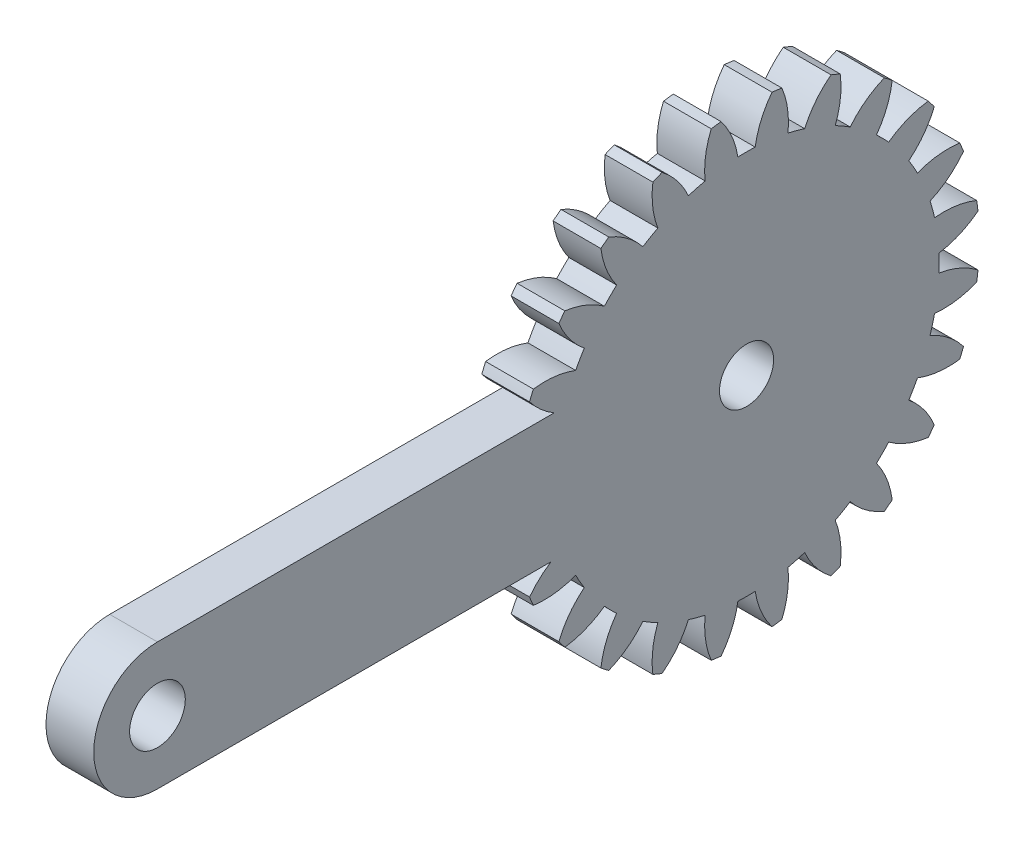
ISO-10303-21;
HEADER;
FILE_DESCRIPTION(('STEP AP214'),'2;1');
FILE_NAME('part.step','',(''),(''),'','','');
FILE_SCHEMA(('AUTOMOTIVE_DESIGN { 1 0 10303 214 1 1 1 1 }'));
ENDSEC;
DATA;
#1=APPLICATION_CONTEXT('core data for automotive mechanical design processes');
#2=APPLICATION_PROTOCOL_DEFINITION('international standard','automotive_design',2000,#1);
#3=PRODUCT_CONTEXT('',#1,'mechanical');
#4=PRODUCT('Part','Part','',(#3));
#5=PRODUCT_RELATED_PRODUCT_CATEGORY('part','',(#4));
#6=PRODUCT_DEFINITION_FORMATION('','',#4);
#7=PRODUCT_DEFINITION_CONTEXT('part definition',#1,'design');
#8=PRODUCT_DEFINITION('design','',#6,#7);
#9=PRODUCT_DEFINITION_SHAPE('','',#8);
#10=(LENGTH_UNIT() NAMED_UNIT(*) SI_UNIT(.MILLI.,.METRE.));
#11=(NAMED_UNIT(*) PLANE_ANGLE_UNIT() SI_UNIT($,.RADIAN.));
#12=(NAMED_UNIT(*) SI_UNIT($,.STERADIAN.) SOLID_ANGLE_UNIT());
#13=UNCERTAINTY_MEASURE_WITH_UNIT(LENGTH_MEASURE(1.E-05),#10,'distance_accuracy_value','');
#14=(GEOMETRIC_REPRESENTATION_CONTEXT(3) GLOBAL_UNCERTAINTY_ASSIGNED_CONTEXT((#13)) GLOBAL_UNIT_ASSIGNED_CONTEXT((#10,
#11,#12)) REPRESENTATION_CONTEXT('',''));
#15=CARTESIAN_POINT('',(0.,0.,0.));
#16=DIRECTION('',(0.,0.,1.));
#17=DIRECTION('',(1.,0.,0.));
#18=AXIS2_PLACEMENT_3D('',#15,#16,#17);
#19=CARTESIAN_POINT('',(-2.20152265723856,0.0638042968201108,0.));
#20=DIRECTION('',(-1.,0.,0.));
#21=DIRECTION('',(0.,0.,1.));
#22=AXIS2_PLACEMENT_3D('',#19,#20,#21);
#23=PLANE('',#22);
#24=CARTESIAN_POINT('',(-2.20152265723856,0.,0.));
#25=DIRECTION('',(1.,0.,0.));
#26=DIRECTION('',(0.,0.,-1.));
#27=AXIS2_PLACEMENT_3D('',#24,#25,#26);
#28=CIRCLE('',#27,1.7);
#29=CARTESIAN_POINT('',(-2.20152265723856,0.,-1.7));
#30=VERTEX_POINT('',#29);
#31=EDGE_CURVE('E1486',#30,#30,#28,.T.);
#32=ORIENTED_EDGE('',*,*,#31,.F.);
#33=EDGE_LOOP('',(#32));
#34=FACE_BOUND('',#33,.T.);
#35=DIRECTION('',(0.,0.,-1.));
#36=VECTOR('',#35,1.);
#37=CARTESIAN_POINT('',(-2.20152265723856,-4.,0.));
#38=LINE('',#37,#36);
#39=CARTESIAN_POINT('',(-2.20152265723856,-4.,37.));
#40=VERTEX_POINT('',#39);
#41=CARTESIAN_POINT('',(-2.20152265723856,-4.,12.288195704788));
#42=VERTEX_POINT('',#41);
#43=EDGE_CURVE('E605',#40,#42,#38,.T.);
#44=ORIENTED_EDGE('',*,*,#43,.T.);
#45=CARTESIAN_POINT('',(-2.20152265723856,-8.52290396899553,9.33805338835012));
#46=DIRECTION('',(-1.,0.,0.));
#47=DIRECTION('',(0.,0.965925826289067,0.258819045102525));
#48=AXIS2_PLACEMENT_3D('',#45,#46,#47);
#49=CIRCLE('',#48,5.39999999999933);
#50=CARTESIAN_POINT('',(-2.20152265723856,-5.24333558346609,13.6280919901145));
#51=VERTEX_POINT('',#50);
#52=EDGE_CURVE('E60',#51,#42,#49,.T.);
#53=ORIENTED_EDGE('',*,*,#52,.F.);
#54=CARTESIAN_POINT('',(-2.20152265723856,0.0638042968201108,0.));
#55=DIRECTION('',(-1.,0.,0.));
#56=DIRECTION('',(0.,0.,1.));
#57=AXIS2_PLACEMENT_3D('',#54,#55,#56);
#58=CIRCLE('',#57,14.6249999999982);
#59=CARTESIAN_POINT('',(-2.20152265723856,-5.81999736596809,13.3892308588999));
#60=VERTEX_POINT('',#59);
#61=EDGE_CURVE('E1369',#60,#51,#58,.T.);
#62=ORIENTED_EDGE('',*,*,#61,.F.);
#63=CARTESIAN_POINT('',(-2.20152265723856,-0.467476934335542,12.6747205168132));
#64=DIRECTION('',(-1.,0.,0.));
#65=DIRECTION('',(0.,0.866025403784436,0.500000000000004));
#66=AXIS2_PLACEMENT_3D('',#63,#64,#65);
#67=CIRCLE('',#66,5.39999999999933);
#68=CARTESIAN_POINT('',(-2.20152265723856,-5.50646694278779,10.7334375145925));
#69=VERTEX_POINT('',#68);
#70=EDGE_CURVE('E717',#69,#60,#67,.T.);
#71=ORIENTED_EDGE('',*,*,#70,.F.);
#72=CARTESIAN_POINT('',(-2.20152265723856,0.0638042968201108,0.));
#73=DIRECTION('',(-1.,0.,0.));
#74=DIRECTION('',(0.,0.866025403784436,0.500000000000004));
#75=AXIS2_PLACEMENT_3D('',#72,#73,#74);
#76=CIRCLE('',#75,12.0927499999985);
#77=CARTESIAN_POINT('',(-2.20152265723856,-6.446489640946,10.1907151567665));
#78=VERTEX_POINT('',#77);
#79=EDGE_CURVE('E725',#78,#69,#76,.T.);
#80=ORIENTED_EDGE('',*,*,#79,.F.);
#81=CARTESIAN_POINT('',(-2.20152265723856,-10.6471850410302,6.79746330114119));
#82=DIRECTION('',(-1.,0.,0.));
#83=DIRECTION('',(0.,0.866025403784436,0.500000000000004));
#84=AXIS2_PLACEMENT_3D('',#81,#82,#83);
#85=CIRCLE('',#84,5.39999999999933);
#86=CARTESIAN_POINT('',(-2.20152265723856,-8.58970893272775,11.7901371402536));
#87=VERTEX_POINT('',#86);
#88=EDGE_CURVE('E720',#87,#78,#85,.T.);
#89=ORIENTED_EDGE('',*,*,#88,.F.);
#90=CARTESIAN_POINT('',(-2.20152265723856,-9.08489963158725,11.4101639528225));
#91=VERTEX_POINT('',#90);
#92=EDGE_CURVE('E1218',#91,#87,#58,.T.);
#93=ORIENTED_EDGE('',*,*,#92,.F.);
#94=CARTESIAN_POINT('',(-2.20152265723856,-3.72983302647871,12.1053341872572));
#95=DIRECTION('',(-1.,0.,0.));
#96=DIRECTION('',(0.,0.707106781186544,0.707106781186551));
#97=AXIS2_PLACEMENT_3D('',#94,#95,#96);
#98=CIRCLE('',#97,5.39999999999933);
#99=CARTESIAN_POINT('',(-2.20152265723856,-8.09468260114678,8.92601221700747));
#100=VERTEX_POINT('',#99);
#101=EDGE_CURVE('E689',#100,#91,#98,.T.);
#102=ORIENTED_EDGE('',*,*,#101,.F.);
#103=CARTESIAN_POINT('',(-2.20152265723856,0.0638042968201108,0.));
#104=DIRECTION('',(-1.,0.,0.));
#105=DIRECTION('',(0.,0.707106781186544,0.707106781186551));
#106=AXIS2_PLACEMENT_3D('',#103,#104,#105);
#107=CIRCLE('',#106,12.0927499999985);
#108=CARTESIAN_POINT('',(-2.20152265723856,-8.86220792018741,8.15848689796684));
#109=VERTEX_POINT('',#108);
#110=EDGE_CURVE('E702',#109,#100,#107,.T.);
#111=ORIENTED_EDGE('',*,*,#110,.F.);
#112=CARTESIAN_POINT('',(-2.20152265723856,-12.0415298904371,3.79363732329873));
#113=DIRECTION('',(-1.,0.,0.));
#114=DIRECTION('',(0.,0.707106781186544,0.707106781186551));
#115=AXIS2_PLACEMENT_3D('',#112,#113,#114);
#116=CIRCLE('',#115,5.39999999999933);
#117=CARTESIAN_POINT('',(-2.20152265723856,-11.3463596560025,9.14870392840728));
#118=VERTEX_POINT('',#117);
#119=EDGE_CURVE('E692',#118,#109,#116,.T.);
#120=ORIENTED_EDGE('',*,*,#119,.F.);
#121=CARTESIAN_POINT('',(-2.20152265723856,-11.7263328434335,8.65351322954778));
#122=VERTEX_POINT('',#121);
#123=EDGE_CURVE('E1362',#122,#118,#58,.T.);
#124=ORIENTED_EDGE('',*,*,#123,.F.);
#125=CARTESIAN_POINT('',(-2.20152265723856,-6.73365900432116,10.7109893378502));
#126=DIRECTION('',(-1.,0.,0.));
#127=DIRECTION('',(0.,0.499999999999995,0.866025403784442));
#128=AXIS2_PLACEMENT_3D('',#125,#126,#127);
#129=CIRCLE('',#128,5.39999999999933);
#130=CARTESIAN_POINT('',(-2.20152265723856,-10.1269108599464,6.51029393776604));
#131=VERTEX_POINT('',#130);
#132=EDGE_CURVE('E1024',#131,#122,#129,.T.);
#133=ORIENTED_EDGE('',*,*,#132,.F.);
#134=CARTESIAN_POINT('',(-2.20152265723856,0.0638042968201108,0.));
#135=DIRECTION('',(-1.,0.,0.));
#136=DIRECTION('',(0.,0.499999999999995,0.866025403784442));
#137=AXIS2_PLACEMENT_3D('',#134,#135,#136);
#138=CIRCLE('',#137,12.0927499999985);
#139=CARTESIAN_POINT('',(-2.20152265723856,-10.6696332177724,5.57027123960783));
#140=VERTEX_POINT('',#139);
#141=EDGE_CURVE('E1032',#140,#131,#138,.T.);
#142=ORIENTED_EDGE('',*,*,#141,.F.);
#143=CARTESIAN_POINT('',(-2.20152265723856,-12.6109162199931,0.531281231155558));
#144=DIRECTION('',(-1.,0.,0.));
#145=DIRECTION('',(0.,0.499999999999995,0.866025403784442));
#146=AXIS2_PLACEMENT_3D('',#143,#144,#145);
#147=CIRCLE('',#146,5.39999999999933);
#148=CARTESIAN_POINT('',(-2.20152265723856,-13.3254265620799,5.88380166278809));
#149=VERTEX_POINT('',#148);
#150=EDGE_CURVE('E1027',#149,#140,#147,.T.);
#151=ORIENTED_EDGE('',*,*,#150,.F.);
#152=CARTESIAN_POINT('',(-2.20152265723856,-13.5642876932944,5.3071398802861));
#153=VERTEX_POINT('',#152);
#154=EDGE_CURVE('E1366',#153,#149,#58,.T.);
#155=ORIENTED_EDGE('',*,*,#154,.F.);
#156=CARTESIAN_POINT('',(-2.20152265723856,-9.27424909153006,8.58670826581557));
#157=DIRECTION('',(-1.,0.,0.));
#158=DIRECTION('',(0.,0.258819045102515,0.96592582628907));
#159=AXIS2_PLACEMENT_3D('',#156,#157,#158);
#160=CIRCLE('',#159,5.39999999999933);
#161=CARTESIAN_POINT('',(-2.20152265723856,-11.4646587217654,3.65090988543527));
#162=VERTEX_POINT('',#161);
#163=EDGE_CURVE('E1045',#162,#153,#160,.T.);
#164=ORIENTED_EDGE('',*,*,#163,.F.);
#165=CARTESIAN_POINT('',(-2.20152265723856,0.0638042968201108,0.));
#166=DIRECTION('',(-1.,0.,0.));
#167=DIRECTION('',(0.,0.258819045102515,0.96592582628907));
#168=AXIS2_PLACEMENT_3D('',#165,#166,#167);
#169=CIRCLE('',#168,12.0927499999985);
#170=CARTESIAN_POINT('',(-2.20152265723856,-11.7455924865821,2.60245080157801));
#171=VERTEX_POINT('',#170);
#172=EDGE_CURVE('E1053',#171,#162,#169,.T.);
#173=ORIENTED_EDGE('',*,*,#172,.F.);
#174=CARTESIAN_POINT('',(-2.20152265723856,-12.3165412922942,-2.76728079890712));
#175=DIRECTION('',(-1.,0.,0.));
#176=DIRECTION('',(0.,0.258819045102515,0.96592582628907));
#177=AXIS2_PLACEMENT_3D('',#174,#175,#176);
#178=CIRCLE('',#177,5.39999999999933);
#179=CARTESIAN_POINT('',(-2.20152265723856,-14.3920395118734,2.21792803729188));
#180=VERTEX_POINT('',#179);
#181=EDGE_CURVE('E1048',#180,#171,#178,.T.);
#182=ORIENTED_EDGE('',*,*,#181,.F.);
#183=CARTESIAN_POINT('',(-2.20152265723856,-14.4735105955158,1.59909371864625));
#184=VERTEX_POINT('',#183);
#185=EDGE_CURVE('E1368',#184,#180,#58,.T.);
#186=ORIENTED_EDGE('',*,*,#185,.F.);
#187=CARTESIAN_POINT('',(-2.20152265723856,-11.1784662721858,5.87725721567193));
#188=DIRECTION('',(-1.,0.,0.));
#189=DIRECTION('',(0.,0.,1.));
#190=AXIS2_PLACEMENT_3D('',#187,#188,#189);
#191=CIRCLE('',#190,5.39999999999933);
#192=CARTESIAN_POINT('',(-2.20152265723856,-12.0167608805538,0.542722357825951));
#193=VERTEX_POINT('',#192);
#194=EDGE_CURVE('E1065',#193,#184,#191,.T.);
#195=ORIENTED_EDGE('',*,*,#194,.F.);
#196=CARTESIAN_POINT('',(-2.20152265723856,0.0638042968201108,0.));
#197=DIRECTION('',(-1.,0.,0.));
#198=DIRECTION('',(0.,0.,1.));
#199=AXIS2_PLACEMENT_3D('',#196,#197,#198);
#200=CIRCLE('',#199,12.0927499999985);
#201=CARTESIAN_POINT('',(-2.20152265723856,-12.0167608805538,-0.542722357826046));
#202=VERTEX_POINT('',#201);
#203=EDGE_CURVE('E1073',#202,#193,#200,.T.);
#204=ORIENTED_EDGE('',*,*,#203,.F.);
#205=CARTESIAN_POINT('',(-2.20152265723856,-11.1784662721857,-5.87725721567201));
#206=DIRECTION('',(-1.,0.,0.));
#207=DIRECTION('',(0.,0.,1.));
#208=AXIS2_PLACEMENT_3D('',#205,#206,#207);
#209=CIRCLE('',#208,5.39999999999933);
#210=CARTESIAN_POINT('',(-2.20152265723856,-14.4735105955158,-1.59909371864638));
#211=VERTEX_POINT('',#210);
#212=EDGE_CURVE('E1068',#211,#202,#209,.T.);
#213=ORIENTED_EDGE('',*,*,#212,.F.);
#214=CARTESIAN_POINT('',(-2.20152265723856,-14.3920395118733,-2.21792803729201));
#215=VERTEX_POINT('',#214);
#216=EDGE_CURVE('E1794',#215,#211,#58,.T.);
#217=ORIENTED_EDGE('',*,*,#216,.F.);
#218=CARTESIAN_POINT('',(-2.20152265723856,-12.3165412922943,2.76728079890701));
#219=DIRECTION('',(-1.,0.,0.));
#220=DIRECTION('',(0.,-0.258819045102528,0.965925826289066));
#221=AXIS2_PLACEMENT_3D('',#218,#219,#220);
#222=CIRCLE('',#221,5.39999999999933);
#223=CARTESIAN_POINT('',(-2.20152265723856,-11.745592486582,-2.6024508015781));
#224=VERTEX_POINT('',#223);
#225=EDGE_CURVE('E812',#224,#215,#222,.T.);
#226=ORIENTED_EDGE('',*,*,#225,.F.);
#227=CARTESIAN_POINT('',(-2.20152265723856,0.0638042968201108,0.));
#228=DIRECTION('',(-1.,0.,0.));
#229=DIRECTION('',(0.,-0.258819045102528,0.965925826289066));
#230=AXIS2_PLACEMENT_3D('',#227,#228,#229);
#231=CIRCLE('',#230,12.0927499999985);
#232=CARTESIAN_POINT('',(-2.20152265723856,-11.4646587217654,-3.65090988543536));
#233=VERTEX_POINT('',#232);
#234=EDGE_CURVE('E825',#233,#224,#231,.T.);
#235=ORIENTED_EDGE('',*,*,#234,.F.);
#236=CARTESIAN_POINT('',(-2.20152265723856,-9.27424909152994,-8.58670826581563));
#237=DIRECTION('',(-1.,0.,0.));
#238=DIRECTION('',(0.,-0.258819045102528,0.965925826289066));
#239=AXIS2_PLACEMENT_3D('',#236,#237,#238);
#240=CIRCLE('',#239,5.39999999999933);
#241=CARTESIAN_POINT('',(-2.20152265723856,-13.5642876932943,-5.30713988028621));
#242=VERTEX_POINT('',#241);
#243=EDGE_CURVE('E815',#242,#233,#240,.T.);
#244=ORIENTED_EDGE('',*,*,#243,.F.);
#245=CARTESIAN_POINT('',(-2.20152265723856,-13.3254265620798,-5.88380166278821));
#246=VERTEX_POINT('',#245);
#247=EDGE_CURVE('E1788',#246,#242,#58,.T.);
#248=ORIENTED_EDGE('',*,*,#247,.F.);
#249=CARTESIAN_POINT('',(-2.20152265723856,-12.6109162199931,-0.531281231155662));
#250=DIRECTION('',(-1.,0.,0.));
#251=DIRECTION('',(0.,-0.500000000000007,0.866025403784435));
#252=AXIS2_PLACEMENT_3D('',#249,#250,#251);
#253=CIRCLE('',#252,5.39999999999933);
#254=CARTESIAN_POINT('',(-2.20152265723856,-10.6696332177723,-5.57027123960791));
#255=VERTEX_POINT('',#254);
#256=EDGE_CURVE('E840',#255,#246,#253,.T.);
#257=ORIENTED_EDGE('',*,*,#256,.F.);
#258=CARTESIAN_POINT('',(-2.20152265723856,0.0638042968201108,0.));
#259=DIRECTION('',(-1.,0.,0.));
#260=DIRECTION('',(0.,-0.500000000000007,0.866025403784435));
#261=AXIS2_PLACEMENT_3D('',#258,#259,#260);
#262=CIRCLE('',#261,12.0927499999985);
#263=CARTESIAN_POINT('',(-2.20152265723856,-10.1269108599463,-6.51029393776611));
#264=VERTEX_POINT('',#263);
#265=EDGE_CURVE('E849',#264,#255,#262,.T.);
#266=ORIENTED_EDGE('',*,*,#265,.F.);
#267=CARTESIAN_POINT('',(-2.20152265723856,-6.73365900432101,-10.7109893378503));
#268=DIRECTION('',(-1.,0.,0.));
#269=DIRECTION('',(0.,-0.500000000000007,0.866025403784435));
#270=AXIS2_PLACEMENT_3D('',#267,#268,#269);
#271=CIRCLE('',#270,5.39999999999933);
#272=CARTESIAN_POINT('',(-2.20152265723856,-11.7263328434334,-8.65351322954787));
#273=VERTEX_POINT('',#272);
#274=EDGE_CURVE('E843',#273,#264,#271,.T.);
#275=ORIENTED_EDGE('',*,*,#274,.F.);
#276=CARTESIAN_POINT('',(-2.20152265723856,-11.3463596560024,-9.14870392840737));
#277=VERTEX_POINT('',#276);
#278=EDGE_CURVE('E1782',#277,#273,#58,.T.);
#279=ORIENTED_EDGE('',*,*,#278,.F.);
#280=CARTESIAN_POINT('',(-2.20152265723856,-12.041529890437,-3.79363732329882));
#281=DIRECTION('',(-1.,0.,0.));
#282=DIRECTION('',(0.,-0.707106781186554,0.707106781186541));
#283=AXIS2_PLACEMENT_3D('',#280,#281,#282);
#284=CIRCLE('',#283,5.39999999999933);
#285=CARTESIAN_POINT('',(-2.20152265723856,-8.8622079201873,-8.15848689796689));
#286=VERTEX_POINT('',#285);
#287=EDGE_CURVE('E788',#286,#277,#284,.T.);
#288=ORIENTED_EDGE('',*,*,#287,.F.);
#289=CARTESIAN_POINT('',(-2.20152265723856,0.0638042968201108,0.));
#290=DIRECTION('',(-1.,0.,0.));
#291=DIRECTION('',(0.,-0.707106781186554,0.707106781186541));
#292=AXIS2_PLACEMENT_3D('',#289,#290,#291);
#293=CIRCLE('',#292,12.0927499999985);
#294=CARTESIAN_POINT('',(-2.20152265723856,-8.09468260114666,-8.92601221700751));
#295=VERTEX_POINT('',#294);
#296=EDGE_CURVE('E799',#295,#286,#293,.T.);
#297=ORIENTED_EDGE('',*,*,#296,.F.);
#298=CARTESIAN_POINT('',(-2.20152265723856,-3.72983302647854,-12.1053341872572));
#299=DIRECTION('',(-1.,0.,0.));
#300=DIRECTION('',(0.,-0.707106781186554,0.707106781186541));
#301=AXIS2_PLACEMENT_3D('',#298,#299,#300);
#302=CIRCLE('',#301,5.39999999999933);
#303=CARTESIAN_POINT('',(-2.20152265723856,-9.0848996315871,-11.4101639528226));
#304=VERTEX_POINT('',#303);
#305=EDGE_CURVE('E791',#304,#295,#302,.T.);
#306=ORIENTED_EDGE('',*,*,#305,.F.);
#307=CARTESIAN_POINT('',(-2.20152265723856,-8.58970893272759,-11.7901371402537));
#308=VERTEX_POINT('',#307);
#309=EDGE_CURVE('E1776',#308,#304,#58,.T.);
#310=ORIENTED_EDGE('',*,*,#309,.F.);
#311=CARTESIAN_POINT('',(-2.20152265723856,-10.6471850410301,-6.79746330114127));
#312=DIRECTION('',(-1.,0.,0.));
#313=DIRECTION('',(0.,-0.866025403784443,0.499999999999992));
#314=AXIS2_PLACEMENT_3D('',#311,#312,#313);
#315=CIRCLE('',#314,5.39999999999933);
#316=CARTESIAN_POINT('',(-2.20152265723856,-6.44648964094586,-10.1907151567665));
#317=VERTEX_POINT('',#316);
#318=EDGE_CURVE('E736',#317,#308,#315,.T.);
#319=ORIENTED_EDGE('',*,*,#318,.F.);
#320=CARTESIAN_POINT('',(-2.20152265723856,0.0638042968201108,0.));
#321=DIRECTION('',(-1.,0.,0.));
#322=DIRECTION('',(0.,-0.866025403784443,0.499999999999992));
#323=AXIS2_PLACEMENT_3D('',#320,#321,#322);
#324=CIRCLE('',#323,12.0927499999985);
#325=CARTESIAN_POINT('',(-2.20152265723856,-5.50646694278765,-10.7334375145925));
#326=VERTEX_POINT('',#325);
#327=EDGE_CURVE('E749',#326,#317,#324,.T.);
#328=ORIENTED_EDGE('',*,*,#327,.F.);
#329=CARTESIAN_POINT('',(-2.20152265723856,-0.467476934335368,-12.6747205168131));
#330=DIRECTION('',(-1.,0.,0.));
#331=DIRECTION('',(0.,-0.866025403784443,0.499999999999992));
#332=AXIS2_PLACEMENT_3D('',#329,#330,#331);
#333=CIRCLE('',#332,5.39999999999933);
#334=CARTESIAN_POINT('',(-2.20152265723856,-5.8199973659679,-13.3892308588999));
#335=VERTEX_POINT('',#334);
#336=EDGE_CURVE('E739',#335,#326,#333,.T.);
#337=ORIENTED_EDGE('',*,*,#336,.F.);
#338=CARTESIAN_POINT('',(-2.20152265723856,-5.2433355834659,-13.6280919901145));
#339=VERTEX_POINT('',#338);
#340=EDGE_CURVE('E1770',#339,#335,#58,.T.);
#341=ORIENTED_EDGE('',*,*,#340,.F.);
#342=CARTESIAN_POINT('',(-2.20152265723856,-8.5229039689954,-9.33805338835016));
#343=DIRECTION('',(-1.,0.,0.));
#344=DIRECTION('',(0.,-0.965925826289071,0.258819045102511));
#345=AXIS2_PLACEMENT_3D('',#342,#343,#344);
#346=CIRCLE('',#345,5.39999999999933);
#347=CARTESIAN_POINT('',(-2.20152265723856,-3.58710558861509,-11.5284630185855));
#348=VERTEX_POINT('',#347);
#349=EDGE_CURVE('E764',#348,#339,#346,.T.);
#350=ORIENTED_EDGE('',*,*,#349,.F.);
#351=CARTESIAN_POINT('',(-2.20152265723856,0.0638042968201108,0.));
#352=DIRECTION('',(-1.,0.,0.));
#353=DIRECTION('',(0.,-0.965925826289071,0.258819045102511));
#354=AXIS2_PLACEMENT_3D('',#351,#352,#353);
#355=CIRCLE('',#354,12.0927499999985);
#356=CARTESIAN_POINT('',(-2.20152265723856,-2.53864650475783,-11.8093967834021));
#357=VERTEX_POINT('',#356);
#358=EDGE_CURVE('E775',#357,#348,#355,.T.);
#359=ORIENTED_EDGE('',*,*,#358,.F.);
#360=CARTESIAN_POINT('',(-2.20152265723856,2.8310850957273,-12.3803455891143));
#361=DIRECTION('',(-1.,0.,0.));
#362=DIRECTION('',(0.,-0.965925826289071,0.258819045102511));
#363=AXIS2_PLACEMENT_3D('',#360,#361,#362);
#364=CIRCLE('',#363,5.39999999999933);
#365=CARTESIAN_POINT('',(-2.20152265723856,-2.15412374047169,-14.4558438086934));
#366=VERTEX_POINT('',#365);
#367=EDGE_CURVE('E767',#366,#357,#364,.T.);
#368=ORIENTED_EDGE('',*,*,#367,.F.);
#369=CARTESIAN_POINT('',(-2.20152265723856,-1.53528942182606,-14.5373148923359));
#370=VERTEX_POINT('',#369);
#371=EDGE_CURVE('E1766',#370,#366,#58,.T.);
#372=ORIENTED_EDGE('',*,*,#371,.F.);
#373=CARTESIAN_POINT('',(-2.20152265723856,-5.81345291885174,-11.2422705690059));
#374=DIRECTION('',(-1.,0.,0.));
#375=DIRECTION('',(0.,-1.,0.));
#376=AXIS2_PLACEMENT_3D('',#373,#374,#375);
#377=CIRCLE('',#376,5.39999999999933);
#378=CARTESIAN_POINT('',(-2.20152265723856,-0.478918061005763,-12.0805651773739));
#379=VERTEX_POINT('',#378);
#380=EDGE_CURVE('E2647',#379,#370,#377,.T.);
#381=ORIENTED_EDGE('',*,*,#380,.F.);
#382=CARTESIAN_POINT('',(-2.20152265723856,0.0638042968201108,0.));
#383=DIRECTION('',(-1.,0.,0.));
#384=DIRECTION('',(0.,-1.,0.));
#385=AXIS2_PLACEMENT_3D('',#382,#383,#384);
#386=CIRCLE('',#385,12.0927499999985);
#387=CARTESIAN_POINT('',(-2.20152265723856,0.606526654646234,-12.0805651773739));
#388=VERTEX_POINT('',#387);
#389=EDGE_CURVE('E2648',#388,#379,#386,.T.);
#390=ORIENTED_EDGE('',*,*,#389,.F.);
#391=CARTESIAN_POINT('',(-2.20152265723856,5.9410615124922,-11.2422705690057));
#392=DIRECTION('',(-1.,0.,0.));
#393=DIRECTION('',(0.,-1.,0.));
#394=AXIS2_PLACEMENT_3D('',#391,#392,#393);
#395=CIRCLE('',#394,5.39999999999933);
#396=CARTESIAN_POINT('',(-2.20152265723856,1.66289801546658,-14.5373148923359));
#397=VERTEX_POINT('',#396);
#398=EDGE_CURVE('E1764',#397,#388,#395,.T.);
#399=ORIENTED_EDGE('',*,*,#398,.F.);
#400=CARTESIAN_POINT('',(-2.20152265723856,2.28173233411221,-14.4558438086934));
#401=VERTEX_POINT('',#400);
#402=EDGE_CURVE('E1756',#401,#397,#58,.T.);
#403=ORIENTED_EDGE('',*,*,#402,.F.);
#404=CARTESIAN_POINT('',(-2.20152265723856,-2.70347650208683,-12.3803455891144));
#405=DIRECTION('',(-1.,0.,0.));
#406=DIRECTION('',(0.,-0.965925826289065,-0.258819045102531));
#407=AXIS2_PLACEMENT_3D('',#404,#405,#406);
#408=CIRCLE('',#407,5.39999999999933);
#409=CARTESIAN_POINT('',(-2.20152265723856,2.66625509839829,-11.8093967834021));
#410=VERTEX_POINT('',#409);
#411=EDGE_CURVE('E1762',#410,#401,#408,.T.);
#412=ORIENTED_EDGE('',*,*,#411,.F.);
#413=CARTESIAN_POINT('',(-2.20152265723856,0.0638042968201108,0.));
#414=DIRECTION('',(-1.,0.,0.));
#415=DIRECTION('',(0.,-0.965925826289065,-0.258819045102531));
#416=AXIS2_PLACEMENT_3D('',#413,#414,#415);
#417=CIRCLE('',#416,12.0927499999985);
#418=CARTESIAN_POINT('',(-2.20152265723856,3.71471418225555,-11.5284630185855));
#419=VERTEX_POINT('',#418);
#420=EDGE_CURVE('E2679',#419,#410,#417,.T.);
#421=ORIENTED_EDGE('',*,*,#420,.F.);
#422=CARTESIAN_POINT('',(-2.20152265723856,8.65051256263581,-9.33805338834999));
#423=DIRECTION('',(-1.,0.,0.));
#424=DIRECTION('',(0.,-0.965925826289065,-0.258819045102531));
#425=AXIS2_PLACEMENT_3D('',#422,#423,#424);
#426=CIRCLE('',#425,5.39999999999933);
#427=CARTESIAN_POINT('',(-2.20152265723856,5.37094417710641,-13.6280919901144));
#428=VERTEX_POINT('',#427);
#429=EDGE_CURVE('E2674',#428,#419,#426,.T.);
#430=ORIENTED_EDGE('',*,*,#429,.F.);
#431=CARTESIAN_POINT('',(-2.20152265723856,5.9476059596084,-13.3892308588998));
#432=VERTEX_POINT('',#431);
#433=EDGE_CURVE('E1765',#432,#428,#58,.T.);
#434=ORIENTED_EDGE('',*,*,#433,.F.);
#435=CARTESIAN_POINT('',(-2.20152265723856,0.595085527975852,-12.6747205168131));
#436=DIRECTION('',(-1.,0.,0.));
#437=DIRECTION('',(0.,-0.866025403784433,-0.50000000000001));
#438=AXIS2_PLACEMENT_3D('',#435,#436,#437);
#439=CIRCLE('',#438,5.39999999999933);
#440=CARTESIAN_POINT('',(-2.20152265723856,5.63407553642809,-10.7334375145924));
#441=VERTEX_POINT('',#440);
#442=EDGE_CURVE('E2691',#441,#432,#439,.T.);
#443=ORIENTED_EDGE('',*,*,#442,.F.);
#444=CARTESIAN_POINT('',(-2.20152265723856,0.0638042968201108,0.));
#445=DIRECTION('',(-1.,0.,0.));
#446=DIRECTION('',(0.,-0.866025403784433,-0.50000000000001));
#447=AXIS2_PLACEMENT_3D('',#444,#445,#446);
#448=CIRCLE('',#447,12.0927499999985);
#449=CARTESIAN_POINT('',(-2.20152265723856,6.57409823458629,-10.1907151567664));
#450=VERTEX_POINT('',#449);
#451=EDGE_CURVE('E2697',#450,#441,#448,.T.);
#452=ORIENTED_EDGE('',*,*,#451,.F.);
#453=CARTESIAN_POINT('',(-2.20152265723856,10.7747936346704,-6.79746330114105));
#454=DIRECTION('',(-1.,0.,0.));
#455=DIRECTION('',(0.,-0.866025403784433,-0.50000000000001));
#456=AXIS2_PLACEMENT_3D('',#453,#454,#455);
#457=CIRCLE('',#456,5.39999999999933);
#458=CARTESIAN_POINT('',(-2.20152265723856,8.71731752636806,-11.7901371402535));
#459=VERTEX_POINT('',#458);
#460=EDGE_CURVE('E2693',#459,#450,#457,.T.);
#461=ORIENTED_EDGE('',*,*,#460,.F.);
#462=CARTESIAN_POINT('',(-2.20152265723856,9.21250822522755,-11.4101639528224));
#463=VERTEX_POINT('',#462);
#464=EDGE_CURVE('E1768',#463,#459,#58,.T.);
#465=ORIENTED_EDGE('',*,*,#464,.F.);
#466=CARTESIAN_POINT('',(-2.20152265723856,3.85744162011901,-12.1053341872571));
#467=DIRECTION('',(-1.,0.,0.));
#468=DIRECTION('',(0.,-0.707106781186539,-0.707106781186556));
#469=AXIS2_PLACEMENT_3D('',#466,#467,#468);
#470=CIRCLE('',#469,5.39999999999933);
#471=CARTESIAN_POINT('',(-2.20152265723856,8.22229119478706,-8.92601221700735));
#472=VERTEX_POINT('',#471);
#473=EDGE_CURVE('E910',#472,#463,#470,.T.);
#474=ORIENTED_EDGE('',*,*,#473,.F.);
#475=CARTESIAN_POINT('',(-2.20152265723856,0.0638042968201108,0.));
#476=DIRECTION('',(-1.,0.,0.));
#477=DIRECTION('',(0.,-0.707106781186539,-0.707106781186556));
#478=AXIS2_PLACEMENT_3D('',#475,#476,#477);
#479=CIRCLE('',#478,12.0927499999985);
#480=CARTESIAN_POINT('',(-2.20152265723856,8.98981651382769,-8.1584868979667));
#481=VERTEX_POINT('',#480);
#482=EDGE_CURVE('E2738',#481,#472,#479,.T.);
#483=ORIENTED_EDGE('',*,*,#482,.F.);
#484=CARTESIAN_POINT('',(-2.20152265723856,12.1691384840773,-3.79363732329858));
#485=DIRECTION('',(-1.,0.,0.));
#486=DIRECTION('',(0.,-0.707106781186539,-0.707106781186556));
#487=AXIS2_PLACEMENT_3D('',#484,#485,#486);
#488=CIRCLE('',#487,5.39999999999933);
#489=CARTESIAN_POINT('',(-2.20152265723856,11.4739682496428,-9.14870392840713));
#490=VERTEX_POINT('',#489);
#491=EDGE_CURVE('E913',#490,#481,#488,.T.);
#492=ORIENTED_EDGE('',*,*,#491,.F.);
#493=CARTESIAN_POINT('',(-2.20152265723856,11.8539414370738,-8.65351322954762));
#494=VERTEX_POINT('',#493);
#495=EDGE_CURVE('E2718',#494,#490,#58,.T.);
#496=ORIENTED_EDGE('',*,*,#495,.F.);
#497=CARTESIAN_POINT('',(-2.20152265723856,6.86126759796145,-10.7109893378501));
#498=DIRECTION('',(-1.,0.,0.));
#499=DIRECTION('',(0.,-0.499999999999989,-0.866025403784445));
#500=AXIS2_PLACEMENT_3D('',#497,#498,#499);
#501=CIRCLE('',#500,5.39999999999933);
#502=CARTESIAN_POINT('',(-2.20152265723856,10.2545194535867,-6.5102939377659));
#503=VERTEX_POINT('',#502);
#504=EDGE_CURVE('E860',#503,#494,#501,.T.);
#505=ORIENTED_EDGE('',*,*,#504,.F.);
#506=CARTESIAN_POINT('',(-2.20152265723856,0.0638042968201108,0.));
#507=DIRECTION('',(-1.,0.,0.));
#508=DIRECTION('',(0.,-0.499999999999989,-0.866025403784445));
#509=AXIS2_PLACEMENT_3D('',#506,#507,#508);
#510=CIRCLE('',#509,12.0927499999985);
#511=CARTESIAN_POINT('',(-2.20152265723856,10.7972418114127,-5.57027123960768));
#512=VERTEX_POINT('',#511);
#513=EDGE_CURVE('E873',#512,#503,#510,.T.);
#514=ORIENTED_EDGE('',*,*,#513,.F.);
#515=CARTESIAN_POINT('',(-2.20152265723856,12.7385248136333,-0.531281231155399));
#516=DIRECTION('',(-1.,0.,0.));
#517=DIRECTION('',(0.,-0.499999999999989,-0.866025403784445));
#518=AXIS2_PLACEMENT_3D('',#515,#516,#517);
#519=CIRCLE('',#518,5.39999999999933);
#520=CARTESIAN_POINT('',(-2.20152265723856,13.4530351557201,-5.88380166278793));
#521=VERTEX_POINT('',#520);
#522=EDGE_CURVE('E863',#521,#512,#519,.T.);
#523=ORIENTED_EDGE('',*,*,#522,.F.);
#524=CARTESIAN_POINT('',(-2.20152265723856,13.6918962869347,-5.30713988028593));
#525=VERTEX_POINT('',#524);
#526=EDGE_CURVE('E928',#525,#521,#58,.T.);
#527=ORIENTED_EDGE('',*,*,#526,.F.);
#528=CARTESIAN_POINT('',(-2.20152265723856,9.40185768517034,-8.58670826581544));
#529=DIRECTION('',(-1.,0.,0.));
#530=DIRECTION('',(0.,-0.258819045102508,-0.965925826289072));
#531=AXIS2_PLACEMENT_3D('',#528,#529,#530);
#532=CIRCLE('',#531,5.39999999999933);
#533=CARTESIAN_POINT('',(-2.20152265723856,11.5922673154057,-3.65090988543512));
#534=VERTEX_POINT('',#533);
#535=EDGE_CURVE('E888',#534,#525,#532,.T.);
#536=ORIENTED_EDGE('',*,*,#535,.F.);
#537=CARTESIAN_POINT('',(-2.20152265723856,0.0638042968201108,0.));
#538=DIRECTION('',(-1.,0.,0.));
#539=DIRECTION('',(0.,-0.258819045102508,-0.965925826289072));
#540=AXIS2_PLACEMENT_3D('',#537,#538,#539);
#541=CIRCLE('',#540,12.0927499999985);
#542=CARTESIAN_POINT('',(-2.20152265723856,11.8732010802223,-2.60245080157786));
#543=VERTEX_POINT('',#542);
#544=EDGE_CURVE('E899',#543,#534,#541,.T.);
#545=ORIENTED_EDGE('',*,*,#544,.F.);
#546=CARTESIAN_POINT('',(-2.20152265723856,12.4441498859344,2.76728079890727));
#547=DIRECTION('',(-1.,0.,0.));
#548=DIRECTION('',(0.,-0.258819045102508,-0.965925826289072));
#549=AXIS2_PLACEMENT_3D('',#546,#547,#548);
#550=CIRCLE('',#549,5.39999999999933);
#551=CARTESIAN_POINT('',(-2.20152265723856,14.5196481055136,-2.21792803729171));
#552=VERTEX_POINT('',#551);
#553=EDGE_CURVE('E891',#552,#543,#550,.T.);
#554=ORIENTED_EDGE('',*,*,#553,.F.);
#555=CARTESIAN_POINT('',(-2.20152265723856,14.6011191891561,-1.59909371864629));
#556=VERTEX_POINT('',#555);
#557=EDGE_CURVE('E922',#556,#552,#58,.T.);
#558=ORIENTED_EDGE('',*,*,#557,.F.);
#559=CARTESIAN_POINT('',(-2.20152265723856,11.3060748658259,-5.87725721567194));
#560=DIRECTION('',(-1.,0.,0.));
#561=DIRECTION('',(0.,0.,-1.));
#562=AXIS2_PLACEMENT_3D('',#559,#560,#561);
#563=CIRCLE('',#562,5.39999999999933);
#564=CARTESIAN_POINT('',(-2.20152265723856,12.144369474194,-0.542722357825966));
#565=VERTEX_POINT('',#564);
#566=EDGE_CURVE('E1277',#565,#556,#563,.T.);
#567=ORIENTED_EDGE('',*,*,#566,.F.);
#568=CARTESIAN_POINT('',(-2.20152265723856,0.0638042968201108,0.));
#569=DIRECTION('',(-1.,0.,0.));
#570=DIRECTION('',(0.,0.,-1.));
#571=AXIS2_PLACEMENT_3D('',#568,#569,#570);
#572=CIRCLE('',#571,12.0927499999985);
#573=CARTESIAN_POINT('',(-2.20152265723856,12.144369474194,0.542722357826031));
#574=VERTEX_POINT('',#573);
#575=EDGE_CURVE('E1285',#574,#565,#572,.T.);
#576=ORIENTED_EDGE('',*,*,#575,.F.);
#577=CARTESIAN_POINT('',(-2.20152265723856,11.3060748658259,5.877257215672));
#578=DIRECTION('',(-1.,0.,0.));
#579=DIRECTION('',(0.,0.,-1.));
#580=AXIS2_PLACEMENT_3D('',#577,#578,#579);
#581=CIRCLE('',#580,5.39999999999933);
#582=CARTESIAN_POINT('',(-2.20152265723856,14.6011191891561,1.59909371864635));
#583=VERTEX_POINT('',#582);
#584=EDGE_CURVE('E1280',#583,#574,#581,.T.);
#585=ORIENTED_EDGE('',*,*,#584,.F.);
#586=CARTESIAN_POINT('',(-2.20152265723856,14.5196481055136,2.21792803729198));
#587=VERTEX_POINT('',#586);
#588=EDGE_CURVE('E930',#587,#583,#58,.T.);
#589=ORIENTED_EDGE('',*,*,#588,.F.);
#590=CARTESIAN_POINT('',(-2.20152265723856,12.4441498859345,-2.76728079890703));
#591=DIRECTION('',(-1.,0.,0.));
#592=DIRECTION('',(0.,0.258819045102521,-0.965925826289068));
#593=AXIS2_PLACEMENT_3D('',#590,#591,#592);
#594=CIRCLE('',#593,5.39999999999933);
#595=CARTESIAN_POINT('',(-2.20152265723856,11.8732010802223,2.60245080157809));
#596=VERTEX_POINT('',#595);
#597=EDGE_CURVE('E1251',#596,#587,#594,.T.);
#598=ORIENTED_EDGE('',*,*,#597,.F.);
#599=CARTESIAN_POINT('',(-2.20152265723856,0.0638042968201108,0.));
#600=DIRECTION('',(-1.,0.,0.));
#601=DIRECTION('',(0.,0.258819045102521,-0.965925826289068));
#602=AXIS2_PLACEMENT_3D('',#599,#600,#601);
#603=CIRCLE('',#602,12.0927499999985);
#604=CARTESIAN_POINT('',(-2.20152265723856,11.5922673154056,3.65090988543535));
#605=VERTEX_POINT('',#604);
#606=EDGE_CURVE('E1259',#605,#596,#603,.T.);
#607=ORIENTED_EDGE('',*,*,#606,.F.);
#608=CARTESIAN_POINT('',(-2.20152265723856,9.40185768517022,8.58670826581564));
#609=DIRECTION('',(-1.,0.,0.));
#610=DIRECTION('',(0.,0.258819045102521,-0.965925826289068));
#611=AXIS2_PLACEMENT_3D('',#608,#609,#610);
#612=CIRCLE('',#611,5.39999999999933);
#613=CARTESIAN_POINT('',(-2.20152265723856,13.6918962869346,5.30713988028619));
#614=VERTEX_POINT('',#613);
#615=EDGE_CURVE('E1254',#614,#605,#612,.T.);
#616=ORIENTED_EDGE('',*,*,#615,.F.);
#617=CARTESIAN_POINT('',(-2.20152265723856,13.45303515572,5.88380166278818));
#618=VERTEX_POINT('',#617);
#619=EDGE_CURVE('E929',#618,#614,#58,.T.);
#620=ORIENTED_EDGE('',*,*,#619,.F.);
#621=CARTESIAN_POINT('',(-2.20152265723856,12.7385248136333,0.531281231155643));
#622=DIRECTION('',(-1.,0.,0.));
#623=DIRECTION('',(0.,0.500000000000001,-0.866025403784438));
#624=AXIS2_PLACEMENT_3D('',#621,#622,#623);
#625=CIRCLE('',#624,5.39999999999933);
#626=CARTESIAN_POINT('',(-2.20152265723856,10.7972418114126,5.5702712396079));
#627=VERTEX_POINT('',#626);
#628=EDGE_CURVE('E1005',#627,#618,#625,.T.);
#629=ORIENTED_EDGE('',*,*,#628,.F.);
#630=CARTESIAN_POINT('',(-2.20152265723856,0.0638042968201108,0.));
#631=DIRECTION('',(-1.,0.,0.));
#632=DIRECTION('',(0.,0.500000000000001,-0.866025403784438));
#633=AXIS2_PLACEMENT_3D('',#630,#631,#632);
#634=CIRCLE('',#633,12.0927499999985);
#635=CARTESIAN_POINT('',(-2.20152265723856,10.2545194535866,6.5102939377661));
#636=VERTEX_POINT('',#635);
#637=EDGE_CURVE('E1011',#636,#627,#634,.T.);
#638=ORIENTED_EDGE('',*,*,#637,.F.);
#639=CARTESIAN_POINT('',(-2.20152265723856,6.8612675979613,10.7109893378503));
#640=DIRECTION('',(-1.,0.,0.));
#641=DIRECTION('',(0.,0.500000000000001,-0.866025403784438));
#642=AXIS2_PLACEMENT_3D('',#639,#640,#641);
#643=CIRCLE('',#642,5.39999999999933);
#644=CARTESIAN_POINT('',(-2.20152265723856,11.8539414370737,8.65351322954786));
#645=VERTEX_POINT('',#644);
#646=EDGE_CURVE('E1007',#645,#636,#643,.T.);
#647=ORIENTED_EDGE('',*,*,#646,.F.);
#648=CARTESIAN_POINT('',(-2.20152265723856,11.4739682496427,9.14870392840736));
#649=VERTEX_POINT('',#648);
#650=EDGE_CURVE('E1377',#649,#645,#58,.T.);
#651=ORIENTED_EDGE('',*,*,#650,.F.);
#652=CARTESIAN_POINT('',(-2.20152265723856,12.1691384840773,3.79363732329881));
#653=DIRECTION('',(-1.,0.,0.));
#654=DIRECTION('',(0.,0.707106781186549,-0.707106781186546));
#655=AXIS2_PLACEMENT_3D('',#652,#653,#654);
#656=CIRCLE('',#655,5.39999999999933);
#657=CARTESIAN_POINT('',(-2.20152265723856,8.98981651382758,8.1584868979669));
#658=VERTEX_POINT('',#657);
#659=EDGE_CURVE('E986',#658,#649,#656,.T.);
#660=ORIENTED_EDGE('',*,*,#659,.F.);
#661=CARTESIAN_POINT('',(-2.20152265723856,0.0638042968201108,0.));
#662=DIRECTION('',(-1.,0.,0.));
#663=DIRECTION('',(0.,0.707106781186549,-0.707106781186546));
#664=AXIS2_PLACEMENT_3D('',#661,#662,#663);
#665=CIRCLE('',#664,12.0927499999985);
#666=CARTESIAN_POINT('',(-2.20152265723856,8.22229119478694,8.92601221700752));
#667=VERTEX_POINT('',#666);
#668=EDGE_CURVE('E992',#667,#658,#665,.T.);
#669=ORIENTED_EDGE('',*,*,#668,.F.);
#670=CARTESIAN_POINT('',(-2.20152265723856,3.85744162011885,12.1053341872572));
#671=DIRECTION('',(-1.,0.,0.));
#672=DIRECTION('',(0.,0.707106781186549,-0.707106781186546));
#673=AXIS2_PLACEMENT_3D('',#670,#671,#672);
#674=CIRCLE('',#673,5.39999999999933);
#675=CARTESIAN_POINT('',(-2.20152265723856,9.2125082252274,11.4101639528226));
#676=VERTEX_POINT('',#675);
#677=EDGE_CURVE('E989',#676,#667,#674,.T.);
#678=ORIENTED_EDGE('',*,*,#677,.F.);
#679=CARTESIAN_POINT('',(-2.20152265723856,8.71731752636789,11.7901371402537));
#680=VERTEX_POINT('',#679);
#681=EDGE_CURVE('E1375',#680,#676,#58,.T.);
#682=ORIENTED_EDGE('',*,*,#681,.F.);
#683=CARTESIAN_POINT('',(-2.20152265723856,10.7747936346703,6.79746330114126));
#684=DIRECTION('',(-1.,0.,0.));
#685=DIRECTION('',(0.,0.86602540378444,-0.499999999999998));
#686=AXIS2_PLACEMENT_3D('',#683,#684,#685);
#687=CIRCLE('',#686,5.39999999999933);
#688=CARTESIAN_POINT('',(-2.20152265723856,6.57409823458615,10.1907151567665));
#689=VERTEX_POINT('',#688);
#690=EDGE_CURVE('E631',#689,#680,#687,.T.);
#691=ORIENTED_EDGE('',*,*,#690,.F.);
#692=CARTESIAN_POINT('',(-2.20152265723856,0.0638042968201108,0.));
#693=DIRECTION('',(-1.,0.,0.));
#694=DIRECTION('',(0.,0.86602540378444,-0.499999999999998));
#695=AXIS2_PLACEMENT_3D('',#692,#693,#694);
#696=CIRCLE('',#695,12.0927499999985);
#697=CARTESIAN_POINT('',(-2.20152265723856,5.63407553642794,10.7334375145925));
#698=VERTEX_POINT('',#697);
#699=EDGE_CURVE('E645',#698,#689,#696,.T.);
#700=ORIENTED_EDGE('',*,*,#699,.F.);
#701=CARTESIAN_POINT('',(-2.20152265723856,0.595085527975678,12.6747205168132));
#702=DIRECTION('',(-1.,0.,0.));
#703=DIRECTION('',(0.,0.86602540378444,-0.499999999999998));
#704=AXIS2_PLACEMENT_3D('',#701,#702,#703);
#705=CIRCLE('',#704,5.39999999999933);
#706=CARTESIAN_POINT('',(-2.20152265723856,5.94760595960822,13.3892308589));
#707=VERTEX_POINT('',#706);
#708=EDGE_CURVE('E634',#707,#698,#705,.T.);
#709=ORIENTED_EDGE('',*,*,#708,.F.);
#710=CARTESIAN_POINT('',(-2.20152265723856,5.37094417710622,13.6280919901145));
#711=VERTEX_POINT('',#710);
#712=EDGE_CURVE('E1124',#711,#707,#58,.T.);
#713=ORIENTED_EDGE('',*,*,#712,.F.);
#714=CARTESIAN_POINT('',(-2.20152265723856,8.65051256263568,9.33805338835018));
#715=DIRECTION('',(-1.,0.,0.));
#716=DIRECTION('',(0.,0.965925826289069,-0.258819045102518));
#717=AXIS2_PLACEMENT_3D('',#714,#715,#716);
#718=CIRCLE('',#717,5.39999999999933);
#719=CARTESIAN_POINT('',(-2.20152265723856,4.,12.0826358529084));
#720=VERTEX_POINT('',#719);
#721=EDGE_CURVE('E652',#720,#711,#718,.T.);
#722=ORIENTED_EDGE('',*,*,#721,.F.);
#723=DIRECTION('',(0.,0.,1.));
#724=VECTOR('',#723,1.);
#725=CARTESIAN_POINT('',(-2.20152265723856,4.,0.));
#726=LINE('',#725,#724);
#727=CARTESIAN_POINT('',(-2.20152265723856,4.,37.));
#728=VERTEX_POINT('',#727);
#729=EDGE_CURVE('E623',#720,#728,#726,.T.);
#730=ORIENTED_EDGE('',*,*,#729,.T.);
#731=CARTESIAN_POINT('',(-2.20152265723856,0.,37.));
#732=DIRECTION('',(1.,0.,0.));
#733=DIRECTION('',(0.,0.,-1.));
#734=AXIS2_PLACEMENT_3D('',#731,#732,#733);
#735=CIRCLE('',#734,4.);
#736=EDGE_CURVE('E612',#728,#40,#735,.T.);
#737=ORIENTED_EDGE('',*,*,#736,.T.);
#738=EDGE_LOOP('',(#44,#53,#62,#71,#80,#89,#93,#102,#111,#120,#124,#133,#142,#151,#155,#164,
#173,#182,#186,#195,#204,#213,#217,#226,#235,#244,#248,#257,#266,#275,#279,#288,#297,#306,#310,
#319,#328,#337,#341,#350,#359,#368,#372,#381,#390,#399,#403,#412,#421,#430,#434,#443,#452,#461,
#465,#474,#483,#492,#496,#505,#514,#523,#527,#536,#545,#554,#558,#567,#576,#585,#589,#598,#607,
#616,#620,#629,#638,#647,#651,#660,#669,#678,#682,#691,#700,#709,#713,#722,#730,#737));
#739=FACE_BOUND('',#738,.T.);
#740=CARTESIAN_POINT('',(-2.20152265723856,0.,37.));
#741=DIRECTION('',(1.,0.,0.));
#742=DIRECTION('',(0.,0.,-1.));
#743=AXIS2_PLACEMENT_3D('',#740,#741,#742);
#744=CIRCLE('',#743,1.75);
#745=CARTESIAN_POINT('',(-2.20152265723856,0.,35.25));
#746=VERTEX_POINT('',#745);
#747=EDGE_CURVE('E1490',#746,#746,#744,.T.);
#748=ORIENTED_EDGE('',*,*,#747,.F.);
#749=EDGE_LOOP('',(#748));
#750=FACE_BOUND('',#749,.T.);
#751=ADVANCED_FACE('F42',(#34,#739,#750),#23,.F.);
#752=CARTESIAN_POINT('',(-15.2015226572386,0.0638042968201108,0.));
#753=DIRECTION('',(-1.,0.,0.));
#754=DIRECTION('',(0.,0.,1.));
#755=AXIS2_PLACEMENT_3D('',#752,#753,#754);
#756=CYLINDRICAL_SURFACE('',#755,14.6249999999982);
#757=DIRECTION('',(-1.,0.,0.));
#758=VECTOR('',#757,1.);
#759=CARTESIAN_POINT('',(-3.70152265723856,5.37094417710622,13.6280919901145));
#760=LINE('',#759,#758);
#761=CARTESIAN_POINT('',(-5.20152265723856,5.37094417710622,13.6280919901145));
#762=VERTEX_POINT('',#761);
#763=EDGE_CURVE('E1248',#711,#762,#760,.T.);
#764=ORIENTED_EDGE('',*,*,#763,.F.);
#765=ORIENTED_EDGE('',*,*,#712,.T.);
#766=DIRECTION('',(-1.,0.,0.));
#767=VECTOR('',#766,1.);
#768=CARTESIAN_POINT('',(-3.70152265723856,5.94760595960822,13.3892308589));
#769=LINE('',#768,#767);
#770=CARTESIAN_POINT('',(-5.20152265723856,5.94760595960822,13.3892308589));
#771=VERTEX_POINT('',#770);
#772=EDGE_CURVE('E1112',#771,#707,#769,.F.);
#773=ORIENTED_EDGE('',*,*,#772,.F.);
#774=CARTESIAN_POINT('',(-5.20152265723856,0.0638042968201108,0.));
#775=DIRECTION('',(-1.,0.,0.));
#776=DIRECTION('',(0.,0.,1.));
#777=AXIS2_PLACEMENT_3D('',#774,#775,#776);
#778=CIRCLE('',#777,14.6249999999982);
#779=EDGE_CURVE('E1122',#762,#771,#778,.T.);
#780=ORIENTED_EDGE('',*,*,#779,.F.);
#781=EDGE_LOOP('',(#764,#765,#773,#780));
#782=FACE_BOUND('',#781,.T.);
#783=ADVANCED_FACE('F1121',(#782),#756,.T.);
#784=DIRECTION('',(-1.,0.,0.));
#785=VECTOR('',#784,1.);
#786=CARTESIAN_POINT('',(-3.70152265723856,8.71731752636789,11.7901371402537));
#787=LINE('',#786,#785);
#788=CARTESIAN_POINT('',(-5.20152265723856,8.71731752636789,11.7901371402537));
#789=VERTEX_POINT('',#788);
#790=EDGE_CURVE('E1125',#680,#789,#787,.T.);
#791=ORIENTED_EDGE('',*,*,#790,.F.);
#792=ORIENTED_EDGE('',*,*,#681,.T.);
#793=DIRECTION('',(-1.,0.,0.));
#794=VECTOR('',#793,1.);
#795=CARTESIAN_POINT('',(-3.70152265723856,9.2125082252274,11.4101639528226));
#796=LINE('',#795,#794);
#797=CARTESIAN_POINT('',(-5.20152265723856,9.2125082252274,11.4101639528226));
#798=VERTEX_POINT('',#797);
#799=EDGE_CURVE('E1240',#798,#676,#796,.F.);
#800=ORIENTED_EDGE('',*,*,#799,.F.);
#801=EDGE_CURVE('E1130',#789,#798,#778,.T.);
#802=ORIENTED_EDGE('',*,*,#801,.F.);
#803=EDGE_LOOP('',(#791,#792,#800,#802));
#804=FACE_BOUND('',#803,.T.);
#805=ADVANCED_FACE('F1483',(#804),#756,.T.);
#806=DIRECTION('',(-1.,0.,0.));
#807=VECTOR('',#806,1.);
#808=CARTESIAN_POINT('',(-3.70152265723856,13.45303515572,5.88380166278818));
#809=LINE('',#808,#807);
#810=CARTESIAN_POINT('',(-5.20152265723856,13.45303515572,5.88380166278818));
#811=VERTEX_POINT('',#810);
#812=EDGE_CURVE('E1126',#618,#811,#809,.T.);
#813=ORIENTED_EDGE('',*,*,#812,.F.);
#814=ORIENTED_EDGE('',*,*,#619,.T.);
#815=DIRECTION('',(-1.,0.,0.));
#816=VECTOR('',#815,1.);
#817=CARTESIAN_POINT('',(-3.70152265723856,13.6918962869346,5.30713988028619));
#818=LINE('',#817,#816);
#819=CARTESIAN_POINT('',(-5.20152265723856,13.6918962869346,5.30713988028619));
#820=VERTEX_POINT('',#819);
#821=EDGE_CURVE('E1271',#820,#614,#818,.F.);
#822=ORIENTED_EDGE('',*,*,#821,.F.);
#823=EDGE_CURVE('E1138',#811,#820,#778,.T.);
#824=ORIENTED_EDGE('',*,*,#823,.F.);
#825=EDGE_LOOP('',(#813,#814,#822,#824));
#826=FACE_BOUND('',#825,.T.);
#827=ADVANCED_FACE('F1391',(#826),#756,.T.);
#828=DIRECTION('',(-1.,0.,0.));
#829=VECTOR('',#828,1.);
#830=CARTESIAN_POINT('',(-3.70152265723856,11.8539414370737,8.65351322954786));
#831=LINE('',#830,#829);
#832=CARTESIAN_POINT('',(-5.20152265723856,11.8539414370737,8.65351322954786));
#833=VERTEX_POINT('',#832);
#834=EDGE_CURVE('E1244',#833,#645,#831,.F.);
#835=ORIENTED_EDGE('',*,*,#834,.F.);
#836=CARTESIAN_POINT('',(-5.20152265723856,11.4739682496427,9.14870392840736));
#837=VERTEX_POINT('',#836);
#838=EDGE_CURVE('E1134',#837,#833,#778,.T.);
#839=ORIENTED_EDGE('',*,*,#838,.F.);
#840=DIRECTION('',(-1.,0.,0.));
#841=VECTOR('',#840,1.);
#842=CARTESIAN_POINT('',(-3.70152265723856,11.4739682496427,9.14870392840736));
#843=LINE('',#842,#841);
#844=EDGE_CURVE('E1242',#649,#837,#843,.T.);
#845=ORIENTED_EDGE('',*,*,#844,.F.);
#846=ORIENTED_EDGE('',*,*,#650,.T.);
#847=EDGE_LOOP('',(#835,#839,#845,#846));
#848=FACE_BOUND('',#847,.T.);
#849=ADVANCED_FACE('F2327',(#848),#756,.T.);
#850=DIRECTION('',(-1.,0.,0.));
#851=VECTOR('',#850,1.);
#852=CARTESIAN_POINT('',(-3.70152265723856,-14.4735105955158,1.59909371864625));
#853=LINE('',#852,#851);
#854=CARTESIAN_POINT('',(-5.20152265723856,-14.4735105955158,1.59909371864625));
#855=VERTEX_POINT('',#854);
#856=EDGE_CURVE('E1238',#184,#855,#853,.T.);
#857=ORIENTED_EDGE('',*,*,#856,.F.);
#858=ORIENTED_EDGE('',*,*,#185,.T.);
#859=DIRECTION('',(-1.,0.,0.));
#860=VECTOR('',#859,1.);
#861=CARTESIAN_POINT('',(-3.70152265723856,-14.3920395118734,2.21792803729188));
#862=LINE('',#861,#860);
#863=CARTESIAN_POINT('',(-5.20152265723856,-14.3920395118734,2.21792803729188));
#864=VERTEX_POINT('',#863);
#865=EDGE_CURVE('E1232',#864,#180,#862,.F.);
#866=ORIENTED_EDGE('',*,*,#865,.F.);
#867=EDGE_CURVE('E1194',#855,#864,#778,.T.);
#868=ORIENTED_EDGE('',*,*,#867,.F.);
#869=EDGE_LOOP('',(#857,#858,#866,#868));
#870=FACE_BOUND('',#869,.T.);
#871=ADVANCED_FACE('F1808',(#870),#756,.T.);
#872=DIRECTION('',(-1.,0.,0.));
#873=VECTOR('',#872,1.);
#874=CARTESIAN_POINT('',(-3.70152265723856,-14.4735105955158,-1.59909371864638));
#875=LINE('',#874,#873);
#876=CARTESIAN_POINT('',(-5.20152265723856,-14.4735105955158,-1.59909371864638));
#877=VERTEX_POINT('',#876);
#878=EDGE_CURVE('E1236',#877,#211,#875,.F.);
#879=ORIENTED_EDGE('',*,*,#878,.F.);
#880=CARTESIAN_POINT('',(-5.20152265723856,-14.3920395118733,-2.21792803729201));
#881=VERTEX_POINT('',#880);
#882=EDGE_CURVE('E1095',#881,#877,#778,.T.);
#883=ORIENTED_EDGE('',*,*,#882,.F.);
#884=DIRECTION('',(-1.,0.,0.));
#885=VECTOR('',#884,1.);
#886=CARTESIAN_POINT('',(-3.70152265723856,-14.3920395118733,-2.21792803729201));
#887=LINE('',#886,#885);
#888=EDGE_CURVE('E1330',#215,#881,#887,.T.);
#889=ORIENTED_EDGE('',*,*,#888,.F.);
#890=ORIENTED_EDGE('',*,*,#216,.T.);
#891=EDGE_LOOP('',(#879,#883,#889,#890));
#892=FACE_BOUND('',#891,.T.);
#893=ADVANCED_FACE('F2310',(#892),#756,.T.);
#894=DIRECTION('',(-1.,0.,0.));
#895=VECTOR('',#894,1.);
#896=CARTESIAN_POINT('',(-3.70152265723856,-13.5642876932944,5.3071398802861));
#897=LINE('',#896,#895);
#898=CARTESIAN_POINT('',(-5.20152265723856,-13.5642876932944,5.3071398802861));
#899=VERTEX_POINT('',#898);
#900=EDGE_CURVE('E1234',#153,#899,#897,.T.);
#901=ORIENTED_EDGE('',*,*,#900,.F.);
#902=ORIENTED_EDGE('',*,*,#154,.T.);
#903=DIRECTION('',(-1.,0.,0.));
#904=VECTOR('',#903,1.);
#905=CARTESIAN_POINT('',(-3.70152265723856,-13.3254265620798,5.88380166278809));
#906=LINE('',#905,#904);
#907=CARTESIAN_POINT('',(-5.20152265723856,-13.3254265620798,5.88380166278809));
#908=VERTEX_POINT('',#907);
#909=EDGE_CURVE('E1223',#908,#149,#906,.F.);
#910=ORIENTED_EDGE('',*,*,#909,.F.);
#911=EDGE_CURVE('E1196',#899,#908,#778,.T.);
#912=ORIENTED_EDGE('',*,*,#911,.F.);
#913=EDGE_LOOP('',(#901,#902,#910,#912));
#914=FACE_BOUND('',#913,.T.);
#915=ADVANCED_FACE('F1454',(#914),#756,.T.);
#916=DIRECTION('',(-1.,0.,0.));
#917=VECTOR('',#916,1.);
#918=CARTESIAN_POINT('',(-3.70152265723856,-11.7263328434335,8.65351322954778));
#919=LINE('',#918,#917);
#920=CARTESIAN_POINT('',(-5.20152265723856,-11.7263328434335,8.65351322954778));
#921=VERTEX_POINT('',#920);
#922=EDGE_CURVE('E1230',#122,#921,#919,.T.);
#923=ORIENTED_EDGE('',*,*,#922,.F.);
#924=ORIENTED_EDGE('',*,*,#123,.T.);
#925=DIRECTION('',(-1.,0.,0.));
#926=VECTOR('',#925,1.);
#927=CARTESIAN_POINT('',(-3.70152265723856,-11.3463596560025,9.14870392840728));
#928=LINE('',#927,#926);
#929=CARTESIAN_POINT('',(-5.20152265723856,-11.3463596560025,9.14870392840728));
#930=VERTEX_POINT('',#929);
#931=EDGE_CURVE('E1225',#930,#118,#928,.F.);
#932=ORIENTED_EDGE('',*,*,#931,.F.);
#933=EDGE_CURVE('E1200',#921,#930,#778,.T.);
#934=ORIENTED_EDGE('',*,*,#933,.F.);
#935=EDGE_LOOP('',(#923,#924,#932,#934));
#936=FACE_BOUND('',#935,.T.);
#937=ADVANCED_FACE('F1365',(#936),#756,.T.);
#938=DIRECTION('',(-1.,0.,0.));
#939=VECTOR('',#938,1.);
#940=CARTESIAN_POINT('',(-3.70152265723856,-5.81999736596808,13.3892308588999));
#941=LINE('',#940,#939);
#942=CARTESIAN_POINT('',(-5.20152265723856,-5.81999736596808,13.3892308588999));
#943=VERTEX_POINT('',#942);
#944=EDGE_CURVE('E1221',#60,#943,#941,.T.);
#945=ORIENTED_EDGE('',*,*,#944,.F.);
#946=ORIENTED_EDGE('',*,*,#61,.T.);
#947=DIRECTION('',(-1.,0.,0.));
#948=VECTOR('',#947,1.);
#949=CARTESIAN_POINT('',(-3.70152265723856,-5.24333558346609,13.6280919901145));
#950=LINE('',#949,#948);
#951=CARTESIAN_POINT('',(-5.20152265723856,-5.24333558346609,13.6280919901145));
#952=VERTEX_POINT('',#951);
#953=EDGE_CURVE('E1348',#952,#51,#950,.F.);
#954=ORIENTED_EDGE('',*,*,#953,.F.);
#955=EDGE_CURVE('E1129',#943,#952,#778,.T.);
#956=ORIENTED_EDGE('',*,*,#955,.F.);
#957=EDGE_LOOP('',(#945,#946,#954,#956));
#958=FACE_BOUND('',#957,.T.);
#959=ADVANCED_FACE('F2285',(#958),#756,.T.);
#960=DIRECTION('',(-1.,0.,0.));
#961=VECTOR('',#960,1.);
#962=CARTESIAN_POINT('',(-3.70152265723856,-8.58970893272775,11.7901371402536));
#963=LINE('',#962,#961);
#964=CARTESIAN_POINT('',(-5.20152265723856,-8.58970893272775,11.7901371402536));
#965=VERTEX_POINT('',#964);
#966=EDGE_CURVE('E1217',#965,#87,#963,.F.);
#967=ORIENTED_EDGE('',*,*,#966,.F.);
#968=CARTESIAN_POINT('',(-5.20152265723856,-9.08489963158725,11.4101639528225));
#969=VERTEX_POINT('',#968);
#970=EDGE_CURVE('E1132',#969,#965,#778,.T.);
#971=ORIENTED_EDGE('',*,*,#970,.F.);
#972=DIRECTION('',(-1.,0.,0.));
#973=VECTOR('',#972,1.);
#974=CARTESIAN_POINT('',(-3.70152265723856,-9.08489963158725,11.4101639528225));
#975=LINE('',#974,#973);
#976=EDGE_CURVE('E1215',#91,#969,#975,.T.);
#977=ORIENTED_EDGE('',*,*,#976,.F.);
#978=ORIENTED_EDGE('',*,*,#92,.T.);
#979=EDGE_LOOP('',(#967,#971,#977,#978));
#980=FACE_BOUND('',#979,.T.);
#981=ADVANCED_FACE('F1213',(#980),#756,.T.);
#982=DIRECTION('',(-1.,0.,0.));
#983=VECTOR('',#982,1.);
#984=CARTESIAN_POINT('',(-3.70152265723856,-11.3463596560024,-9.14870392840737));
#985=LINE('',#984,#983);
#986=CARTESIAN_POINT('',(-5.20152265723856,-11.3463596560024,-9.14870392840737));
#987=VERTEX_POINT('',#986);
#988=EDGE_CURVE('E1346',#277,#987,#985,.T.);
#989=ORIENTED_EDGE('',*,*,#988,.F.);
#990=ORIENTED_EDGE('',*,*,#278,.T.);
#991=DIRECTION('',(-1.,0.,0.));
#992=VECTOR('',#991,1.);
#993=CARTESIAN_POINT('',(-3.70152265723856,-11.7263328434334,-8.65351322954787));
#994=LINE('',#993,#992);
#995=CARTESIAN_POINT('',(-5.20152265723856,-11.7263328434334,-8.65351322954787));
#996=VERTEX_POINT('',#995);
#997=EDGE_CURVE('E1332',#996,#273,#994,.F.);
#998=ORIENTED_EDGE('',*,*,#997,.F.);
#999=EDGE_CURVE('E1184',#987,#996,#778,.T.);
#1000=ORIENTED_EDGE('',*,*,#999,.F.);
#1001=EDGE_LOOP('',(#989,#990,#998,#1000));
#1002=FACE_BOUND('',#1001,.T.);
#1003=ADVANCED_FACE('F2268',(#1002),#756,.T.);
#1004=DIRECTION('',(-1.,0.,0.));
#1005=VECTOR('',#1004,1.);
#1006=CARTESIAN_POINT('',(-3.70152265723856,-9.0848996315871,-11.4101639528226));
#1007=LINE('',#1006,#1005);
#1008=CARTESIAN_POINT('',(-5.20152265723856,-9.0848996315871,-11.4101639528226));
#1009=VERTEX_POINT('',#1008);
#1010=EDGE_CURVE('E1344',#1009,#304,#1007,.F.);
#1011=ORIENTED_EDGE('',*,*,#1010,.F.);
#1012=CARTESIAN_POINT('',(-5.20152265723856,-8.58970893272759,-11.7901371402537));
#1013=VERTEX_POINT('',#1012);
#1014=EDGE_CURVE('E1180',#1013,#1009,#778,.T.);
#1015=ORIENTED_EDGE('',*,*,#1014,.F.);
#1016=DIRECTION('',(-1.,0.,0.));
#1017=VECTOR('',#1016,1.);
#1018=CARTESIAN_POINT('',(-3.70152265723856,-8.58970893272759,-11.7901371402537));
#1019=LINE('',#1018,#1017);
#1020=EDGE_CURVE('E1342',#308,#1013,#1019,.T.);
#1021=ORIENTED_EDGE('',*,*,#1020,.F.);
#1022=ORIENTED_EDGE('',*,*,#309,.T.);
#1023=EDGE_LOOP('',(#1011,#1015,#1021,#1022));
#1024=FACE_BOUND('',#1023,.T.);
#1025=ADVANCED_FACE('F2259',(#1024),#756,.T.);
#1026=DIRECTION('',(-1.,0.,0.));
#1027=VECTOR('',#1026,1.);
#1028=CARTESIAN_POINT('',(-3.70152265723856,-5.8199973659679,-13.3892308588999));
#1029=LINE('',#1028,#1027);
#1030=CARTESIAN_POINT('',(-5.20152265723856,-5.8199973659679,-13.3892308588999));
#1031=VERTEX_POINT('',#1030);
#1032=EDGE_CURVE('E1340',#1031,#335,#1029,.F.);
#1033=ORIENTED_EDGE('',*,*,#1032,.F.);
#1034=CARTESIAN_POINT('',(-5.20152265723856,-5.2433355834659,-13.6280919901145));
#1035=VERTEX_POINT('',#1034);
#1036=EDGE_CURVE('E1175',#1035,#1031,#778,.T.);
#1037=ORIENTED_EDGE('',*,*,#1036,.F.);
#1038=DIRECTION('',(-1.,0.,0.));
#1039=VECTOR('',#1038,1.);
#1040=CARTESIAN_POINT('',(-3.70152265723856,-5.2433355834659,-13.6280919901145));
#1041=LINE('',#1040,#1039);
#1042=EDGE_CURVE('E1338',#339,#1035,#1041,.T.);
#1043=ORIENTED_EDGE('',*,*,#1042,.F.);
#1044=ORIENTED_EDGE('',*,*,#340,.T.);
#1045=EDGE_LOOP('',(#1033,#1037,#1043,#1044));
#1046=FACE_BOUND('',#1045,.T.);
#1047=ADVANCED_FACE('F2250',(#1046),#756,.T.);
#1048=DIRECTION('',(-1.,0.,0.));
#1049=VECTOR('',#1048,1.);
#1050=CARTESIAN_POINT('',(-3.70152265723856,-2.15412374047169,-14.4558438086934));
#1051=LINE('',#1050,#1049);
#1052=CARTESIAN_POINT('',(-5.20152265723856,-2.15412374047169,-14.4558438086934));
#1053=VERTEX_POINT('',#1052);
#1054=EDGE_CURVE('E1336',#1053,#366,#1051,.F.);
#1055=ORIENTED_EDGE('',*,*,#1054,.F.);
#1056=CARTESIAN_POINT('',(-5.20152265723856,-1.53528942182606,-14.5373148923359));
#1057=VERTEX_POINT('',#1056);
#1058=EDGE_CURVE('E1170',#1057,#1053,#778,.T.);
#1059=ORIENTED_EDGE('',*,*,#1058,.F.);
#1060=DIRECTION('',(-1.,0.,0.));
#1061=VECTOR('',#1060,1.);
#1062=CARTESIAN_POINT('',(-3.70152265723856,-1.53528942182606,-14.5373148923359));
#1063=LINE('',#1062,#1061);
#1064=EDGE_CURVE('E2644',#370,#1057,#1063,.T.);
#1065=ORIENTED_EDGE('',*,*,#1064,.F.);
#1066=ORIENTED_EDGE('',*,*,#371,.T.);
#1067=EDGE_LOOP('',(#1055,#1059,#1065,#1066));
#1068=FACE_BOUND('',#1067,.T.);
#1069=ADVANCED_FACE('F2241',(#1068),#756,.T.);
#1070=DIRECTION('',(-1.,0.,0.));
#1071=VECTOR('',#1070,1.);
#1072=CARTESIAN_POINT('',(-3.70152265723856,-13.3254265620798,-5.88380166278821));
#1073=LINE('',#1072,#1071);
#1074=CARTESIAN_POINT('',(-5.20152265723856,-13.3254265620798,-5.88380166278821));
#1075=VERTEX_POINT('',#1074);
#1076=EDGE_CURVE('E1334',#246,#1075,#1073,.T.);
#1077=ORIENTED_EDGE('',*,*,#1076,.F.);
#1078=ORIENTED_EDGE('',*,*,#247,.T.);
#1079=DIRECTION('',(-1.,0.,0.));
#1080=VECTOR('',#1079,1.);
#1081=CARTESIAN_POINT('',(-3.70152265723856,-13.5642876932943,-5.30713988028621));
#1082=LINE('',#1081,#1080);
#1083=CARTESIAN_POINT('',(-5.20152265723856,-13.5642876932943,-5.30713988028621));
#1084=VERTEX_POINT('',#1083);
#1085=EDGE_CURVE('E1328',#1084,#242,#1082,.F.);
#1086=ORIENTED_EDGE('',*,*,#1085,.F.);
#1087=EDGE_CURVE('E1188',#1075,#1084,#778,.T.);
#1088=ORIENTED_EDGE('',*,*,#1087,.F.);
#1089=EDGE_LOOP('',(#1077,#1078,#1086,#1088));
#1090=FACE_BOUND('',#1089,.T.);
#1091=ADVANCED_FACE('F2231',(#1090),#756,.T.);
#1092=DIRECTION('',(-1.,0.,0.));
#1093=VECTOR('',#1092,1.);
#1094=CARTESIAN_POINT('',(-3.70152265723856,9.21250822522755,-11.4101639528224));
#1095=LINE('',#1094,#1093);
#1096=CARTESIAN_POINT('',(-5.20152265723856,9.21250822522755,-11.4101639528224));
#1097=VERTEX_POINT('',#1096);
#1098=EDGE_CURVE('E1326',#463,#1097,#1095,.T.);
#1099=ORIENTED_EDGE('',*,*,#1098,.F.);
#1100=ORIENTED_EDGE('',*,*,#464,.T.);
#1101=DIRECTION('',(-1.,0.,0.));
#1102=VECTOR('',#1101,1.);
#1103=CARTESIAN_POINT('',(-3.70152265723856,8.71731752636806,-11.7901371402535));
#1104=LINE('',#1103,#1102);
#1105=CARTESIAN_POINT('',(-5.20152265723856,8.71731752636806,-11.7901371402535));
#1106=VERTEX_POINT('',#1105);
#1107=EDGE_CURVE('E1317',#1106,#459,#1104,.F.);
#1108=ORIENTED_EDGE('',*,*,#1107,.F.);
#1109=EDGE_CURVE('E1156',#1097,#1106,#778,.T.);
#1110=ORIENTED_EDGE('',*,*,#1109,.F.);
#1111=EDGE_LOOP('',(#1099,#1100,#1108,#1110));
#1112=FACE_BOUND('',#1111,.T.);
#1113=ADVANCED_FACE('F2221',(#1112),#756,.T.);
#1114=DIRECTION('',(-1.,0.,0.));
#1115=VECTOR('',#1114,1.);
#1116=CARTESIAN_POINT('',(-3.70152265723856,11.4739682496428,-9.14870392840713));
#1117=LINE('',#1116,#1115);
#1118=CARTESIAN_POINT('',(-5.20152265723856,11.4739682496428,-9.14870392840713));
#1119=VERTEX_POINT('',#1118);
#1120=EDGE_CURVE('E1324',#1119,#490,#1117,.F.);
#1121=ORIENTED_EDGE('',*,*,#1120,.F.);
#1122=CARTESIAN_POINT('',(-5.20152265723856,11.8539414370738,-8.65351322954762));
#1123=VERTEX_POINT('',#1122);
#1124=EDGE_CURVE('E1152',#1123,#1119,#778,.T.);
#1125=ORIENTED_EDGE('',*,*,#1124,.F.);
#1126=DIRECTION('',(-1.,0.,0.));
#1127=VECTOR('',#1126,1.);
#1128=CARTESIAN_POINT('',(-3.70152265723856,11.8539414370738,-8.65351322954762));
#1129=LINE('',#1128,#1127);
#1130=EDGE_CURVE('E1322',#494,#1123,#1129,.T.);
#1131=ORIENTED_EDGE('',*,*,#1130,.F.);
#1132=ORIENTED_EDGE('',*,*,#495,.T.);
#1133=EDGE_LOOP('',(#1121,#1125,#1131,#1132));
#1134=FACE_BOUND('',#1133,.T.);
#1135=ADVANCED_FACE('F2211',(#1134),#756,.T.);
#1136=DIRECTION('',(-1.,0.,0.));
#1137=VECTOR('',#1136,1.);
#1138=CARTESIAN_POINT('',(-3.70152265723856,13.4530351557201,-5.88380166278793));
#1139=LINE('',#1138,#1137);
#1140=CARTESIAN_POINT('',(-5.20152265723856,13.4530351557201,-5.88380166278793));
#1141=VERTEX_POINT('',#1140);
#1142=EDGE_CURVE('E1315',#1141,#521,#1139,.F.);
#1143=ORIENTED_EDGE('',*,*,#1142,.F.);
#1144=CARTESIAN_POINT('',(-5.20152265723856,13.6918962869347,-5.30713988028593));
#1145=VERTEX_POINT('',#1144);
#1146=EDGE_CURVE('E1146',#1145,#1141,#778,.T.);
#1147=ORIENTED_EDGE('',*,*,#1146,.F.);
#1148=DIRECTION('',(-1.,0.,0.));
#1149=VECTOR('',#1148,1.);
#1150=CARTESIAN_POINT('',(-3.70152265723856,13.6918962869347,-5.30713988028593));
#1151=LINE('',#1150,#1149);
#1152=EDGE_CURVE('E1312',#525,#1145,#1151,.T.);
#1153=ORIENTED_EDGE('',*,*,#1152,.F.);
#1154=ORIENTED_EDGE('',*,*,#526,.T.);
#1155=EDGE_LOOP('',(#1143,#1147,#1153,#1154));
#1156=FACE_BOUND('',#1155,.T.);
#1157=ADVANCED_FACE('F2202',(#1156),#756,.T.);
#1158=DIRECTION('',(-1.,0.,0.));
#1159=VECTOR('',#1158,1.);
#1160=CARTESIAN_POINT('',(-3.70152265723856,14.5196481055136,-2.21792803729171));
#1161=LINE('',#1160,#1159);
#1162=CARTESIAN_POINT('',(-5.20152265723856,14.5196481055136,-2.21792803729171));
#1163=VERTEX_POINT('',#1162);
#1164=EDGE_CURVE('E1309',#1163,#552,#1161,.F.);
#1165=ORIENTED_EDGE('',*,*,#1164,.F.);
#1166=CARTESIAN_POINT('',(-5.20152265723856,14.6011191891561,-1.59909371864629));
#1167=VERTEX_POINT('',#1166);
#1168=EDGE_CURVE('E931',#1167,#1163,#778,.T.);
#1169=ORIENTED_EDGE('',*,*,#1168,.F.);
#1170=DIRECTION('',(-1.,0.,0.));
#1171=VECTOR('',#1170,1.);
#1172=CARTESIAN_POINT('',(-3.70152265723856,14.6011191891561,-1.59909371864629));
#1173=LINE('',#1172,#1171);
#1174=EDGE_CURVE('E1145',#556,#1167,#1173,.T.);
#1175=ORIENTED_EDGE('',*,*,#1174,.F.);
#1176=ORIENTED_EDGE('',*,*,#557,.T.);
#1177=EDGE_LOOP('',(#1165,#1169,#1175,#1176));
#1178=FACE_BOUND('',#1177,.T.);
#1179=ADVANCED_FACE('F1308',(#1178),#756,.T.);
#1180=DIRECTION('',(-1.,0.,0.));
#1181=VECTOR('',#1180,1.);
#1182=CARTESIAN_POINT('',(-3.70152265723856,5.9476059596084,-13.3892308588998));
#1183=LINE('',#1182,#1181);
#1184=CARTESIAN_POINT('',(-5.20152265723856,5.9476059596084,-13.3892308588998));
#1185=VERTEX_POINT('',#1184);
#1186=EDGE_CURVE('E1313',#432,#1185,#1183,.T.);
#1187=ORIENTED_EDGE('',*,*,#1186,.F.);
#1188=ORIENTED_EDGE('',*,*,#433,.T.);
#1189=DIRECTION('',(-1.,0.,0.));
#1190=VECTOR('',#1189,1.);
#1191=CARTESIAN_POINT('',(-3.70152265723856,5.3709441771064,-13.6280919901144));
#1192=LINE('',#1191,#1190);
#1193=CARTESIAN_POINT('',(-5.20152265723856,5.3709441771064,-13.6280919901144));
#1194=VERTEX_POINT('',#1193);
#1195=EDGE_CURVE('E1757',#1194,#428,#1192,.F.);
#1196=ORIENTED_EDGE('',*,*,#1195,.F.);
#1197=EDGE_CURVE('E1160',#1185,#1194,#778,.T.);
#1198=ORIENTED_EDGE('',*,*,#1197,.F.);
#1199=EDGE_LOOP('',(#1187,#1188,#1196,#1198));
#1200=FACE_BOUND('',#1199,.T.);
#1201=ADVANCED_FACE('F1745',(#1200),#756,.T.);
#1202=DIRECTION('',(-1.,0.,0.));
#1203=VECTOR('',#1202,1.);
#1204=CARTESIAN_POINT('',(-3.70152265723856,2.28173233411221,-14.4558438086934));
#1205=LINE('',#1204,#1203);
#1206=CARTESIAN_POINT('',(-5.20152265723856,2.28173233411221,-14.4558438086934));
#1207=VERTEX_POINT('',#1206);
#1208=EDGE_CURVE('E1753',#401,#1207,#1205,.T.);
#1209=ORIENTED_EDGE('',*,*,#1208,.F.);
#1210=ORIENTED_EDGE('',*,*,#402,.T.);
#1211=DIRECTION('',(-1.,0.,0.));
#1212=VECTOR('',#1211,1.);
#1213=CARTESIAN_POINT('',(-3.70152265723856,1.66289801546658,-14.5373148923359));
#1214=LINE('',#1213,#1212);
#1215=CARTESIAN_POINT('',(-5.20152265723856,1.66289801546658,-14.5373148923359));
#1216=VERTEX_POINT('',#1215);
#1217=EDGE_CURVE('E1023',#1216,#397,#1214,.F.);
#1218=ORIENTED_EDGE('',*,*,#1217,.F.);
#1219=EDGE_CURVE('E1165',#1207,#1216,#778,.T.);
#1220=ORIENTED_EDGE('',*,*,#1219,.F.);
#1221=EDGE_LOOP('',(#1209,#1210,#1218,#1220));
#1222=FACE_BOUND('',#1221,.T.);
#1223=ADVANCED_FACE('F1738',(#1222),#756,.T.);
#1224=CARTESIAN_POINT('',(-5.20152265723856,0.0638042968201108,0.));
#1225=DIRECTION('',(1.,0.,0.));
#1226=DIRECTION('',(0.,0.,-1.));
#1227=AXIS2_PLACEMENT_3D('',#1224,#1225,#1226);
#1228=PLANE('',#1227);
#1229=CARTESIAN_POINT('',(-5.20152265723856,0.,0.));
#1230=DIRECTION('',(1.,0.,0.));
#1231=DIRECTION('',(0.,0.,-1.));
#1232=AXIS2_PLACEMENT_3D('',#1229,#1230,#1231);
#1233=CIRCLE('',#1232,1.7);
#1234=CARTESIAN_POINT('',(-5.20152265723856,0.,-1.7));
#1235=VERTEX_POINT('',#1234);
#1236=EDGE_CURVE('E45',#1235,#1235,#1233,.T.);
#1237=ORIENTED_EDGE('',*,*,#1236,.T.);
#1238=EDGE_LOOP('',(#1237));
#1239=FACE_BOUND('',#1238,.T.);
#1240=CARTESIAN_POINT('',(-5.20152265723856,-8.52290396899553,9.33805338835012));
#1241=DIRECTION('',(1.,0.,0.));
#1242=DIRECTION('',(0.,0.,-1.));
#1243=AXIS2_PLACEMENT_3D('',#1240,#1241,#1242);
#1244=CIRCLE('',#1243,5.39999999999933);
#1245=CARTESIAN_POINT('',(-5.20152265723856,-4.,12.288195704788));
#1246=VERTEX_POINT('',#1245);
#1247=EDGE_CURVE('E1443',#1246,#952,#1244,.T.);
#1248=ORIENTED_EDGE('',*,*,#1247,.F.);
#1249=DIRECTION('',(0.,0.,-1.));
#1250=VECTOR('',#1249,1.);
#1251=CARTESIAN_POINT('',(-5.20152265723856,-4.,0.));
#1252=LINE('',#1251,#1250);
#1253=CARTESIAN_POINT('',(-5.20152265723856,-4.,37.));
#1254=VERTEX_POINT('',#1253);
#1255=EDGE_CURVE('E614',#1254,#1246,#1252,.T.);
#1256=ORIENTED_EDGE('',*,*,#1255,.F.);
#1257=CARTESIAN_POINT('',(-5.20152265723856,0.,37.));
#1258=DIRECTION('',(1.,0.,0.));
#1259=DIRECTION('',(0.,0.,-1.));
#1260=AXIS2_PLACEMENT_3D('',#1257,#1258,#1259);
#1261=CIRCLE('',#1260,4.);
#1262=CARTESIAN_POINT('',(-5.20152265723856,4.,37.));
#1263=VERTEX_POINT('',#1262);
#1264=EDGE_CURVE('E604',#1263,#1254,#1261,.T.);
#1265=ORIENTED_EDGE('',*,*,#1264,.F.);
#1266=DIRECTION('',(0.,0.,1.));
#1267=VECTOR('',#1266,1.);
#1268=CARTESIAN_POINT('',(-5.20152265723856,4.,0.));
#1269=LINE('',#1268,#1267);
#1270=CARTESIAN_POINT('',(-5.20152265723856,4.,12.0826358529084));
#1271=VERTEX_POINT('',#1270);
#1272=EDGE_CURVE('E596',#1271,#1263,#1269,.T.);
#1273=ORIENTED_EDGE('',*,*,#1272,.F.);
#1274=CARTESIAN_POINT('',(-5.20152265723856,8.65051256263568,9.33805338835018));
#1275=DIRECTION('',(-1.,0.,0.));
#1276=DIRECTION('',(0.,0.965925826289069,-0.258819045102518));
#1277=AXIS2_PLACEMENT_3D('',#1274,#1275,#1276);
#1278=CIRCLE('',#1277,5.39999999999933);
#1279=EDGE_CURVE('E662',#1271,#762,#1278,.T.);
#1280=ORIENTED_EDGE('',*,*,#1279,.T.);
#1281=ORIENTED_EDGE('',*,*,#779,.T.);
#1282=CARTESIAN_POINT('',(-5.20152265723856,0.595085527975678,12.6747205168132));
#1283=DIRECTION('',(1.,0.,0.));
#1284=DIRECTION('',(0.,0.,-1.));
#1285=AXIS2_PLACEMENT_3D('',#1282,#1283,#1284);
#1286=CIRCLE('',#1285,5.39999999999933);
#1287=CARTESIAN_POINT('',(-5.20152265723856,5.63407553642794,10.7334375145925));
#1288=VERTEX_POINT('',#1287);
#1289=EDGE_CURVE('E1106',#1288,#771,#1286,.T.);
#1290=ORIENTED_EDGE('',*,*,#1289,.F.);
#1291=CARTESIAN_POINT('',(-5.20152265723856,0.0638042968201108,0.));
#1292=DIRECTION('',(-1.,0.,0.));
#1293=DIRECTION('',(0.,0.86602540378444,-0.499999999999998));
#1294=AXIS2_PLACEMENT_3D('',#1291,#1292,#1293);
#1295=CIRCLE('',#1294,12.0927499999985);
#1296=CARTESIAN_POINT('',(-5.20152265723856,6.57409823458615,10.1907151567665));
#1297=VERTEX_POINT('',#1296);
#1298=EDGE_CURVE('E635',#1288,#1297,#1295,.T.);
#1299=ORIENTED_EDGE('',*,*,#1298,.T.);
#1300=CARTESIAN_POINT('',(-5.20152265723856,10.7747936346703,6.79746330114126));
#1301=DIRECTION('',(-1.,0.,0.));
#1302=DIRECTION('',(0.,0.86602540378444,-0.499999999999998));
#1303=AXIS2_PLACEMENT_3D('',#1300,#1301,#1302);
#1304=CIRCLE('',#1303,5.39999999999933);
#1305=EDGE_CURVE('E649',#1297,#789,#1304,.T.);
#1306=ORIENTED_EDGE('',*,*,#1305,.T.);
#1307=ORIENTED_EDGE('',*,*,#801,.T.);
#1308=CARTESIAN_POINT('',(-5.20152265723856,3.85744162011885,12.1053341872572));
#1309=DIRECTION('',(1.,0.,0.));
#1310=DIRECTION('',(0.,0.,-1.));
#1311=AXIS2_PLACEMENT_3D('',#1308,#1309,#1310);
#1312=CIRCLE('',#1311,5.39999999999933);
#1313=CARTESIAN_POINT('',(-5.20152265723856,8.22229119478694,8.92601221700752));
#1314=VERTEX_POINT('',#1313);
#1315=EDGE_CURVE('E1096',#1314,#798,#1312,.T.);
#1316=ORIENTED_EDGE('',*,*,#1315,.F.);
#1317=CARTESIAN_POINT('',(-5.20152265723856,0.0638042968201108,0.));
#1318=DIRECTION('',(-1.,0.,0.));
#1319=DIRECTION('',(0.,0.707106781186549,-0.707106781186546));
#1320=AXIS2_PLACEMENT_3D('',#1317,#1318,#1319);
#1321=CIRCLE('',#1320,12.0927499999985);
#1322=CARTESIAN_POINT('',(-5.20152265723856,8.98981651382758,8.1584868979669));
#1323=VERTEX_POINT('',#1322);
#1324=EDGE_CURVE('E990',#1314,#1323,#1321,.T.);
#1325=ORIENTED_EDGE('',*,*,#1324,.T.);
#1326=CARTESIAN_POINT('',(-5.20152265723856,12.1691384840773,3.79363732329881));
#1327=DIRECTION('',(-1.,0.,0.));
#1328=DIRECTION('',(0.,0.707106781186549,-0.707106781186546));
#1329=AXIS2_PLACEMENT_3D('',#1326,#1327,#1328);
#1330=CIRCLE('',#1329,5.39999999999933);
#1331=EDGE_CURVE('E659',#1323,#837,#1330,.T.);
#1332=ORIENTED_EDGE('',*,*,#1331,.T.);
#1333=ORIENTED_EDGE('',*,*,#838,.T.);
#1334=CARTESIAN_POINT('',(-5.20152265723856,6.8612675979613,10.7109893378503));
#1335=DIRECTION('',(1.,0.,0.));
#1336=DIRECTION('',(0.,0.,-1.));
#1337=AXIS2_PLACEMENT_3D('',#1334,#1335,#1336);
#1338=CIRCLE('',#1337,5.39999999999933);
#1339=CARTESIAN_POINT('',(-5.20152265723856,10.2545194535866,6.5102939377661));
#1340=VERTEX_POINT('',#1339);
#1341=EDGE_CURVE('E1099',#1340,#833,#1338,.T.);
#1342=ORIENTED_EDGE('',*,*,#1341,.F.);
#1343=CARTESIAN_POINT('',(-5.20152265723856,0.0638042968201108,0.));
#1344=DIRECTION('',(-1.,0.,0.));
#1345=DIRECTION('',(0.,0.500000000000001,-0.866025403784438));
#1346=AXIS2_PLACEMENT_3D('',#1343,#1344,#1345);
#1347=CIRCLE('',#1346,12.0927499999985);
#1348=CARTESIAN_POINT('',(-5.20152265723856,10.7972418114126,5.5702712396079));
#1349=VERTEX_POINT('',#1348);
#1350=EDGE_CURVE('E1008',#1340,#1349,#1347,.T.);
#1351=ORIENTED_EDGE('',*,*,#1350,.T.);
#1352=CARTESIAN_POINT('',(-5.20152265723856,12.7385248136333,0.531281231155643));
#1353=DIRECTION('',(-1.,0.,0.));
#1354=DIRECTION('',(0.,0.500000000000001,-0.866025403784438));
#1355=AXIS2_PLACEMENT_3D('',#1352,#1353,#1354);
#1356=CIRCLE('',#1355,5.39999999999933);
#1357=EDGE_CURVE('E1004',#1349,#811,#1356,.T.);
#1358=ORIENTED_EDGE('',*,*,#1357,.T.);
#1359=ORIENTED_EDGE('',*,*,#823,.T.);
#1360=CARTESIAN_POINT('',(-5.20152265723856,9.40185768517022,8.58670826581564));
#1361=DIRECTION('',(1.,0.,0.));
#1362=DIRECTION('',(0.,0.,-1.));
#1363=AXIS2_PLACEMENT_3D('',#1360,#1361,#1362);
#1364=CIRCLE('',#1363,5.39999999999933);
#1365=CARTESIAN_POINT('',(-5.20152265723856,11.5922673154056,3.65090988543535));
#1366=VERTEX_POINT('',#1365);
#1367=EDGE_CURVE('E1397',#1366,#820,#1364,.T.);
#1368=ORIENTED_EDGE('',*,*,#1367,.F.);
#1369=CARTESIAN_POINT('',(-5.20152265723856,0.0638042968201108,0.));
#1370=DIRECTION('',(-1.,0.,0.));
#1371=DIRECTION('',(0.,0.258819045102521,-0.965925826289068));
#1372=AXIS2_PLACEMENT_3D('',#1369,#1370,#1371);
#1373=CIRCLE('',#1372,12.0927499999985);
#1374=CARTESIAN_POINT('',(-5.20152265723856,11.8732010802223,2.60245080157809));
#1375=VERTEX_POINT('',#1374);
#1376=EDGE_CURVE('E1255',#1366,#1375,#1373,.T.);
#1377=ORIENTED_EDGE('',*,*,#1376,.T.);
#1378=CARTESIAN_POINT('',(-5.20152265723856,12.4441498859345,-2.76728079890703));
#1379=DIRECTION('',(-1.,0.,0.));
#1380=DIRECTION('',(0.,0.258819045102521,-0.965925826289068));
#1381=AXIS2_PLACEMENT_3D('',#1378,#1379,#1380);
#1382=CIRCLE('',#1381,5.39999999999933);
#1383=CARTESIAN_POINT('',(-5.20152265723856,14.5196481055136,2.21792803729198));
#1384=VERTEX_POINT('',#1383);
#1385=EDGE_CURVE('E1250',#1375,#1384,#1382,.T.);
#1386=ORIENTED_EDGE('',*,*,#1385,.T.);
#1387=CARTESIAN_POINT('',(-5.20152265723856,14.6011191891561,1.59909371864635));
#1388=VERTEX_POINT('',#1387);
#1389=EDGE_CURVE('E1141',#1384,#1388,#778,.T.);
#1390=ORIENTED_EDGE('',*,*,#1389,.T.);
#1391=CARTESIAN_POINT('',(-5.20152265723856,11.3060748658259,5.877257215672));
#1392=DIRECTION('',(1.,0.,0.));
#1393=DIRECTION('',(0.,0.,-1.));
#1394=AXIS2_PLACEMENT_3D('',#1391,#1392,#1393);
#1395=CIRCLE('',#1394,5.39999999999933);
#1396=CARTESIAN_POINT('',(-5.20152265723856,12.144369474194,0.542722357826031));
#1397=VERTEX_POINT('',#1396);
#1398=EDGE_CURVE('E927',#1397,#1388,#1395,.T.);
#1399=ORIENTED_EDGE('',*,*,#1398,.F.);
#1400=CARTESIAN_POINT('',(-5.20152265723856,0.0638042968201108,0.));
#1401=DIRECTION('',(-1.,0.,0.));
#1402=DIRECTION('',(0.,0.,-1.));
#1403=AXIS2_PLACEMENT_3D('',#1400,#1401,#1402);
#1404=CIRCLE('',#1403,12.0927499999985);
#1405=CARTESIAN_POINT('',(-5.20152265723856,12.144369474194,-0.542722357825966));
#1406=VERTEX_POINT('',#1405);
#1407=EDGE_CURVE('E1281',#1397,#1406,#1404,.T.);
#1408=ORIENTED_EDGE('',*,*,#1407,.T.);
#1409=CARTESIAN_POINT('',(-5.20152265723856,11.3060748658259,-5.87725721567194));
#1410=DIRECTION('',(-1.,0.,0.));
#1411=DIRECTION('',(0.,0.,-1.));
#1412=AXIS2_PLACEMENT_3D('',#1409,#1410,#1411);
#1413=CIRCLE('',#1412,5.39999999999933);
#1414=EDGE_CURVE('E1276',#1406,#1167,#1413,.T.);
#1415=ORIENTED_EDGE('',*,*,#1414,.T.);
#1416=ORIENTED_EDGE('',*,*,#1168,.T.);
#1417=CARTESIAN_POINT('',(-5.20152265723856,12.4441498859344,2.76728079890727));
#1418=DIRECTION('',(1.,0.,0.));
#1419=DIRECTION('',(0.,0.,-1.));
#1420=AXIS2_PLACEMENT_3D('',#1417,#1418,#1419);
#1421=CIRCLE('',#1420,5.39999999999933);
#1422=CARTESIAN_POINT('',(-5.20152265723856,11.8732010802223,-2.60245080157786));
#1423=VERTEX_POINT('',#1422);
#1424=EDGE_CURVE('E1427',#1423,#1163,#1421,.T.);
#1425=ORIENTED_EDGE('',*,*,#1424,.F.);
#1426=CARTESIAN_POINT('',(-5.20152265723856,0.0638042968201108,0.));
#1427=DIRECTION('',(-1.,0.,0.));
#1428=DIRECTION('',(0.,-0.258819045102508,-0.965925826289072));
#1429=AXIS2_PLACEMENT_3D('',#1426,#1427,#1428);
#1430=CIRCLE('',#1429,12.0927499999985);
#1431=CARTESIAN_POINT('',(-5.20152265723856,11.5922673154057,-3.65090988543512));
#1432=VERTEX_POINT('',#1431);
#1433=EDGE_CURVE('E892',#1423,#1432,#1430,.T.);
#1434=ORIENTED_EDGE('',*,*,#1433,.T.);
#1435=CARTESIAN_POINT('',(-5.20152265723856,9.40185768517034,-8.58670826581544));
#1436=DIRECTION('',(-1.,0.,0.));
#1437=DIRECTION('',(0.,-0.258819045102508,-0.965925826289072));
#1438=AXIS2_PLACEMENT_3D('',#1435,#1436,#1437);
#1439=CIRCLE('',#1438,5.39999999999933);
#1440=EDGE_CURVE('E629',#1432,#1145,#1439,.T.);
#1441=ORIENTED_EDGE('',*,*,#1440,.T.);
#1442=ORIENTED_EDGE('',*,*,#1146,.T.);
#1443=CARTESIAN_POINT('',(-5.20152265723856,12.7385248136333,-0.531281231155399));
#1444=DIRECTION('',(1.,0.,0.));
#1445=DIRECTION('',(0.,0.,-1.));
#1446=AXIS2_PLACEMENT_3D('',#1443,#1444,#1445);
#1447=CIRCLE('',#1446,5.39999999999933);
#1448=CARTESIAN_POINT('',(-5.20152265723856,10.7972418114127,-5.57027123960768));
#1449=VERTEX_POINT('',#1448);
#1450=EDGE_CURVE('E1429',#1449,#1141,#1447,.T.);
#1451=ORIENTED_EDGE('',*,*,#1450,.F.);
#1452=CARTESIAN_POINT('',(-5.20152265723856,0.0638042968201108,0.));
#1453=DIRECTION('',(-1.,0.,0.));
#1454=DIRECTION('',(0.,-0.499999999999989,-0.866025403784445));
#1455=AXIS2_PLACEMENT_3D('',#1452,#1453,#1454);
#1456=CIRCLE('',#1455,12.0927499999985);
#1457=CARTESIAN_POINT('',(-5.20152265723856,10.2545194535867,-6.5102939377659));
#1458=VERTEX_POINT('',#1457);
#1459=EDGE_CURVE('E864',#1449,#1458,#1456,.T.);
#1460=ORIENTED_EDGE('',*,*,#1459,.T.);
#1461=CARTESIAN_POINT('',(-5.20152265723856,6.86126759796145,-10.7109893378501));
#1462=DIRECTION('',(-1.,0.,0.));
#1463=DIRECTION('',(0.,-0.499999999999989,-0.866025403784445));
#1464=AXIS2_PLACEMENT_3D('',#1461,#1462,#1463);
#1465=CIRCLE('',#1464,5.39999999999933);
#1466=EDGE_CURVE('E877',#1458,#1123,#1465,.T.);
#1467=ORIENTED_EDGE('',*,*,#1466,.T.);
#1468=ORIENTED_EDGE('',*,*,#1124,.T.);
#1469=CARTESIAN_POINT('',(-5.20152265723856,12.1691384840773,-3.79363732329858));
#1470=DIRECTION('',(1.,0.,0.));
#1471=DIRECTION('',(0.,0.,-1.));
#1472=AXIS2_PLACEMENT_3D('',#1469,#1470,#1471);
#1473=CIRCLE('',#1472,5.39999999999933);
#1474=CARTESIAN_POINT('',(-5.20152265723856,8.98981651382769,-8.1584868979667));
#1475=VERTEX_POINT('',#1474);
#1476=EDGE_CURVE('E1431',#1475,#1119,#1473,.T.);
#1477=ORIENTED_EDGE('',*,*,#1476,.F.);
#1478=CARTESIAN_POINT('',(-5.20152265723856,0.0638042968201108,0.));
#1479=DIRECTION('',(-1.,0.,0.));
#1480=DIRECTION('',(0.,-0.707106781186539,-0.707106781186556));
#1481=AXIS2_PLACEMENT_3D('',#1478,#1479,#1480);
#1482=CIRCLE('',#1481,12.0927499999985);
#1483=CARTESIAN_POINT('',(-5.20152265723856,8.22229119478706,-8.92601221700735));
#1484=VERTEX_POINT('',#1483);
#1485=EDGE_CURVE('E914',#1475,#1484,#1482,.T.);
#1486=ORIENTED_EDGE('',*,*,#1485,.T.);
#1487=CARTESIAN_POINT('',(-5.20152265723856,3.85744162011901,-12.1053341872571));
#1488=DIRECTION('',(-1.,0.,0.));
#1489=DIRECTION('',(0.,-0.707106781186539,-0.707106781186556));
#1490=AXIS2_PLACEMENT_3D('',#1487,#1488,#1489);
#1491=CIRCLE('',#1490,5.39999999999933);
#1492=EDGE_CURVE('E887',#1484,#1097,#1491,.T.);
#1493=ORIENTED_EDGE('',*,*,#1492,.T.);
#1494=ORIENTED_EDGE('',*,*,#1109,.T.);
#1495=CARTESIAN_POINT('',(-5.20152265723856,10.7747936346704,-6.79746330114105));
#1496=DIRECTION('',(1.,0.,0.));
#1497=DIRECTION('',(0.,0.,-1.));
#1498=AXIS2_PLACEMENT_3D('',#1495,#1496,#1497);
#1499=CIRCLE('',#1498,5.39999999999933);
#1500=CARTESIAN_POINT('',(-5.20152265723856,6.57409823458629,-10.1907151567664));
#1501=VERTEX_POINT('',#1500);
#1502=EDGE_CURVE('E1425',#1501,#1106,#1499,.T.);
#1503=ORIENTED_EDGE('',*,*,#1502,.F.);
#1504=CARTESIAN_POINT('',(-5.20152265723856,0.0638042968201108,0.));
#1505=DIRECTION('',(-1.,0.,0.));
#1506=DIRECTION('',(0.,-0.866025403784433,-0.50000000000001));
#1507=AXIS2_PLACEMENT_3D('',#1504,#1505,#1506);
#1508=CIRCLE('',#1507,12.0927499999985);
#1509=CARTESIAN_POINT('',(-5.20152265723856,5.63407553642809,-10.7334375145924));
#1510=VERTEX_POINT('',#1509);
#1511=EDGE_CURVE('E2694',#1501,#1510,#1508,.T.);
#1512=ORIENTED_EDGE('',*,*,#1511,.T.);
#1513=CARTESIAN_POINT('',(-5.20152265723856,0.595085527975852,-12.6747205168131));
#1514=DIRECTION('',(-1.,0.,0.));
#1515=DIRECTION('',(0.,-0.866025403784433,-0.50000000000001));
#1516=AXIS2_PLACEMENT_3D('',#1513,#1514,#1515);
#1517=CIRCLE('',#1516,5.39999999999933);
#1518=EDGE_CURVE('E2701',#1510,#1185,#1517,.T.);
#1519=ORIENTED_EDGE('',*,*,#1518,.T.);
#1520=ORIENTED_EDGE('',*,*,#1197,.T.);
#1521=CARTESIAN_POINT('',(-5.20152265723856,8.65051256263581,-9.33805338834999));
#1522=DIRECTION('',(1.,0.,0.));
#1523=DIRECTION('',(0.,0.,-1.));
#1524=AXIS2_PLACEMENT_3D('',#1521,#1522,#1523);
#1525=CIRCLE('',#1524,5.39999999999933);
#1526=CARTESIAN_POINT('',(-5.20152265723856,3.71471418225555,-11.5284630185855));
#1527=VERTEX_POINT('',#1526);
#1528=EDGE_CURVE('E1421',#1527,#1194,#1525,.T.);
#1529=ORIENTED_EDGE('',*,*,#1528,.F.);
#1530=CARTESIAN_POINT('',(-5.20152265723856,0.0638042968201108,0.));
#1531=DIRECTION('',(-1.,0.,0.));
#1532=DIRECTION('',(0.,-0.965925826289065,-0.258819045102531));
#1533=AXIS2_PLACEMENT_3D('',#1530,#1531,#1532);
#1534=CIRCLE('',#1533,12.0927499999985);
#1535=CARTESIAN_POINT('',(-5.20152265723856,2.66625509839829,-11.8093967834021));
#1536=VERTEX_POINT('',#1535);
#1537=EDGE_CURVE('E2675',#1527,#1536,#1534,.T.);
#1538=ORIENTED_EDGE('',*,*,#1537,.T.);
#1539=CARTESIAN_POINT('',(-5.20152265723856,-2.70347650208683,-12.3803455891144));
#1540=DIRECTION('',(-1.,0.,0.));
#1541=DIRECTION('',(0.,-0.965925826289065,-0.258819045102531));
#1542=AXIS2_PLACEMENT_3D('',#1539,#1540,#1541);
#1543=CIRCLE('',#1542,5.39999999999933);
#1544=EDGE_CURVE('E2683',#1536,#1207,#1543,.T.);
#1545=ORIENTED_EDGE('',*,*,#1544,.T.);
#1546=ORIENTED_EDGE('',*,*,#1219,.T.);
#1547=CARTESIAN_POINT('',(-5.20152265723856,5.9410615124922,-11.2422705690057));
#1548=DIRECTION('',(1.,0.,0.));
#1549=DIRECTION('',(0.,0.,-1.));
#1550=AXIS2_PLACEMENT_3D('',#1547,#1548,#1549);
#1551=CIRCLE('',#1550,5.39999999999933);
#1552=CARTESIAN_POINT('',(-5.20152265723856,0.606526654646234,-12.0805651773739));
#1553=VERTEX_POINT('',#1552);
#1554=EDGE_CURVE('E1420',#1553,#1216,#1551,.T.);
#1555=ORIENTED_EDGE('',*,*,#1554,.F.);
#1556=CARTESIAN_POINT('',(-5.20152265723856,0.0638042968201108,0.));
#1557=DIRECTION('',(-1.,0.,0.));
#1558=DIRECTION('',(0.,-1.,0.));
#1559=AXIS2_PLACEMENT_3D('',#1556,#1557,#1558);
#1560=CIRCLE('',#1559,12.0927499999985);
#1561=CARTESIAN_POINT('',(-5.20152265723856,-0.478918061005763,-12.0805651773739));
#1562=VERTEX_POINT('',#1561);
#1563=EDGE_CURVE('E2650',#1553,#1562,#1560,.T.);
#1564=ORIENTED_EDGE('',*,*,#1563,.T.);
#1565=CARTESIAN_POINT('',(-5.20152265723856,-5.81345291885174,-11.2422705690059));
#1566=DIRECTION('',(-1.,0.,0.));
#1567=DIRECTION('',(0.,-1.,0.));
#1568=AXIS2_PLACEMENT_3D('',#1565,#1566,#1567);
#1569=CIRCLE('',#1568,5.39999999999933);
#1570=EDGE_CURVE('E2654',#1562,#1057,#1569,.T.);
#1571=ORIENTED_EDGE('',*,*,#1570,.T.);
#1572=ORIENTED_EDGE('',*,*,#1058,.T.);
#1573=CARTESIAN_POINT('',(-5.20152265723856,2.8310850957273,-12.3803455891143));
#1574=DIRECTION('',(1.,0.,0.));
#1575=DIRECTION('',(0.,0.,-1.));
#1576=AXIS2_PLACEMENT_3D('',#1573,#1574,#1575);
#1577=CIRCLE('',#1576,5.39999999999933);
#1578=CARTESIAN_POINT('',(-5.20152265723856,-2.53864650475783,-11.8093967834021));
#1579=VERTEX_POINT('',#1578);
#1580=EDGE_CURVE('E1437',#1579,#1053,#1577,.T.);
#1581=ORIENTED_EDGE('',*,*,#1580,.F.);
#1582=CARTESIAN_POINT('',(-5.20152265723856,0.0638042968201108,0.));
#1583=DIRECTION('',(-1.,0.,0.));
#1584=DIRECTION('',(0.,-0.965925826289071,0.258819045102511));
#1585=AXIS2_PLACEMENT_3D('',#1582,#1583,#1584);
#1586=CIRCLE('',#1585,12.0927499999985);
#1587=CARTESIAN_POINT('',(-5.20152265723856,-3.58710558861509,-11.5284630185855));
#1588=VERTEX_POINT('',#1587);
#1589=EDGE_CURVE('E768',#1579,#1588,#1586,.T.);
#1590=ORIENTED_EDGE('',*,*,#1589,.T.);
#1591=CARTESIAN_POINT('',(-5.20152265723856,-8.5229039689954,-9.33805338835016));
#1592=DIRECTION('',(-1.,0.,0.));
#1593=DIRECTION('',(0.,-0.965925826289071,0.258819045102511));
#1594=AXIS2_PLACEMENT_3D('',#1591,#1592,#1593);
#1595=CIRCLE('',#1594,5.39999999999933);
#1596=EDGE_CURVE('E779',#1588,#1035,#1595,.T.);
#1597=ORIENTED_EDGE('',*,*,#1596,.T.);
#1598=ORIENTED_EDGE('',*,*,#1036,.T.);
#1599=CARTESIAN_POINT('',(-5.20152265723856,-0.467476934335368,-12.6747205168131));
#1600=DIRECTION('',(1.,0.,0.));
#1601=DIRECTION('',(0.,0.,-1.));
#1602=AXIS2_PLACEMENT_3D('',#1599,#1600,#1601);
#1603=CIRCLE('',#1602,5.39999999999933);
#1604=CARTESIAN_POINT('',(-5.20152265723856,-5.50646694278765,-10.7334375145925));
#1605=VERTEX_POINT('',#1604);
#1606=EDGE_CURVE('E1439',#1605,#1031,#1603,.T.);
#1607=ORIENTED_EDGE('',*,*,#1606,.F.);
#1608=CARTESIAN_POINT('',(-5.20152265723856,0.0638042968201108,0.));
#1609=DIRECTION('',(-1.,0.,0.));
#1610=DIRECTION('',(0.,-0.866025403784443,0.499999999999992));
#1611=AXIS2_PLACEMENT_3D('',#1608,#1609,#1610);
#1612=CIRCLE('',#1611,12.0927499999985);
#1613=CARTESIAN_POINT('',(-5.20152265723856,-6.44648964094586,-10.1907151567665));
#1614=VERTEX_POINT('',#1613);
#1615=EDGE_CURVE('E740',#1605,#1614,#1612,.T.);
#1616=ORIENTED_EDGE('',*,*,#1615,.T.);
#1617=CARTESIAN_POINT('',(-5.20152265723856,-10.6471850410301,-6.79746330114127));
#1618=DIRECTION('',(-1.,0.,0.));
#1619=DIRECTION('',(0.,-0.866025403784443,0.499999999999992));
#1620=AXIS2_PLACEMENT_3D('',#1617,#1618,#1619);
#1621=CIRCLE('',#1620,5.39999999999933);
#1622=EDGE_CURVE('E753',#1614,#1013,#1621,.T.);
#1623=ORIENTED_EDGE('',*,*,#1622,.T.);
#1624=ORIENTED_EDGE('',*,*,#1014,.T.);
#1625=CARTESIAN_POINT('',(-5.20152265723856,-3.72983302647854,-12.1053341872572));
#1626=DIRECTION('',(1.,0.,0.));
#1627=DIRECTION('',(0.,0.,-1.));
#1628=AXIS2_PLACEMENT_3D('',#1625,#1626,#1627);
#1629=CIRCLE('',#1628,5.39999999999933);
#1630=CARTESIAN_POINT('',(-5.20152265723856,-8.09468260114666,-8.92601221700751));
#1631=VERTEX_POINT('',#1630);
#1632=EDGE_CURVE('E1441',#1631,#1009,#1629,.T.);
#1633=ORIENTED_EDGE('',*,*,#1632,.F.);
#1634=CARTESIAN_POINT('',(-5.20152265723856,0.0638042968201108,0.));
#1635=DIRECTION('',(-1.,0.,0.));
#1636=DIRECTION('',(0.,-0.707106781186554,0.707106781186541));
#1637=AXIS2_PLACEMENT_3D('',#1634,#1635,#1636);
#1638=CIRCLE('',#1637,12.0927499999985);
#1639=CARTESIAN_POINT('',(-5.20152265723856,-8.8622079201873,-8.15848689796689));
#1640=VERTEX_POINT('',#1639);
#1641=EDGE_CURVE('E792',#1631,#1640,#1638,.T.);
#1642=ORIENTED_EDGE('',*,*,#1641,.T.);
#1643=CARTESIAN_POINT('',(-5.20152265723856,-12.041529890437,-3.79363732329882));
#1644=DIRECTION('',(-1.,0.,0.));
#1645=DIRECTION('',(0.,-0.707106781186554,0.707106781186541));
#1646=AXIS2_PLACEMENT_3D('',#1643,#1644,#1645);
#1647=CIRCLE('',#1646,5.39999999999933);
#1648=EDGE_CURVE('E763',#1640,#987,#1647,.T.);
#1649=ORIENTED_EDGE('',*,*,#1648,.T.);
#1650=ORIENTED_EDGE('',*,*,#999,.T.);
#1651=CARTESIAN_POINT('',(-5.20152265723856,-6.73365900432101,-10.7109893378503));
#1652=DIRECTION('',(1.,0.,0.));
#1653=DIRECTION('',(0.,0.,-1.));
#1654=AXIS2_PLACEMENT_3D('',#1651,#1652,#1653);
#1655=CIRCLE('',#1654,5.39999999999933);
#1656=CARTESIAN_POINT('',(-5.20152265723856,-10.1269108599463,-6.51029393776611));
#1657=VERTEX_POINT('',#1656);
#1658=EDGE_CURVE('E1435',#1657,#996,#1655,.T.);
#1659=ORIENTED_EDGE('',*,*,#1658,.F.);
#1660=CARTESIAN_POINT('',(-5.20152265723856,0.0638042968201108,0.));
#1661=DIRECTION('',(-1.,0.,0.));
#1662=DIRECTION('',(0.,-0.500000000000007,0.866025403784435));
#1663=AXIS2_PLACEMENT_3D('',#1660,#1661,#1662);
#1664=CIRCLE('',#1663,12.0927499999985);
#1665=CARTESIAN_POINT('',(-5.20152265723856,-10.6696332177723,-5.57027123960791));
#1666=VERTEX_POINT('',#1665);
#1667=EDGE_CURVE('E844',#1657,#1666,#1664,.T.);
#1668=ORIENTED_EDGE('',*,*,#1667,.T.);
#1669=CARTESIAN_POINT('',(-5.20152265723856,-12.6109162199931,-0.531281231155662));
#1670=DIRECTION('',(-1.,0.,0.));
#1671=DIRECTION('',(0.,-0.500000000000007,0.866025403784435));
#1672=AXIS2_PLACEMENT_3D('',#1669,#1670,#1671);
#1673=CIRCLE('',#1672,5.39999999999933);
#1674=EDGE_CURVE('E811',#1666,#1075,#1673,.T.);
#1675=ORIENTED_EDGE('',*,*,#1674,.T.);
#1676=ORIENTED_EDGE('',*,*,#1087,.T.);
#1677=CARTESIAN_POINT('',(-5.20152265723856,-9.27424909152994,-8.58670826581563));
#1678=DIRECTION('',(1.,0.,0.));
#1679=DIRECTION('',(0.,0.,-1.));
#1680=AXIS2_PLACEMENT_3D('',#1677,#1678,#1679);
#1681=CIRCLE('',#1680,5.39999999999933);
#1682=CARTESIAN_POINT('',(-5.20152265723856,-11.4646587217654,-3.65090988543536));
#1683=VERTEX_POINT('',#1682);
#1684=EDGE_CURVE('E1433',#1683,#1084,#1681,.T.);
#1685=ORIENTED_EDGE('',*,*,#1684,.F.);
#1686=CARTESIAN_POINT('',(-5.20152265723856,0.0638042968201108,0.));
#1687=DIRECTION('',(-1.,0.,0.));
#1688=DIRECTION('',(0.,-0.258819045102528,0.965925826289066));
#1689=AXIS2_PLACEMENT_3D('',#1686,#1687,#1688);
#1690=CIRCLE('',#1689,12.0927499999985);
#1691=CARTESIAN_POINT('',(-5.20152265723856,-11.745592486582,-2.6024508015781));
#1692=VERTEX_POINT('',#1691);
#1693=EDGE_CURVE('E816',#1683,#1692,#1690,.T.);
#1694=ORIENTED_EDGE('',*,*,#1693,.T.);
#1695=CARTESIAN_POINT('',(-5.20152265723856,-12.3165412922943,2.76728079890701));
#1696=DIRECTION('',(-1.,0.,0.));
#1697=DIRECTION('',(0.,-0.258819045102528,0.965925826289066));
#1698=AXIS2_PLACEMENT_3D('',#1695,#1696,#1697);
#1699=CIRCLE('',#1698,5.39999999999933);
#1700=EDGE_CURVE('E829',#1692,#881,#1699,.T.);
#1701=ORIENTED_EDGE('',*,*,#1700,.T.);
#1702=ORIENTED_EDGE('',*,*,#882,.T.);
#1703=CARTESIAN_POINT('',(-5.20152265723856,-11.1784662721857,-5.87725721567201));
#1704=DIRECTION('',(1.,0.,0.));
#1705=DIRECTION('',(0.,0.,-1.));
#1706=AXIS2_PLACEMENT_3D('',#1703,#1704,#1705);
#1707=CIRCLE('',#1706,5.39999999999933);
#1708=CARTESIAN_POINT('',(-5.20152265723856,-12.0167608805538,-0.542722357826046));
#1709=VERTEX_POINT('',#1708);
#1710=EDGE_CURVE('E1088',#1709,#877,#1707,.T.);
#1711=ORIENTED_EDGE('',*,*,#1710,.F.);
#1712=CARTESIAN_POINT('',(-5.20152265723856,0.0638042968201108,0.));
#1713=DIRECTION('',(-1.,0.,0.));
#1714=DIRECTION('',(0.,0.,1.));
#1715=AXIS2_PLACEMENT_3D('',#1712,#1713,#1714);
#1716=CIRCLE('',#1715,12.0927499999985);
#1717=CARTESIAN_POINT('',(-5.20152265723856,-12.0167608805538,0.542722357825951));
#1718=VERTEX_POINT('',#1717);
#1719=EDGE_CURVE('E1069',#1709,#1718,#1716,.T.);
#1720=ORIENTED_EDGE('',*,*,#1719,.T.);
#1721=CARTESIAN_POINT('',(-5.20152265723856,-11.1784662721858,5.87725721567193));
#1722=DIRECTION('',(-1.,0.,0.));
#1723=DIRECTION('',(0.,0.,1.));
#1724=AXIS2_PLACEMENT_3D('',#1721,#1722,#1723);
#1725=CIRCLE('',#1724,5.39999999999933);
#1726=EDGE_CURVE('E839',#1718,#855,#1725,.T.);
#1727=ORIENTED_EDGE('',*,*,#1726,.T.);
#1728=ORIENTED_EDGE('',*,*,#867,.T.);
#1729=CARTESIAN_POINT('',(-5.20152265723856,-12.3165412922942,-2.76728079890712));
#1730=DIRECTION('',(1.,0.,0.));
#1731=DIRECTION('',(0.,0.,-1.));
#1732=AXIS2_PLACEMENT_3D('',#1729,#1730,#1731);
#1733=CIRCLE('',#1732,5.39999999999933);
#1734=CARTESIAN_POINT('',(-5.20152265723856,-11.7455924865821,2.60245080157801));
#1735=VERTEX_POINT('',#1734);
#1736=EDGE_CURVE('E1097',#1735,#864,#1733,.T.);
#1737=ORIENTED_EDGE('',*,*,#1736,.F.);
#1738=CARTESIAN_POINT('',(-5.20152265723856,0.0638042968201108,0.));
#1739=DIRECTION('',(-1.,0.,0.));
#1740=DIRECTION('',(0.,0.258819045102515,0.96592582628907));
#1741=AXIS2_PLACEMENT_3D('',#1738,#1739,#1740);
#1742=CIRCLE('',#1741,12.0927499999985);
#1743=CARTESIAN_POINT('',(-5.20152265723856,-11.4646587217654,3.65090988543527));
#1744=VERTEX_POINT('',#1743);
#1745=EDGE_CURVE('E1049',#1735,#1744,#1742,.T.);
#1746=ORIENTED_EDGE('',*,*,#1745,.T.);
#1747=CARTESIAN_POINT('',(-5.20152265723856,-9.27424909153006,8.58670826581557));
#1748=DIRECTION('',(-1.,0.,0.));
#1749=DIRECTION('',(0.,0.258819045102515,0.96592582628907));
#1750=AXIS2_PLACEMENT_3D('',#1747,#1748,#1749);
#1751=CIRCLE('',#1750,5.39999999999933);
#1752=EDGE_CURVE('E1057',#1744,#899,#1751,.T.);
#1753=ORIENTED_EDGE('',*,*,#1752,.T.);
#1754=ORIENTED_EDGE('',*,*,#911,.T.);
#1755=CARTESIAN_POINT('',(-5.20152265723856,-12.6109162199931,0.531281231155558));
#1756=DIRECTION('',(1.,0.,0.));
#1757=DIRECTION('',(0.,0.,-1.));
#1758=AXIS2_PLACEMENT_3D('',#1755,#1756,#1757);
#1759=CIRCLE('',#1758,5.39999999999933);
#1760=CARTESIAN_POINT('',(-5.20152265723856,-10.6696332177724,5.57027123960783));
#1761=VERTEX_POINT('',#1760);
#1762=EDGE_CURVE('E1101',#1761,#908,#1759,.T.);
#1763=ORIENTED_EDGE('',*,*,#1762,.F.);
#1764=CARTESIAN_POINT('',(-5.20152265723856,0.0638042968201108,0.));
#1765=DIRECTION('',(-1.,0.,0.));
#1766=DIRECTION('',(0.,0.499999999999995,0.866025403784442));
#1767=AXIS2_PLACEMENT_3D('',#1764,#1765,#1766);
#1768=CIRCLE('',#1767,12.0927499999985);
#1769=CARTESIAN_POINT('',(-5.20152265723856,-10.1269108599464,6.51029393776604));
#1770=VERTEX_POINT('',#1769);
#1771=EDGE_CURVE('E1028',#1761,#1770,#1768,.T.);
#1772=ORIENTED_EDGE('',*,*,#1771,.T.);
#1773=CARTESIAN_POINT('',(-5.20152265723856,-6.73365900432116,10.7109893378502));
#1774=DIRECTION('',(-1.,0.,0.));
#1775=DIRECTION('',(0.,0.499999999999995,0.866025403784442));
#1776=AXIS2_PLACEMENT_3D('',#1773,#1774,#1775);
#1777=CIRCLE('',#1776,5.39999999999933);
#1778=EDGE_CURVE('E1036',#1770,#921,#1777,.T.);
#1779=ORIENTED_EDGE('',*,*,#1778,.T.);
#1780=ORIENTED_EDGE('',*,*,#933,.T.);
#1781=CARTESIAN_POINT('',(-5.20152265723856,-12.0415298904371,3.79363732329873));
#1782=DIRECTION('',(1.,0.,0.));
#1783=DIRECTION('',(0.,0.,-1.));
#1784=AXIS2_PLACEMENT_3D('',#1781,#1782,#1783);
#1785=CIRCLE('',#1784,5.39999999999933);
#1786=CARTESIAN_POINT('',(-5.20152265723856,-8.86220792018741,8.15848689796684));
#1787=VERTEX_POINT('',#1786);
#1788=EDGE_CURVE('E1354',#1787,#930,#1785,.T.);
#1789=ORIENTED_EDGE('',*,*,#1788,.F.);
#1790=CARTESIAN_POINT('',(-5.20152265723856,0.0638042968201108,0.));
#1791=DIRECTION('',(-1.,0.,0.));
#1792=DIRECTION('',(0.,0.707106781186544,0.707106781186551));
#1793=AXIS2_PLACEMENT_3D('',#1790,#1791,#1792);
#1794=CIRCLE('',#1793,12.0927499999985);
#1795=CARTESIAN_POINT('',(-5.20152265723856,-8.09468260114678,8.92601221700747));
#1796=VERTEX_POINT('',#1795);
#1797=EDGE_CURVE('E693',#1787,#1796,#1794,.T.);
#1798=ORIENTED_EDGE('',*,*,#1797,.T.);
#1799=CARTESIAN_POINT('',(-5.20152265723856,-3.72983302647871,12.1053341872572));
#1800=DIRECTION('',(-1.,0.,0.));
#1801=DIRECTION('',(0.,0.707106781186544,0.707106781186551));
#1802=AXIS2_PLACEMENT_3D('',#1799,#1800,#1801);
#1803=CIRCLE('',#1802,5.39999999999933);
#1804=EDGE_CURVE('E706',#1796,#969,#1803,.T.);
#1805=ORIENTED_EDGE('',*,*,#1804,.T.);
#1806=ORIENTED_EDGE('',*,*,#970,.T.);
#1807=CARTESIAN_POINT('',(-5.20152265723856,-10.6471850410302,6.79746330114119));
#1808=DIRECTION('',(1.,0.,0.));
#1809=DIRECTION('',(0.,0.,-1.));
#1810=AXIS2_PLACEMENT_3D('',#1807,#1808,#1809);
#1811=CIRCLE('',#1810,5.39999999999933);
#1812=CARTESIAN_POINT('',(-5.20152265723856,-6.446489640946,10.1907151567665));
#1813=VERTEX_POINT('',#1812);
#1814=EDGE_CURVE('E1209',#1813,#965,#1811,.T.);
#1815=ORIENTED_EDGE('',*,*,#1814,.F.);
#1816=CARTESIAN_POINT('',(-5.20152265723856,0.0638042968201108,0.));
#1817=DIRECTION('',(-1.,0.,0.));
#1818=DIRECTION('',(0.,0.866025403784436,0.500000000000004));
#1819=AXIS2_PLACEMENT_3D('',#1816,#1817,#1818);
#1820=CIRCLE('',#1819,12.0927499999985);
#1821=CARTESIAN_POINT('',(-5.20152265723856,-5.50646694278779,10.7334375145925));
#1822=VERTEX_POINT('',#1821);
#1823=EDGE_CURVE('E721',#1813,#1822,#1820,.T.);
#1824=ORIENTED_EDGE('',*,*,#1823,.T.);
#1825=CARTESIAN_POINT('',(-5.20152265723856,-0.467476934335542,12.6747205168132));
#1826=DIRECTION('',(-1.,0.,0.));
#1827=DIRECTION('',(0.,0.866025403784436,0.500000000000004));
#1828=AXIS2_PLACEMENT_3D('',#1825,#1826,#1827);
#1829=CIRCLE('',#1828,5.39999999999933);
#1830=EDGE_CURVE('E716',#1822,#943,#1829,.T.);
#1831=ORIENTED_EDGE('',*,*,#1830,.T.);
#1832=ORIENTED_EDGE('',*,*,#955,.T.);
#1833=EDGE_LOOP('',(#1248,#1256,#1265,#1273,#1280,#1281,#1290,#1299,#1306,#1307,#1316,#1325,
#1332,#1333,#1342,#1351,#1358,#1359,#1368,#1377,#1386,#1390,#1399,#1408,#1415,#1416,#1425,#1434,
#1441,#1442,#1451,#1460,#1467,#1468,#1477,#1486,#1493,#1494,#1503,#1512,#1519,#1520,#1529,#1538,
#1545,#1546,#1555,#1564,#1571,#1572,#1581,#1590,#1597,#1598,#1607,#1616,#1623,#1624,#1633,#1642,
#1649,#1650,#1659,#1668,#1675,#1676,#1685,#1694,#1701,#1702,#1711,#1720,#1727,#1728,#1737,#1746,
#1753,#1754,#1763,#1772,#1779,#1780,#1789,#1798,#1805,#1806,#1815,#1824,#1831,#1832));
#1834=FACE_BOUND('',#1833,.T.);
#1835=CARTESIAN_POINT('',(-5.20152265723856,0.,37.));
#1836=DIRECTION('',(1.,0.,0.));
#1837=DIRECTION('',(0.,0.,-1.));
#1838=AXIS2_PLACEMENT_3D('',#1835,#1836,#1837);
#1839=CIRCLE('',#1838,1.75);
#1840=CARTESIAN_POINT('',(-5.20152265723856,0.,35.25));
#1841=VERTEX_POINT('',#1840);
#1842=EDGE_CURVE('E625',#1841,#1841,#1839,.T.);
#1843=ORIENTED_EDGE('',*,*,#1842,.T.);
#1844=EDGE_LOOP('',(#1843));
#1845=FACE_BOUND('',#1844,.T.);
#1846=ADVANCED_FACE('F616',(#1239,#1834,#1845),#1228,.F.);
#1847=DIRECTION('',(-1.,0.,0.));
#1848=VECTOR('',#1847,1.);
#1849=CARTESIAN_POINT('',(-3.70152265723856,14.5196481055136,2.21792803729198));
#1850=LINE('',#1849,#1848);
#1851=EDGE_CURVE('E1274',#587,#1384,#1850,.T.);
#1852=ORIENTED_EDGE('',*,*,#1851,.F.);
#1853=ORIENTED_EDGE('',*,*,#588,.T.);
#1854=DIRECTION('',(-1.,0.,0.));
#1855=VECTOR('',#1854,1.);
#1856=CARTESIAN_POINT('',(-3.70152265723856,14.6011191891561,1.59909371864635));
#1857=LINE('',#1856,#1855);
#1858=EDGE_CURVE('E1296',#1388,#583,#1857,.F.);
#1859=ORIENTED_EDGE('',*,*,#1858,.F.);
#1860=ORIENTED_EDGE('',*,*,#1389,.F.);
#1861=EDGE_LOOP('',(#1852,#1853,#1859,#1860));
#1862=FACE_BOUND('',#1861,.T.);
#1863=ADVANCED_FACE('F1412',(#1862),#756,.T.);
#1864=CARTESIAN_POINT('',(-2.20152265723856,11.3060748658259,-5.87725721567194));
#1865=DIRECTION('',(-1.,0.,0.));
#1866=DIRECTION('',(0.,0.,1.));
#1867=AXIS2_PLACEMENT_3D('',#1864,#1865,#1866);
#1868=CYLINDRICAL_SURFACE('',#1867,5.39999999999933);
#1869=ORIENTED_EDGE('',*,*,#1174,.T.);
#1870=ORIENTED_EDGE('',*,*,#1414,.F.);
#1871=DIRECTION('',(-1.,0.,0.));
#1872=VECTOR('',#1871,1.);
#1873=CARTESIAN_POINT('',(-2.20152265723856,12.144369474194,-0.542722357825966));
#1874=LINE('',#1873,#1872);
#1875=EDGE_CURVE('E1288',#565,#1406,#1874,.T.);
#1876=ORIENTED_EDGE('',*,*,#1875,.F.);
#1877=ORIENTED_EDGE('',*,*,#566,.T.);
#1878=EDGE_LOOP('',(#1869,#1870,#1876,#1877));
#1879=FACE_BOUND('',#1878,.T.);
#1880=ADVANCED_FACE('F1300',(#1879),#1868,.T.);
#1881=CARTESIAN_POINT('',(-2.20152265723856,11.3060748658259,5.877257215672));
#1882=DIRECTION('',(-1.,0.,0.));
#1883=DIRECTION('',(0.,0.,1.));
#1884=AXIS2_PLACEMENT_3D('',#1881,#1882,#1883);
#1885=CYLINDRICAL_SURFACE('',#1884,5.39999999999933);
#1886=ORIENTED_EDGE('',*,*,#1858,.T.);
#1887=ORIENTED_EDGE('',*,*,#584,.T.);
#1888=DIRECTION('',(-1.,0.,0.));
#1889=VECTOR('',#1888,1.);
#1890=CARTESIAN_POINT('',(-2.20152265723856,12.144369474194,0.542722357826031));
#1891=LINE('',#1890,#1889);
#1892=EDGE_CURVE('E1294',#574,#1397,#1891,.T.);
#1893=ORIENTED_EDGE('',*,*,#1892,.T.);
#1894=ORIENTED_EDGE('',*,*,#1398,.T.);
#1895=EDGE_LOOP('',(#1886,#1887,#1893,#1894));
#1896=FACE_BOUND('',#1895,.T.);
#1897=ADVANCED_FACE('F1415',(#1896),#1885,.T.);
#1898=CARTESIAN_POINT('',(-2.20152265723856,0.0638042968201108,0.));
#1899=DIRECTION('',(-1.,0.,0.));
#1900=DIRECTION('',(0.,0.,1.));
#1901=AXIS2_PLACEMENT_3D('',#1898,#1899,#1900);
#1902=CYLINDRICAL_SURFACE('',#1901,12.0927499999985);
#1903=ORIENTED_EDGE('',*,*,#1407,.F.);
#1904=ORIENTED_EDGE('',*,*,#1892,.F.);
#1905=ORIENTED_EDGE('',*,*,#575,.T.);
#1906=ORIENTED_EDGE('',*,*,#1875,.T.);
#1907=EDGE_LOOP('',(#1903,#1904,#1905,#1906));
#1908=FACE_BOUND('',#1907,.T.);
#1909=ADVANCED_FACE('F1419',(#1908),#1902,.T.);
#1910=CARTESIAN_POINT('',(-2.20152265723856,12.4441498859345,-2.76728079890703));
#1911=DIRECTION('',(-1.,0.,0.));
#1912=DIRECTION('',(0.,0.,1.));
#1913=AXIS2_PLACEMENT_3D('',#1910,#1911,#1912);
#1914=CYLINDRICAL_SURFACE('',#1913,5.39999999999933);
#1915=ORIENTED_EDGE('',*,*,#1851,.T.);
#1916=ORIENTED_EDGE('',*,*,#1385,.F.);
#1917=DIRECTION('',(-1.,0.,0.));
#1918=VECTOR('',#1917,1.);
#1919=CARTESIAN_POINT('',(-2.20152265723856,11.8732010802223,2.60245080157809));
#1920=LINE('',#1919,#1918);
#1921=EDGE_CURVE('E1262',#596,#1375,#1920,.T.);
#1922=ORIENTED_EDGE('',*,*,#1921,.F.);
#1923=ORIENTED_EDGE('',*,*,#597,.T.);
#1924=EDGE_LOOP('',(#1915,#1916,#1922,#1923));
#1925=FACE_BOUND('',#1924,.T.);
#1926=ADVANCED_FACE('F1406',(#1925),#1914,.T.);
#1927=CARTESIAN_POINT('',(-2.20152265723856,9.40185768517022,8.58670826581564));
#1928=DIRECTION('',(-1.,0.,0.));
#1929=DIRECTION('',(0.,0.,1.));
#1930=AXIS2_PLACEMENT_3D('',#1927,#1928,#1929);
#1931=CYLINDRICAL_SURFACE('',#1930,5.39999999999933);
#1932=ORIENTED_EDGE('',*,*,#821,.T.);
#1933=ORIENTED_EDGE('',*,*,#615,.T.);
#1934=DIRECTION('',(-1.,0.,0.));
#1935=VECTOR('',#1934,1.);
#1936=CARTESIAN_POINT('',(-2.20152265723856,11.5922673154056,3.65090988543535));
#1937=LINE('',#1936,#1935);
#1938=EDGE_CURVE('E1269',#605,#1366,#1937,.T.);
#1939=ORIENTED_EDGE('',*,*,#1938,.T.);
#1940=ORIENTED_EDGE('',*,*,#1367,.T.);
#1941=EDGE_LOOP('',(#1932,#1933,#1939,#1940));
#1942=FACE_BOUND('',#1941,.T.);
#1943=ADVANCED_FACE('F1395',(#1942),#1931,.T.);
#1944=CARTESIAN_POINT('',(-2.20152265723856,0.0638042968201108,0.));
#1945=DIRECTION('',(-1.,0.,0.));
#1946=DIRECTION('',(0.,0.,1.));
#1947=AXIS2_PLACEMENT_3D('',#1944,#1945,#1946);
#1948=CYLINDRICAL_SURFACE('',#1947,12.0927499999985);
#1949=ORIENTED_EDGE('',*,*,#1376,.F.);
#1950=ORIENTED_EDGE('',*,*,#1938,.F.);
#1951=ORIENTED_EDGE('',*,*,#606,.T.);
#1952=ORIENTED_EDGE('',*,*,#1921,.T.);
#1953=EDGE_LOOP('',(#1949,#1950,#1951,#1952));
#1954=FACE_BOUND('',#1953,.T.);
#1955=ADVANCED_FACE('F1404',(#1954),#1948,.T.);
#1956=CARTESIAN_POINT('',(-2.20152265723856,-5.81345291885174,-11.2422705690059));
#1957=DIRECTION('',(-1.,0.,0.));
#1958=DIRECTION('',(0.,0.,1.));
#1959=AXIS2_PLACEMENT_3D('',#1956,#1957,#1958);
#1960=CYLINDRICAL_SURFACE('',#1959,5.39999999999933);
#1961=ORIENTED_EDGE('',*,*,#1064,.T.);
#1962=ORIENTED_EDGE('',*,*,#1570,.F.);
#1963=DIRECTION('',(-1.,0.,0.));
#1964=VECTOR('',#1963,1.);
#1965=CARTESIAN_POINT('',(-2.20152265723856,-0.478918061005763,-12.0805651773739));
#1966=LINE('',#1965,#1964);
#1967=EDGE_CURVE('E2666',#379,#1562,#1966,.T.);
#1968=ORIENTED_EDGE('',*,*,#1967,.F.);
#1969=ORIENTED_EDGE('',*,*,#380,.T.);
#1970=EDGE_LOOP('',(#1961,#1962,#1968,#1969));
#1971=FACE_BOUND('',#1970,.T.);
#1972=ADVANCED_FACE('F1699',(#1971),#1960,.T.);
#1973=CARTESIAN_POINT('',(-2.20152265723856,5.9410615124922,-11.2422705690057));
#1974=DIRECTION('',(-1.,0.,0.));
#1975=DIRECTION('',(0.,0.,1.));
#1976=AXIS2_PLACEMENT_3D('',#1973,#1974,#1975);
#1977=CYLINDRICAL_SURFACE('',#1976,5.39999999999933);
#1978=ORIENTED_EDGE('',*,*,#1217,.T.);
#1979=ORIENTED_EDGE('',*,*,#398,.T.);
#1980=DIRECTION('',(-1.,0.,0.));
#1981=VECTOR('',#1980,1.);
#1982=CARTESIAN_POINT('',(-2.20152265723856,0.606526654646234,-12.0805651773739));
#1983=LINE('',#1982,#1981);
#1984=EDGE_CURVE('E782',#388,#1553,#1983,.T.);
#1985=ORIENTED_EDGE('',*,*,#1984,.T.);
#1986=ORIENTED_EDGE('',*,*,#1554,.T.);
#1987=EDGE_LOOP('',(#1978,#1979,#1985,#1986));
#1988=FACE_BOUND('',#1987,.T.);
#1989=ADVANCED_FACE('F1695',(#1988),#1977,.T.);
#1990=CARTESIAN_POINT('',(-2.20152265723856,0.0638042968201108,0.));
#1991=DIRECTION('',(-1.,0.,0.));
#1992=DIRECTION('',(0.,0.,1.));
#1993=AXIS2_PLACEMENT_3D('',#1990,#1991,#1992);
#1994=CYLINDRICAL_SURFACE('',#1993,12.0927499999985);
#1995=ORIENTED_EDGE('',*,*,#1563,.F.);
#1996=ORIENTED_EDGE('',*,*,#1984,.F.);
#1997=ORIENTED_EDGE('',*,*,#389,.T.);
#1998=ORIENTED_EDGE('',*,*,#1967,.T.);
#1999=EDGE_LOOP('',(#1995,#1996,#1997,#1998));
#2000=FACE_BOUND('',#1999,.T.);
#2001=ADVANCED_FACE('F1691',(#2000),#1994,.T.);
#2002=CARTESIAN_POINT('',(-2.20152265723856,-2.70347650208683,-12.3803455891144));
#2003=DIRECTION('',(-1.,0.,0.));
#2004=DIRECTION('',(0.,0.,1.));
#2005=AXIS2_PLACEMENT_3D('',#2002,#2003,#2004);
#2006=CYLINDRICAL_SURFACE('',#2005,5.39999999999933);
#2007=ORIENTED_EDGE('',*,*,#1208,.T.);
#2008=ORIENTED_EDGE('',*,*,#1544,.F.);
#2009=DIRECTION('',(-1.,0.,0.));
#2010=VECTOR('',#2009,1.);
#2011=CARTESIAN_POINT('',(-2.20152265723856,2.66625509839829,-11.8093967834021));
#2012=LINE('',#2011,#2010);
#2013=EDGE_CURVE('E2682',#410,#1536,#2012,.T.);
#2014=ORIENTED_EDGE('',*,*,#2013,.F.);
#2015=ORIENTED_EDGE('',*,*,#411,.T.);
#2016=EDGE_LOOP('',(#2007,#2008,#2014,#2015));
#2017=FACE_BOUND('',#2016,.T.);
#2018=ADVANCED_FACE('F1694',(#2017),#2006,.T.);
#2019=CARTESIAN_POINT('',(-2.20152265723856,8.65051256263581,-9.33805338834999));
#2020=DIRECTION('',(-1.,0.,0.));
#2021=DIRECTION('',(0.,0.,1.));
#2022=AXIS2_PLACEMENT_3D('',#2019,#2020,#2021);
#2023=CYLINDRICAL_SURFACE('',#2022,5.39999999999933);
#2024=ORIENTED_EDGE('',*,*,#1195,.T.);
#2025=ORIENTED_EDGE('',*,*,#429,.T.);
#2026=DIRECTION('',(-1.,0.,0.));
#2027=VECTOR('',#2026,1.);
#2028=CARTESIAN_POINT('',(-2.20152265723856,3.71471418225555,-11.5284630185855));
#2029=LINE('',#2028,#2027);
#2030=EDGE_CURVE('E2667',#419,#1527,#2029,.T.);
#2031=ORIENTED_EDGE('',*,*,#2030,.T.);
#2032=ORIENTED_EDGE('',*,*,#1528,.T.);
#2033=EDGE_LOOP('',(#2024,#2025,#2031,#2032));
#2034=FACE_BOUND('',#2033,.T.);
#2035=ADVANCED_FACE('F1708',(#2034),#2023,.T.);
#2036=CARTESIAN_POINT('',(-2.20152265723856,0.0638042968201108,0.));
#2037=DIRECTION('',(-1.,0.,0.));
#2038=DIRECTION('',(0.,0.,1.));
#2039=AXIS2_PLACEMENT_3D('',#2036,#2037,#2038);
#2040=CYLINDRICAL_SURFACE('',#2039,12.0927499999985);
#2041=ORIENTED_EDGE('',*,*,#1537,.F.);
#2042=ORIENTED_EDGE('',*,*,#2030,.F.);
#2043=ORIENTED_EDGE('',*,*,#420,.T.);
#2044=ORIENTED_EDGE('',*,*,#2013,.T.);
#2045=EDGE_LOOP('',(#2041,#2042,#2043,#2044));
#2046=FACE_BOUND('',#2045,.T.);
#2047=ADVANCED_FACE('F1704',(#2046),#2040,.T.);
#2048=CARTESIAN_POINT('',(-2.20152265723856,0.595085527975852,-12.6747205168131));
#2049=DIRECTION('',(-1.,0.,0.));
#2050=DIRECTION('',(0.,0.,1.));
#2051=AXIS2_PLACEMENT_3D('',#2048,#2049,#2050);
#2052=CYLINDRICAL_SURFACE('',#2051,5.39999999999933);
#2053=ORIENTED_EDGE('',*,*,#1186,.T.);
#2054=ORIENTED_EDGE('',*,*,#1518,.F.);
#2055=DIRECTION('',(-1.,0.,0.));
#2056=VECTOR('',#2055,1.);
#2057=CARTESIAN_POINT('',(-2.20152265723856,5.63407553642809,-10.7334375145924));
#2058=LINE('',#2057,#2056);
#2059=EDGE_CURVE('E2700',#441,#1510,#2058,.T.);
#2060=ORIENTED_EDGE('',*,*,#2059,.F.);
#2061=ORIENTED_EDGE('',*,*,#442,.T.);
#2062=EDGE_LOOP('',(#2053,#2054,#2060,#2061));
#2063=FACE_BOUND('',#2062,.T.);
#2064=ADVANCED_FACE('F1707',(#2063),#2052,.T.);
#2065=CARTESIAN_POINT('',(-2.20152265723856,10.7747936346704,-6.79746330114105));
#2066=DIRECTION('',(-1.,0.,0.));
#2067=DIRECTION('',(0.,0.,1.));
#2068=AXIS2_PLACEMENT_3D('',#2065,#2066,#2067);
#2069=CYLINDRICAL_SURFACE('',#2068,5.39999999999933);
#2070=ORIENTED_EDGE('',*,*,#1107,.T.);
#2071=ORIENTED_EDGE('',*,*,#460,.T.);
#2072=DIRECTION('',(-1.,0.,0.));
#2073=VECTOR('',#2072,1.);
#2074=CARTESIAN_POINT('',(-2.20152265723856,6.57409823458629,-10.1907151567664));
#2075=LINE('',#2074,#2073);
#2076=EDGE_CURVE('E2685',#450,#1501,#2075,.T.);
#2077=ORIENTED_EDGE('',*,*,#2076,.T.);
#2078=ORIENTED_EDGE('',*,*,#1502,.T.);
#2079=EDGE_LOOP('',(#2070,#2071,#2077,#2078));
#2080=FACE_BOUND('',#2079,.T.);
#2081=ADVANCED_FACE('F1718',(#2080),#2069,.T.);
#2082=CARTESIAN_POINT('',(-2.20152265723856,0.0638042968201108,0.));
#2083=DIRECTION('',(-1.,0.,0.));
#2084=DIRECTION('',(0.,0.,1.));
#2085=AXIS2_PLACEMENT_3D('',#2082,#2083,#2084);
#2086=CYLINDRICAL_SURFACE('',#2085,12.0927499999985);
#2087=ORIENTED_EDGE('',*,*,#1511,.F.);
#2088=ORIENTED_EDGE('',*,*,#2076,.F.);
#2089=ORIENTED_EDGE('',*,*,#451,.T.);
#2090=ORIENTED_EDGE('',*,*,#2059,.T.);
#2091=EDGE_LOOP('',(#2087,#2088,#2089,#2090));
#2092=FACE_BOUND('',#2091,.T.);
#2093=ADVANCED_FACE('F1679',(#2092),#2086,.T.);
#2094=CARTESIAN_POINT('',(-2.20152265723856,9.40185768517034,-8.58670826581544));
#2095=DIRECTION('',(-1.,0.,0.));
#2096=DIRECTION('',(0.,0.,1.));
#2097=AXIS2_PLACEMENT_3D('',#2094,#2095,#2096);
#2098=CYLINDRICAL_SURFACE('',#2097,5.39999999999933);
#2099=ORIENTED_EDGE('',*,*,#1152,.T.);
#2100=ORIENTED_EDGE('',*,*,#1440,.F.);
#2101=DIRECTION('',(-1.,0.,0.));
#2102=VECTOR('',#2101,1.);
#2103=CARTESIAN_POINT('',(-2.20152265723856,11.5922673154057,-3.65090988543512));
#2104=LINE('',#2103,#2102);
#2105=EDGE_CURVE('E902',#534,#1432,#2104,.T.);
#2106=ORIENTED_EDGE('',*,*,#2105,.F.);
#2107=ORIENTED_EDGE('',*,*,#535,.T.);
#2108=EDGE_LOOP('',(#2099,#2100,#2106,#2107));
#2109=FACE_BOUND('',#2108,.T.);
#2110=ADVANCED_FACE('F1676',(#2109),#2098,.T.);
#2111=CARTESIAN_POINT('',(-2.20152265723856,12.4441498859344,2.76728079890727));
#2112=DIRECTION('',(-1.,0.,0.));
#2113=DIRECTION('',(0.,0.,1.));
#2114=AXIS2_PLACEMENT_3D('',#2111,#2112,#2113);
#2115=CYLINDRICAL_SURFACE('',#2114,5.39999999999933);
#2116=ORIENTED_EDGE('',*,*,#1164,.T.);
#2117=ORIENTED_EDGE('',*,*,#553,.T.);
#2118=DIRECTION('',(-1.,0.,0.));
#2119=VECTOR('',#2118,1.);
#2120=CARTESIAN_POINT('',(-2.20152265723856,11.8732010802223,-2.60245080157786));
#2121=LINE('',#2120,#2119);
#2122=EDGE_CURVE('E880',#543,#1423,#2121,.T.);
#2123=ORIENTED_EDGE('',*,*,#2122,.T.);
#2124=ORIENTED_EDGE('',*,*,#1424,.T.);
#2125=EDGE_LOOP('',(#2116,#2117,#2123,#2124));
#2126=FACE_BOUND('',#2125,.T.);
#2127=ADVANCED_FACE('F1672',(#2126),#2115,.T.);
#2128=CARTESIAN_POINT('',(-2.20152265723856,0.0638042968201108,0.));
#2129=DIRECTION('',(-1.,0.,0.));
#2130=DIRECTION('',(0.,0.,1.));
#2131=AXIS2_PLACEMENT_3D('',#2128,#2129,#2130);
#2132=CYLINDRICAL_SURFACE('',#2131,12.0927499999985);
#2133=ORIENTED_EDGE('',*,*,#1433,.F.);
#2134=ORIENTED_EDGE('',*,*,#2122,.F.);
#2135=ORIENTED_EDGE('',*,*,#544,.T.);
#2136=ORIENTED_EDGE('',*,*,#2105,.T.);
#2137=EDGE_LOOP('',(#2133,#2134,#2135,#2136));
#2138=FACE_BOUND('',#2137,.T.);
#2139=ADVANCED_FACE('F1668',(#2138),#2132,.T.);
#2140=CARTESIAN_POINT('',(-2.20152265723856,6.86126759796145,-10.7109893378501));
#2141=DIRECTION('',(-1.,0.,0.));
#2142=DIRECTION('',(0.,0.,1.));
#2143=AXIS2_PLACEMENT_3D('',#2140,#2141,#2142);
#2144=CYLINDRICAL_SURFACE('',#2143,5.39999999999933);
#2145=ORIENTED_EDGE('',*,*,#1130,.T.);
#2146=ORIENTED_EDGE('',*,*,#1466,.F.);
#2147=DIRECTION('',(-1.,0.,0.));
#2148=VECTOR('',#2147,1.);
#2149=CARTESIAN_POINT('',(-2.20152265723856,10.2545194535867,-6.5102939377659));
#2150=LINE('',#2149,#2148);
#2151=EDGE_CURVE('E876',#503,#1458,#2150,.T.);
#2152=ORIENTED_EDGE('',*,*,#2151,.F.);
#2153=ORIENTED_EDGE('',*,*,#504,.T.);
#2154=EDGE_LOOP('',(#2145,#2146,#2152,#2153));
#2155=FACE_BOUND('',#2154,.T.);
#2156=ADVANCED_FACE('F1664',(#2155),#2144,.T.);
#2157=CARTESIAN_POINT('',(-2.20152265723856,12.7385248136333,-0.531281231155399));
#2158=DIRECTION('',(-1.,0.,0.));
#2159=DIRECTION('',(0.,0.,1.));
#2160=AXIS2_PLACEMENT_3D('',#2157,#2158,#2159);
#2161=CYLINDRICAL_SURFACE('',#2160,5.39999999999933);
#2162=ORIENTED_EDGE('',*,*,#1142,.T.);
#2163=ORIENTED_EDGE('',*,*,#522,.T.);
#2164=DIRECTION('',(-1.,0.,0.));
#2165=VECTOR('',#2164,1.);
#2166=CARTESIAN_POINT('',(-2.20152265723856,10.7972418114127,-5.57027123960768));
#2167=LINE('',#2166,#2165);
#2168=EDGE_CURVE('E885',#512,#1449,#2167,.T.);
#2169=ORIENTED_EDGE('',*,*,#2168,.T.);
#2170=ORIENTED_EDGE('',*,*,#1450,.T.);
#2171=EDGE_LOOP('',(#2162,#2163,#2169,#2170));
#2172=FACE_BOUND('',#2171,.T.);
#2173=ADVANCED_FACE('F1660',(#2172),#2161,.T.);
#2174=CARTESIAN_POINT('',(-2.20152265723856,0.0638042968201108,0.));
#2175=DIRECTION('',(-1.,0.,0.));
#2176=DIRECTION('',(0.,0.,1.));
#2177=AXIS2_PLACEMENT_3D('',#2174,#2175,#2176);
#2178=CYLINDRICAL_SURFACE('',#2177,12.0927499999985);
#2179=ORIENTED_EDGE('',*,*,#1459,.F.);
#2180=ORIENTED_EDGE('',*,*,#2168,.F.);
#2181=ORIENTED_EDGE('',*,*,#513,.T.);
#2182=ORIENTED_EDGE('',*,*,#2151,.T.);
#2183=EDGE_LOOP('',(#2179,#2180,#2181,#2182));
#2184=FACE_BOUND('',#2183,.T.);
#2185=ADVANCED_FACE('F1656',(#2184),#2178,.T.);
#2186=CARTESIAN_POINT('',(-2.20152265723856,3.85744162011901,-12.1053341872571));
#2187=DIRECTION('',(-1.,0.,0.));
#2188=DIRECTION('',(0.,0.,1.));
#2189=AXIS2_PLACEMENT_3D('',#2186,#2187,#2188);
#2190=CYLINDRICAL_SURFACE('',#2189,5.39999999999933);
#2191=ORIENTED_EDGE('',*,*,#1098,.T.);
#2192=ORIENTED_EDGE('',*,*,#1492,.F.);
#2193=DIRECTION('',(-1.,0.,0.));
#2194=VECTOR('',#2193,1.);
#2195=CARTESIAN_POINT('',(-2.20152265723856,8.22229119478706,-8.92601221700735));
#2196=LINE('',#2195,#2194);
#2197=EDGE_CURVE('E2739',#472,#1484,#2196,.T.);
#2198=ORIENTED_EDGE('',*,*,#2197,.F.);
#2199=ORIENTED_EDGE('',*,*,#473,.T.);
#2200=EDGE_LOOP('',(#2191,#2192,#2198,#2199));
#2201=FACE_BOUND('',#2200,.T.);
#2202=ADVANCED_FACE('F1659',(#2201),#2190,.T.);
#2203=CARTESIAN_POINT('',(-2.20152265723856,12.1691384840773,-3.79363732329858));
#2204=DIRECTION('',(-1.,0.,0.));
#2205=DIRECTION('',(0.,0.,1.));
#2206=AXIS2_PLACEMENT_3D('',#2203,#2204,#2205);
#2207=CYLINDRICAL_SURFACE('',#2206,5.39999999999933);
#2208=ORIENTED_EDGE('',*,*,#1120,.T.);
#2209=ORIENTED_EDGE('',*,*,#491,.T.);
#2210=DIRECTION('',(-1.,0.,0.));
#2211=VECTOR('',#2210,1.);
#2212=CARTESIAN_POINT('',(-2.20152265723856,8.98981651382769,-8.1584868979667));
#2213=LINE('',#2212,#2211);
#2214=EDGE_CURVE('E2658',#481,#1475,#2213,.T.);
#2215=ORIENTED_EDGE('',*,*,#2214,.T.);
#2216=ORIENTED_EDGE('',*,*,#1476,.T.);
#2217=EDGE_LOOP('',(#2208,#2209,#2215,#2216));
#2218=FACE_BOUND('',#2217,.T.);
#2219=ADVANCED_FACE('F1683',(#2218),#2207,.T.);
#2220=CARTESIAN_POINT('',(-2.20152265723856,0.0638042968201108,0.));
#2221=DIRECTION('',(-1.,0.,0.));
#2222=DIRECTION('',(0.,0.,1.));
#2223=AXIS2_PLACEMENT_3D('',#2220,#2221,#2222);
#2224=CYLINDRICAL_SURFACE('',#2223,12.0927499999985);
#2225=ORIENTED_EDGE('',*,*,#1485,.F.);
#2226=ORIENTED_EDGE('',*,*,#2214,.F.);
#2227=ORIENTED_EDGE('',*,*,#482,.T.);
#2228=ORIENTED_EDGE('',*,*,#2197,.T.);
#2229=EDGE_LOOP('',(#2225,#2226,#2227,#2228));
#2230=FACE_BOUND('',#2229,.T.);
#2231=ADVANCED_FACE('F1644',(#2230),#2224,.T.);
#2232=CARTESIAN_POINT('',(-2.20152265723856,-12.3165412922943,2.76728079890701));
#2233=DIRECTION('',(-1.,0.,0.));
#2234=DIRECTION('',(0.,0.,1.));
#2235=AXIS2_PLACEMENT_3D('',#2232,#2233,#2234);
#2236=CYLINDRICAL_SURFACE('',#2235,5.39999999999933);
#2237=ORIENTED_EDGE('',*,*,#888,.T.);
#2238=ORIENTED_EDGE('',*,*,#1700,.F.);
#2239=DIRECTION('',(-1.,0.,0.));
#2240=VECTOR('',#2239,1.);
#2241=CARTESIAN_POINT('',(-2.20152265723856,-11.745592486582,-2.6024508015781));
#2242=LINE('',#2241,#2240);
#2243=EDGE_CURVE('E828',#224,#1692,#2242,.T.);
#2244=ORIENTED_EDGE('',*,*,#2243,.F.);
#2245=ORIENTED_EDGE('',*,*,#225,.T.);
#2246=EDGE_LOOP('',(#2237,#2238,#2244,#2245));
#2247=FACE_BOUND('',#2246,.T.);
#2248=ADVANCED_FACE('F1640',(#2247),#2236,.T.);
#2249=CARTESIAN_POINT('',(-2.20152265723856,-9.27424909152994,-8.58670826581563));
#2250=DIRECTION('',(-1.,0.,0.));
#2251=DIRECTION('',(0.,0.,1.));
#2252=AXIS2_PLACEMENT_3D('',#2249,#2250,#2251);
#2253=CYLINDRICAL_SURFACE('',#2252,5.39999999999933);
#2254=ORIENTED_EDGE('',*,*,#1085,.T.);
#2255=ORIENTED_EDGE('',*,*,#243,.T.);
#2256=DIRECTION('',(-1.,0.,0.));
#2257=VECTOR('',#2256,1.);
#2258=CARTESIAN_POINT('',(-2.20152265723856,-11.4646587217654,-3.65090988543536));
#2259=LINE('',#2258,#2257);
#2260=EDGE_CURVE('E837',#233,#1683,#2259,.T.);
#2261=ORIENTED_EDGE('',*,*,#2260,.T.);
#2262=ORIENTED_EDGE('',*,*,#1684,.T.);
#2263=EDGE_LOOP('',(#2254,#2255,#2261,#2262));
#2264=FACE_BOUND('',#2263,.T.);
#2265=ADVANCED_FACE('F1636',(#2264),#2253,.T.);
#2266=CARTESIAN_POINT('',(-2.20152265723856,0.0638042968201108,0.));
#2267=DIRECTION('',(-1.,0.,0.));
#2268=DIRECTION('',(0.,0.,1.));
#2269=AXIS2_PLACEMENT_3D('',#2266,#2267,#2268);
#2270=CYLINDRICAL_SURFACE('',#2269,12.0927499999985);
#2271=ORIENTED_EDGE('',*,*,#1693,.F.);
#2272=ORIENTED_EDGE('',*,*,#2260,.F.);
#2273=ORIENTED_EDGE('',*,*,#234,.T.);
#2274=ORIENTED_EDGE('',*,*,#2243,.T.);
#2275=EDGE_LOOP('',(#2271,#2272,#2273,#2274));
#2276=FACE_BOUND('',#2275,.T.);
#2277=ADVANCED_FACE('F1632',(#2276),#2270,.T.);
#2278=CARTESIAN_POINT('',(-2.20152265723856,-12.6109162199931,-0.531281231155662));
#2279=DIRECTION('',(-1.,0.,0.));
#2280=DIRECTION('',(0.,0.,1.));
#2281=AXIS2_PLACEMENT_3D('',#2278,#2279,#2280);
#2282=CYLINDRICAL_SURFACE('',#2281,5.39999999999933);
#2283=ORIENTED_EDGE('',*,*,#1076,.T.);
#2284=ORIENTED_EDGE('',*,*,#1674,.F.);
#2285=DIRECTION('',(-1.,0.,0.));
#2286=VECTOR('',#2285,1.);
#2287=CARTESIAN_POINT('',(-2.20152265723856,-10.6696332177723,-5.57027123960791));
#2288=LINE('',#2287,#2286);
#2289=EDGE_CURVE('E852',#255,#1666,#2288,.T.);
#2290=ORIENTED_EDGE('',*,*,#2289,.F.);
#2291=ORIENTED_EDGE('',*,*,#256,.T.);
#2292=EDGE_LOOP('',(#2283,#2284,#2290,#2291));
#2293=FACE_BOUND('',#2292,.T.);
#2294=ADVANCED_FACE('F1635',(#2293),#2282,.T.);
#2295=CARTESIAN_POINT('',(-2.20152265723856,-6.73365900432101,-10.7109893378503));
#2296=DIRECTION('',(-1.,0.,0.));
#2297=DIRECTION('',(0.,0.,1.));
#2298=AXIS2_PLACEMENT_3D('',#2295,#2296,#2297);
#2299=CYLINDRICAL_SURFACE('',#2298,5.39999999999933);
#2300=ORIENTED_EDGE('',*,*,#997,.T.);
#2301=ORIENTED_EDGE('',*,*,#274,.T.);
#2302=DIRECTION('',(-1.,0.,0.));
#2303=VECTOR('',#2302,1.);
#2304=CARTESIAN_POINT('',(-2.20152265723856,-10.1269108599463,-6.51029393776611));
#2305=LINE('',#2304,#2303);
#2306=EDGE_CURVE('E832',#264,#1657,#2305,.T.);
#2307=ORIENTED_EDGE('',*,*,#2306,.T.);
#2308=ORIENTED_EDGE('',*,*,#1658,.T.);
#2309=EDGE_LOOP('',(#2300,#2301,#2307,#2308));
#2310=FACE_BOUND('',#2309,.T.);
#2311=ADVANCED_FACE('F1648',(#2310),#2299,.T.);
#2312=CARTESIAN_POINT('',(-2.20152265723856,0.0638042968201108,0.));
#2313=DIRECTION('',(-1.,0.,0.));
#2314=DIRECTION('',(0.,0.,1.));
#2315=AXIS2_PLACEMENT_3D('',#2312,#2313,#2314);
#2316=CYLINDRICAL_SURFACE('',#2315,12.0927499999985);
#2317=ORIENTED_EDGE('',*,*,#1667,.F.);
#2318=ORIENTED_EDGE('',*,*,#2306,.F.);
#2319=ORIENTED_EDGE('',*,*,#265,.T.);
#2320=ORIENTED_EDGE('',*,*,#2289,.T.);
#2321=EDGE_LOOP('',(#2317,#2318,#2319,#2320));
#2322=FACE_BOUND('',#2321,.T.);
#2323=ADVANCED_FACE('F1620',(#2322),#2316,.T.);
#2324=CARTESIAN_POINT('',(-2.20152265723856,-8.5229039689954,-9.33805338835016));
#2325=DIRECTION('',(-1.,0.,0.));
#2326=DIRECTION('',(0.,0.,1.));
#2327=AXIS2_PLACEMENT_3D('',#2324,#2325,#2326);
#2328=CYLINDRICAL_SURFACE('',#2327,5.39999999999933);
#2329=ORIENTED_EDGE('',*,*,#1042,.T.);
#2330=ORIENTED_EDGE('',*,*,#1596,.F.);
#2331=DIRECTION('',(-1.,0.,0.));
#2332=VECTOR('',#2331,1.);
#2333=CARTESIAN_POINT('',(-2.20152265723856,-3.58710558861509,-11.5284630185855));
#2334=LINE('',#2333,#2332);
#2335=EDGE_CURVE('E778',#348,#1588,#2334,.T.);
#2336=ORIENTED_EDGE('',*,*,#2335,.F.);
#2337=ORIENTED_EDGE('',*,*,#349,.T.);
#2338=EDGE_LOOP('',(#2329,#2330,#2336,#2337));
#2339=FACE_BOUND('',#2338,.T.);
#2340=ADVANCED_FACE('F1616',(#2339),#2328,.T.);
#2341=CARTESIAN_POINT('',(-2.20152265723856,2.8310850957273,-12.3803455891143));
#2342=DIRECTION('',(-1.,0.,0.));
#2343=DIRECTION('',(0.,0.,1.));
#2344=AXIS2_PLACEMENT_3D('',#2341,#2342,#2343);
#2345=CYLINDRICAL_SURFACE('',#2344,5.39999999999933);
#2346=ORIENTED_EDGE('',*,*,#1054,.T.);
#2347=ORIENTED_EDGE('',*,*,#367,.T.);
#2348=DIRECTION('',(-1.,0.,0.));
#2349=VECTOR('',#2348,1.);
#2350=CARTESIAN_POINT('',(-2.20152265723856,-2.53864650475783,-11.8093967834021));
#2351=LINE('',#2350,#2349);
#2352=EDGE_CURVE('E756',#357,#1579,#2351,.T.);
#2353=ORIENTED_EDGE('',*,*,#2352,.T.);
#2354=ORIENTED_EDGE('',*,*,#1580,.T.);
#2355=EDGE_LOOP('',(#2346,#2347,#2353,#2354));
#2356=FACE_BOUND('',#2355,.T.);
#2357=ADVANCED_FACE('F1612',(#2356),#2345,.T.);
#2358=CARTESIAN_POINT('',(-2.20152265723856,0.0638042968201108,0.));
#2359=DIRECTION('',(-1.,0.,0.));
#2360=DIRECTION('',(0.,0.,1.));
#2361=AXIS2_PLACEMENT_3D('',#2358,#2359,#2360);
#2362=CYLINDRICAL_SURFACE('',#2361,12.0927499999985);
#2363=ORIENTED_EDGE('',*,*,#1589,.F.);
#2364=ORIENTED_EDGE('',*,*,#2352,.F.);
#2365=ORIENTED_EDGE('',*,*,#358,.T.);
#2366=ORIENTED_EDGE('',*,*,#2335,.T.);
#2367=EDGE_LOOP('',(#2363,#2364,#2365,#2366));
#2368=FACE_BOUND('',#2367,.T.);
#2369=ADVANCED_FACE('F1608',(#2368),#2362,.T.);
#2370=CARTESIAN_POINT('',(-2.20152265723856,-10.6471850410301,-6.79746330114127));
#2371=DIRECTION('',(-1.,0.,0.));
#2372=DIRECTION('',(0.,0.,1.));
#2373=AXIS2_PLACEMENT_3D('',#2370,#2371,#2372);
#2374=CYLINDRICAL_SURFACE('',#2373,5.39999999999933);
#2375=ORIENTED_EDGE('',*,*,#1020,.T.);
#2376=ORIENTED_EDGE('',*,*,#1622,.F.);
#2377=DIRECTION('',(-1.,0.,0.));
#2378=VECTOR('',#2377,1.);
#2379=CARTESIAN_POINT('',(-2.20152265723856,-6.44648964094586,-10.1907151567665));
#2380=LINE('',#2379,#2378);
#2381=EDGE_CURVE('E752',#317,#1614,#2380,.T.);
#2382=ORIENTED_EDGE('',*,*,#2381,.F.);
#2383=ORIENTED_EDGE('',*,*,#318,.T.);
#2384=EDGE_LOOP('',(#2375,#2376,#2382,#2383));
#2385=FACE_BOUND('',#2384,.T.);
#2386=ADVANCED_FACE('F1604',(#2385),#2374,.T.);
#2387=CARTESIAN_POINT('',(-2.20152265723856,-0.467476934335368,-12.6747205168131));
#2388=DIRECTION('',(-1.,0.,0.));
#2389=DIRECTION('',(0.,0.,1.));
#2390=AXIS2_PLACEMENT_3D('',#2387,#2388,#2389);
#2391=CYLINDRICAL_SURFACE('',#2390,5.39999999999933);
#2392=ORIENTED_EDGE('',*,*,#1032,.T.);
#2393=ORIENTED_EDGE('',*,*,#336,.T.);
#2394=DIRECTION('',(-1.,0.,0.));
#2395=VECTOR('',#2394,1.);
#2396=CARTESIAN_POINT('',(-2.20152265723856,-5.50646694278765,-10.7334375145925));
#2397=LINE('',#2396,#2395);
#2398=EDGE_CURVE('E761',#326,#1605,#2397,.T.);
#2399=ORIENTED_EDGE('',*,*,#2398,.T.);
#2400=ORIENTED_EDGE('',*,*,#1606,.T.);
#2401=EDGE_LOOP('',(#2392,#2393,#2399,#2400));
#2402=FACE_BOUND('',#2401,.T.);
#2403=ADVANCED_FACE('F1600',(#2402),#2391,.T.);
#2404=CARTESIAN_POINT('',(-2.20152265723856,0.0638042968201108,0.));
#2405=DIRECTION('',(-1.,0.,0.));
#2406=DIRECTION('',(0.,0.,1.));
#2407=AXIS2_PLACEMENT_3D('',#2404,#2405,#2406);
#2408=CYLINDRICAL_SURFACE('',#2407,12.0927499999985);
#2409=ORIENTED_EDGE('',*,*,#1615,.F.);
#2410=ORIENTED_EDGE('',*,*,#2398,.F.);
#2411=ORIENTED_EDGE('',*,*,#327,.T.);
#2412=ORIENTED_EDGE('',*,*,#2381,.T.);
#2413=EDGE_LOOP('',(#2409,#2410,#2411,#2412));
#2414=FACE_BOUND('',#2413,.T.);
#2415=ADVANCED_FACE('F1596',(#2414),#2408,.T.);
#2416=CARTESIAN_POINT('',(-2.20152265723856,-12.041529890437,-3.79363732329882));
#2417=DIRECTION('',(-1.,0.,0.));
#2418=DIRECTION('',(0.,0.,1.));
#2419=AXIS2_PLACEMENT_3D('',#2416,#2417,#2418);
#2420=CYLINDRICAL_SURFACE('',#2419,5.39999999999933);
#2421=ORIENTED_EDGE('',*,*,#988,.T.);
#2422=ORIENTED_EDGE('',*,*,#1648,.F.);
#2423=DIRECTION('',(-1.,0.,0.));
#2424=VECTOR('',#2423,1.);
#2425=CARTESIAN_POINT('',(-2.20152265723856,-8.8622079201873,-8.15848689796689));
#2426=LINE('',#2425,#2424);
#2427=EDGE_CURVE('E802',#286,#1640,#2426,.T.);
#2428=ORIENTED_EDGE('',*,*,#2427,.F.);
#2429=ORIENTED_EDGE('',*,*,#287,.T.);
#2430=EDGE_LOOP('',(#2421,#2422,#2428,#2429));
#2431=FACE_BOUND('',#2430,.T.);
#2432=ADVANCED_FACE('F1599',(#2431),#2420,.T.);
#2433=CARTESIAN_POINT('',(-2.20152265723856,-3.72983302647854,-12.1053341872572));
#2434=DIRECTION('',(-1.,0.,0.));
#2435=DIRECTION('',(0.,0.,1.));
#2436=AXIS2_PLACEMENT_3D('',#2433,#2434,#2435);
#2437=CYLINDRICAL_SURFACE('',#2436,5.39999999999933);
#2438=ORIENTED_EDGE('',*,*,#1010,.T.);
#2439=ORIENTED_EDGE('',*,*,#305,.T.);
#2440=DIRECTION('',(-1.,0.,0.));
#2441=VECTOR('',#2440,1.);
#2442=CARTESIAN_POINT('',(-2.20152265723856,-8.09468260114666,-8.92601221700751));
#2443=LINE('',#2442,#2441);
#2444=EDGE_CURVE('E809',#295,#1631,#2443,.T.);
#2445=ORIENTED_EDGE('',*,*,#2444,.T.);
#2446=ORIENTED_EDGE('',*,*,#1632,.T.);
#2447=EDGE_LOOP('',(#2438,#2439,#2445,#2446));
#2448=FACE_BOUND('',#2447,.T.);
#2449=ADVANCED_FACE('F1624',(#2448),#2437,.T.);
#2450=CARTESIAN_POINT('',(-2.20152265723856,0.0638042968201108,0.));
#2451=DIRECTION('',(-1.,0.,0.));
#2452=DIRECTION('',(0.,0.,1.));
#2453=AXIS2_PLACEMENT_3D('',#2450,#2451,#2452);
#2454=CYLINDRICAL_SURFACE('',#2453,12.0927499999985);
#2455=ORIENTED_EDGE('',*,*,#1641,.F.);
#2456=ORIENTED_EDGE('',*,*,#2444,.F.);
#2457=ORIENTED_EDGE('',*,*,#296,.T.);
#2458=ORIENTED_EDGE('',*,*,#2427,.T.);
#2459=EDGE_LOOP('',(#2455,#2456,#2457,#2458));
#2460=FACE_BOUND('',#2459,.T.);
#2461=ADVANCED_FACE('F1580',(#2460),#2454,.T.);
#2462=CARTESIAN_POINT('',(-2.20152265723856,-8.52290396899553,9.33805338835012));
#2463=DIRECTION('',(-1.,0.,0.));
#2464=DIRECTION('',(0.,0.,1.));
#2465=AXIS2_PLACEMENT_3D('',#2462,#2463,#2464);
#2466=CYLINDRICAL_SURFACE('',#2465,5.39999999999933);
#2467=DIRECTION('',(-1.,0.,0.));
#2468=VECTOR('',#2467,1.);
#2469=CARTESIAN_POINT('',(-2.20152265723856,-4.,12.288195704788));
#2470=LINE('',#2469,#2468);
#2471=EDGE_CURVE('E12',#1246,#42,#2470,.F.);
#2472=ORIENTED_EDGE('',*,*,#2471,.F.);
#2473=ORIENTED_EDGE('',*,*,#1247,.T.);
#2474=ORIENTED_EDGE('',*,*,#953,.T.);
#2475=ORIENTED_EDGE('',*,*,#52,.T.);
#2476=EDGE_LOOP('',(#2472,#2473,#2474,#2475));
#2477=FACE_BOUND('',#2476,.T.);
#2478=ADVANCED_FACE('F1576',(#2477),#2466,.T.);
#2479=CARTESIAN_POINT('',(-2.20152265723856,-3.72983302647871,12.1053341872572));
#2480=DIRECTION('',(-1.,0.,0.));
#2481=DIRECTION('',(0.,0.,1.));
#2482=AXIS2_PLACEMENT_3D('',#2479,#2480,#2481);
#2483=CYLINDRICAL_SURFACE('',#2482,5.39999999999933);
#2484=ORIENTED_EDGE('',*,*,#976,.T.);
#2485=ORIENTED_EDGE('',*,*,#1804,.F.);
#2486=DIRECTION('',(-1.,0.,0.));
#2487=VECTOR('',#2486,1.);
#2488=CARTESIAN_POINT('',(-2.20152265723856,-8.09468260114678,8.92601221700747));
#2489=LINE('',#2488,#2487);
#2490=EDGE_CURVE('E705',#100,#1796,#2489,.T.);
#2491=ORIENTED_EDGE('',*,*,#2490,.F.);
#2492=ORIENTED_EDGE('',*,*,#101,.T.);
#2493=EDGE_LOOP('',(#2484,#2485,#2491,#2492));
#2494=FACE_BOUND('',#2493,.T.);
#2495=ADVANCED_FACE('F1579',(#2494),#2483,.T.);
#2496=CARTESIAN_POINT('',(-2.20152265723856,-12.0415298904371,3.79363732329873));
#2497=DIRECTION('',(-1.,0.,0.));
#2498=DIRECTION('',(0.,0.,1.));
#2499=AXIS2_PLACEMENT_3D('',#2496,#2497,#2498);
#2500=CYLINDRICAL_SURFACE('',#2499,5.39999999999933);
#2501=ORIENTED_EDGE('',*,*,#931,.T.);
#2502=ORIENTED_EDGE('',*,*,#119,.T.);
#2503=DIRECTION('',(-1.,0.,0.));
#2504=VECTOR('',#2503,1.);
#2505=CARTESIAN_POINT('',(-2.20152265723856,-8.86220792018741,8.15848689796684));
#2506=LINE('',#2505,#2504);
#2507=EDGE_CURVE('E714',#109,#1787,#2506,.T.);
#2508=ORIENTED_EDGE('',*,*,#2507,.T.);
#2509=ORIENTED_EDGE('',*,*,#1788,.T.);
#2510=EDGE_LOOP('',(#2501,#2502,#2508,#2509));
#2511=FACE_BOUND('',#2510,.T.);
#2512=ADVANCED_FACE('F1352',(#2511),#2500,.T.);
#2513=CARTESIAN_POINT('',(-2.20152265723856,0.0638042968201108,0.));
#2514=DIRECTION('',(-1.,0.,0.));
#2515=DIRECTION('',(0.,0.,1.));
#2516=AXIS2_PLACEMENT_3D('',#2513,#2514,#2515);
#2517=CYLINDRICAL_SURFACE('',#2516,12.0927499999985);
#2518=ORIENTED_EDGE('',*,*,#1797,.F.);
#2519=ORIENTED_EDGE('',*,*,#2507,.F.);
#2520=ORIENTED_EDGE('',*,*,#110,.T.);
#2521=ORIENTED_EDGE('',*,*,#2490,.T.);
#2522=EDGE_LOOP('',(#2518,#2519,#2520,#2521));
#2523=FACE_BOUND('',#2522,.T.);
#2524=ADVANCED_FACE('F1581',(#2523),#2517,.T.);
#2525=CARTESIAN_POINT('',(-2.20152265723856,-0.467476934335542,12.6747205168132));
#2526=DIRECTION('',(-1.,0.,0.));
#2527=DIRECTION('',(0.,0.,1.));
#2528=AXIS2_PLACEMENT_3D('',#2525,#2526,#2527);
#2529=CYLINDRICAL_SURFACE('',#2528,5.39999999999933);
#2530=ORIENTED_EDGE('',*,*,#944,.T.);
#2531=ORIENTED_EDGE('',*,*,#1830,.F.);
#2532=DIRECTION('',(-1.,0.,0.));
#2533=VECTOR('',#2532,1.);
#2534=CARTESIAN_POINT('',(-2.20152265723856,-5.50646694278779,10.7334375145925));
#2535=LINE('',#2534,#2533);
#2536=EDGE_CURVE('E728',#69,#1822,#2535,.T.);
#2537=ORIENTED_EDGE('',*,*,#2536,.F.);
#2538=ORIENTED_EDGE('',*,*,#70,.T.);
#2539=EDGE_LOOP('',(#2530,#2531,#2537,#2538));
#2540=FACE_BOUND('',#2539,.T.);
#2541=ADVANCED_FACE('F1584',(#2540),#2529,.T.);
#2542=CARTESIAN_POINT('',(-2.20152265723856,-10.6471850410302,6.79746330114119));
#2543=DIRECTION('',(-1.,0.,0.));
#2544=DIRECTION('',(0.,0.,1.));
#2545=AXIS2_PLACEMENT_3D('',#2542,#2543,#2544);
#2546=CYLINDRICAL_SURFACE('',#2545,5.39999999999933);
#2547=ORIENTED_EDGE('',*,*,#966,.T.);
#2548=ORIENTED_EDGE('',*,*,#88,.T.);
#2549=DIRECTION('',(-1.,0.,0.));
#2550=VECTOR('',#2549,1.);
#2551=CARTESIAN_POINT('',(-2.20152265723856,-6.446489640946,10.1907151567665));
#2552=LINE('',#2551,#2550);
#2553=EDGE_CURVE('E686',#78,#1813,#2552,.T.);
#2554=ORIENTED_EDGE('',*,*,#2553,.T.);
#2555=ORIENTED_EDGE('',*,*,#1814,.T.);
#2556=EDGE_LOOP('',(#2547,#2548,#2554,#2555));
#2557=FACE_BOUND('',#2556,.T.);
#2558=ADVANCED_FACE('F1472',(#2557),#2546,.T.);
#2559=CARTESIAN_POINT('',(-2.20152265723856,0.0638042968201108,0.));
#2560=DIRECTION('',(-1.,0.,0.));
#2561=DIRECTION('',(0.,0.,1.));
#2562=AXIS2_PLACEMENT_3D('',#2559,#2560,#2561);
#2563=CYLINDRICAL_SURFACE('',#2562,12.0927499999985);
#2564=ORIENTED_EDGE('',*,*,#1823,.F.);
#2565=ORIENTED_EDGE('',*,*,#2553,.F.);
#2566=ORIENTED_EDGE('',*,*,#79,.T.);
#2567=ORIENTED_EDGE('',*,*,#2536,.T.);
#2568=EDGE_LOOP('',(#2564,#2565,#2566,#2567));
#2569=FACE_BOUND('',#2568,.T.);
#2570=ADVANCED_FACE('F1465',(#2569),#2563,.T.);
#2571=CARTESIAN_POINT('',(-2.20152265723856,-6.73365900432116,10.7109893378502));
#2572=DIRECTION('',(-1.,0.,0.));
#2573=DIRECTION('',(0.,0.,1.));
#2574=AXIS2_PLACEMENT_3D('',#2571,#2572,#2573);
#2575=CYLINDRICAL_SURFACE('',#2574,5.39999999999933);
#2576=ORIENTED_EDGE('',*,*,#922,.T.);
#2577=ORIENTED_EDGE('',*,*,#1778,.F.);
#2578=DIRECTION('',(-1.,0.,0.));
#2579=VECTOR('',#2578,1.);
#2580=CARTESIAN_POINT('',(-2.20152265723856,-10.1269108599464,6.51029393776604));
#2581=LINE('',#2580,#2579);
#2582=EDGE_CURVE('E1035',#131,#1770,#2581,.T.);
#2583=ORIENTED_EDGE('',*,*,#2582,.F.);
#2584=ORIENTED_EDGE('',*,*,#132,.T.);
#2585=EDGE_LOOP('',(#2576,#2577,#2583,#2584));
#2586=FACE_BOUND('',#2585,.T.);
#2587=ADVANCED_FACE('F1463',(#2586),#2575,.T.);
#2588=CARTESIAN_POINT('',(-2.20152265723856,-12.6109162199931,0.531281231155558));
#2589=DIRECTION('',(-1.,0.,0.));
#2590=DIRECTION('',(0.,0.,1.));
#2591=AXIS2_PLACEMENT_3D('',#2588,#2589,#2590);
#2592=CYLINDRICAL_SURFACE('',#2591,5.39999999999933);
#2593=ORIENTED_EDGE('',*,*,#909,.T.);
#2594=ORIENTED_EDGE('',*,*,#150,.T.);
#2595=DIRECTION('',(-1.,0.,0.));
#2596=VECTOR('',#2595,1.);
#2597=CARTESIAN_POINT('',(-2.20152265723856,-10.6696332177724,5.57027123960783));
#2598=LINE('',#2597,#2596);
#2599=EDGE_CURVE('E709',#140,#1761,#2598,.T.);
#2600=ORIENTED_EDGE('',*,*,#2599,.T.);
#2601=ORIENTED_EDGE('',*,*,#1762,.T.);
#2602=EDGE_LOOP('',(#2593,#2594,#2600,#2601));
#2603=FACE_BOUND('',#2602,.T.);
#2604=ADVANCED_FACE('F1448',(#2603),#2592,.T.);
#2605=CARTESIAN_POINT('',(-2.20152265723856,0.0638042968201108,0.));
#2606=DIRECTION('',(-1.,0.,0.));
#2607=DIRECTION('',(0.,0.,1.));
#2608=AXIS2_PLACEMENT_3D('',#2605,#2606,#2607);
#2609=CYLINDRICAL_SURFACE('',#2608,12.0927499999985);
#2610=ORIENTED_EDGE('',*,*,#1771,.F.);
#2611=ORIENTED_EDGE('',*,*,#2599,.F.);
#2612=ORIENTED_EDGE('',*,*,#141,.T.);
#2613=ORIENTED_EDGE('',*,*,#2582,.T.);
#2614=EDGE_LOOP('',(#2610,#2611,#2612,#2613));
#2615=FACE_BOUND('',#2614,.T.);
#2616=ADVANCED_FACE('F1460',(#2615),#2609,.T.);
#2617=CARTESIAN_POINT('',(-2.20152265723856,-9.27424909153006,8.58670826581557));
#2618=DIRECTION('',(-1.,0.,0.));
#2619=DIRECTION('',(0.,0.,1.));
#2620=AXIS2_PLACEMENT_3D('',#2617,#2618,#2619);
#2621=CYLINDRICAL_SURFACE('',#2620,5.39999999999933);
#2622=ORIENTED_EDGE('',*,*,#900,.T.);
#2623=ORIENTED_EDGE('',*,*,#1752,.F.);
#2624=DIRECTION('',(-1.,0.,0.));
#2625=VECTOR('',#2624,1.);
#2626=CARTESIAN_POINT('',(-2.20152265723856,-11.4646587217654,3.65090988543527));
#2627=LINE('',#2626,#2625);
#2628=EDGE_CURVE('E1056',#162,#1744,#2627,.T.);
#2629=ORIENTED_EDGE('',*,*,#2628,.F.);
#2630=ORIENTED_EDGE('',*,*,#163,.T.);
#2631=EDGE_LOOP('',(#2622,#2623,#2629,#2630));
#2632=FACE_BOUND('',#2631,.T.);
#2633=ADVANCED_FACE('F1554',(#2632),#2621,.T.);
#2634=CARTESIAN_POINT('',(-2.20152265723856,-12.3165412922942,-2.76728079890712));
#2635=DIRECTION('',(-1.,0.,0.));
#2636=DIRECTION('',(0.,0.,1.));
#2637=AXIS2_PLACEMENT_3D('',#2634,#2635,#2636);
#2638=CYLINDRICAL_SURFACE('',#2637,5.39999999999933);
#2639=ORIENTED_EDGE('',*,*,#865,.T.);
#2640=ORIENTED_EDGE('',*,*,#181,.T.);
#2641=DIRECTION('',(-1.,0.,0.));
#2642=VECTOR('',#2641,1.);
#2643=CARTESIAN_POINT('',(-2.20152265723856,-11.7455924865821,2.60245080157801));
#2644=LINE('',#2643,#2642);
#2645=EDGE_CURVE('E1039',#171,#1735,#2644,.T.);
#2646=ORIENTED_EDGE('',*,*,#2645,.T.);
#2647=ORIENTED_EDGE('',*,*,#1736,.T.);
#2648=EDGE_LOOP('',(#2639,#2640,#2646,#2647));
#2649=FACE_BOUND('',#2648,.T.);
#2650=ADVANCED_FACE('F1558',(#2649),#2638,.T.);
#2651=CARTESIAN_POINT('',(-2.20152265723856,0.0638042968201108,0.));
#2652=DIRECTION('',(-1.,0.,0.));
#2653=DIRECTION('',(0.,0.,1.));
#2654=AXIS2_PLACEMENT_3D('',#2651,#2652,#2653);
#2655=CYLINDRICAL_SURFACE('',#2654,12.0927499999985);
#2656=ORIENTED_EDGE('',*,*,#1745,.F.);
#2657=ORIENTED_EDGE('',*,*,#2645,.F.);
#2658=ORIENTED_EDGE('',*,*,#172,.T.);
#2659=ORIENTED_EDGE('',*,*,#2628,.T.);
#2660=EDGE_LOOP('',(#2656,#2657,#2658,#2659));
#2661=FACE_BOUND('',#2660,.T.);
#2662=ADVANCED_FACE('F1564',(#2661),#2655,.T.);
#2663=CARTESIAN_POINT('',(-2.20152265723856,-11.1784662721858,5.87725721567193));
#2664=DIRECTION('',(-1.,0.,0.));
#2665=DIRECTION('',(0.,0.,1.));
#2666=AXIS2_PLACEMENT_3D('',#2663,#2664,#2665);
#2667=CYLINDRICAL_SURFACE('',#2666,5.39999999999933);
#2668=ORIENTED_EDGE('',*,*,#856,.T.);
#2669=ORIENTED_EDGE('',*,*,#1726,.F.);
#2670=DIRECTION('',(-1.,0.,0.));
#2671=VECTOR('',#2670,1.);
#2672=CARTESIAN_POINT('',(-2.20152265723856,-12.0167608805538,0.542722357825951));
#2673=LINE('',#2672,#2671);
#2674=EDGE_CURVE('E1076',#193,#1718,#2673,.T.);
#2675=ORIENTED_EDGE('',*,*,#2674,.F.);
#2676=ORIENTED_EDGE('',*,*,#194,.T.);
#2677=EDGE_LOOP('',(#2668,#2669,#2675,#2676));
#2678=FACE_BOUND('',#2677,.T.);
#2679=ADVANCED_FACE('F1572',(#2678),#2667,.T.);
#2680=CARTESIAN_POINT('',(-2.20152265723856,-11.1784662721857,-5.87725721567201));
#2681=DIRECTION('',(-1.,0.,0.));
#2682=DIRECTION('',(0.,0.,1.));
#2683=AXIS2_PLACEMENT_3D('',#2680,#2681,#2682);
#2684=CYLINDRICAL_SURFACE('',#2683,5.39999999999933);
#2685=ORIENTED_EDGE('',*,*,#878,.T.);
#2686=ORIENTED_EDGE('',*,*,#212,.T.);
#2687=DIRECTION('',(-1.,0.,0.));
#2688=VECTOR('',#2687,1.);
#2689=CARTESIAN_POINT('',(-2.20152265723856,-12.0167608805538,-0.542722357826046));
#2690=LINE('',#2689,#2688);
#2691=EDGE_CURVE('E687',#202,#1709,#2690,.T.);
#2692=ORIENTED_EDGE('',*,*,#2691,.T.);
#2693=ORIENTED_EDGE('',*,*,#1710,.T.);
#2694=EDGE_LOOP('',(#2685,#2686,#2692,#2693));
#2695=FACE_BOUND('',#2694,.T.);
#2696=ADVANCED_FACE('F1086',(#2695),#2684,.T.);
#2697=CARTESIAN_POINT('',(-2.20152265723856,0.0638042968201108,0.));
#2698=DIRECTION('',(-1.,0.,0.));
#2699=DIRECTION('',(0.,0.,1.));
#2700=AXIS2_PLACEMENT_3D('',#2697,#2698,#2699);
#2701=CYLINDRICAL_SURFACE('',#2700,12.0927499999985);
#2702=ORIENTED_EDGE('',*,*,#1719,.F.);
#2703=ORIENTED_EDGE('',*,*,#2691,.F.);
#2704=ORIENTED_EDGE('',*,*,#203,.T.);
#2705=ORIENTED_EDGE('',*,*,#2674,.T.);
#2706=EDGE_LOOP('',(#2702,#2703,#2704,#2705));
#2707=FACE_BOUND('',#2706,.T.);
#2708=ADVANCED_FACE('F1092',(#2707),#2701,.T.);
#2709=CARTESIAN_POINT('',(-2.20152265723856,12.1691384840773,3.79363732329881));
#2710=DIRECTION('',(-1.,0.,0.));
#2711=DIRECTION('',(0.,0.,1.));
#2712=AXIS2_PLACEMENT_3D('',#2709,#2710,#2711);
#2713=CYLINDRICAL_SURFACE('',#2712,5.39999999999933);
#2714=ORIENTED_EDGE('',*,*,#844,.T.);
#2715=ORIENTED_EDGE('',*,*,#1331,.F.);
#2716=DIRECTION('',(-1.,0.,0.));
#2717=VECTOR('',#2716,1.);
#2718=CARTESIAN_POINT('',(-2.20152265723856,8.98981651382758,8.1584868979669));
#2719=LINE('',#2718,#2717);
#2720=EDGE_CURVE('E995',#658,#1323,#2719,.T.);
#2721=ORIENTED_EDGE('',*,*,#2720,.F.);
#2722=ORIENTED_EDGE('',*,*,#659,.T.);
#2723=EDGE_LOOP('',(#2714,#2715,#2721,#2722));
#2724=FACE_BOUND('',#2723,.T.);
#2725=ADVANCED_FACE('F1538',(#2724),#2713,.T.);
#2726=CARTESIAN_POINT('',(-2.20152265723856,3.85744162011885,12.1053341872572));
#2727=DIRECTION('',(-1.,0.,0.));
#2728=DIRECTION('',(0.,0.,1.));
#2729=AXIS2_PLACEMENT_3D('',#2726,#2727,#2728);
#2730=CYLINDRICAL_SURFACE('',#2729,5.39999999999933);
#2731=ORIENTED_EDGE('',*,*,#799,.T.);
#2732=ORIENTED_EDGE('',*,*,#677,.T.);
#2733=DIRECTION('',(-1.,0.,0.));
#2734=VECTOR('',#2733,1.);
#2735=CARTESIAN_POINT('',(-2.20152265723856,8.22229119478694,8.92601221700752));
#2736=LINE('',#2735,#2734);
#2737=EDGE_CURVE('E1002',#667,#1314,#2736,.T.);
#2738=ORIENTED_EDGE('',*,*,#2737,.T.);
#2739=ORIENTED_EDGE('',*,*,#1315,.T.);
#2740=EDGE_LOOP('',(#2731,#2732,#2738,#2739));
#2741=FACE_BOUND('',#2740,.T.);
#2742=ADVANCED_FACE('F1534',(#2741),#2730,.T.);
#2743=CARTESIAN_POINT('',(-2.20152265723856,0.0638042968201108,0.));
#2744=DIRECTION('',(-1.,0.,0.));
#2745=DIRECTION('',(0.,0.,1.));
#2746=AXIS2_PLACEMENT_3D('',#2743,#2744,#2745);
#2747=CYLINDRICAL_SURFACE('',#2746,12.0927499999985);
#2748=ORIENTED_EDGE('',*,*,#1324,.F.);
#2749=ORIENTED_EDGE('',*,*,#2737,.F.);
#2750=ORIENTED_EDGE('',*,*,#668,.T.);
#2751=ORIENTED_EDGE('',*,*,#2720,.T.);
#2752=EDGE_LOOP('',(#2748,#2749,#2750,#2751));
#2753=FACE_BOUND('',#2752,.T.);
#2754=ADVANCED_FACE('F1530',(#2753),#2747,.T.);
#2755=CARTESIAN_POINT('',(-2.20152265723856,12.7385248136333,0.531281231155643));
#2756=DIRECTION('',(-1.,0.,0.));
#2757=DIRECTION('',(0.,0.,1.));
#2758=AXIS2_PLACEMENT_3D('',#2755,#2756,#2757);
#2759=CYLINDRICAL_SURFACE('',#2758,5.39999999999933);
#2760=ORIENTED_EDGE('',*,*,#812,.T.);
#2761=ORIENTED_EDGE('',*,*,#1357,.F.);
#2762=DIRECTION('',(-1.,0.,0.));
#2763=VECTOR('',#2762,1.);
#2764=CARTESIAN_POINT('',(-2.20152265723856,10.7972418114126,5.5702712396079));
#2765=LINE('',#2764,#2763);
#2766=EDGE_CURVE('E1014',#627,#1349,#2765,.T.);
#2767=ORIENTED_EDGE('',*,*,#2766,.F.);
#2768=ORIENTED_EDGE('',*,*,#628,.T.);
#2769=EDGE_LOOP('',(#2760,#2761,#2767,#2768));
#2770=FACE_BOUND('',#2769,.T.);
#2771=ADVANCED_FACE('F1533',(#2770),#2759,.T.);
#2772=CARTESIAN_POINT('',(-2.20152265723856,6.8612675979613,10.7109893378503));
#2773=DIRECTION('',(-1.,0.,0.));
#2774=DIRECTION('',(0.,0.,1.));
#2775=AXIS2_PLACEMENT_3D('',#2772,#2773,#2774);
#2776=CYLINDRICAL_SURFACE('',#2775,5.39999999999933);
#2777=ORIENTED_EDGE('',*,*,#834,.T.);
#2778=ORIENTED_EDGE('',*,*,#646,.T.);
#2779=DIRECTION('',(-1.,0.,0.));
#2780=VECTOR('',#2779,1.);
#2781=CARTESIAN_POINT('',(-2.20152265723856,10.2545194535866,6.5102939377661));
#2782=LINE('',#2781,#2780);
#2783=EDGE_CURVE('E1021',#636,#1340,#2782,.T.);
#2784=ORIENTED_EDGE('',*,*,#2783,.T.);
#2785=ORIENTED_EDGE('',*,*,#1341,.T.);
#2786=EDGE_LOOP('',(#2777,#2778,#2784,#2785));
#2787=FACE_BOUND('',#2786,.T.);
#2788=ADVANCED_FACE('F1545',(#2787),#2776,.T.);
#2789=CARTESIAN_POINT('',(-2.20152265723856,0.0638042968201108,0.));
#2790=DIRECTION('',(-1.,0.,0.));
#2791=DIRECTION('',(0.,0.,1.));
#2792=AXIS2_PLACEMENT_3D('',#2789,#2790,#2791);
#2793=CYLINDRICAL_SURFACE('',#2792,12.0927499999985);
#2794=ORIENTED_EDGE('',*,*,#1350,.F.);
#2795=ORIENTED_EDGE('',*,*,#2783,.F.);
#2796=ORIENTED_EDGE('',*,*,#637,.T.);
#2797=ORIENTED_EDGE('',*,*,#2766,.T.);
#2798=EDGE_LOOP('',(#2794,#2795,#2796,#2797));
#2799=FACE_BOUND('',#2798,.T.);
#2800=ADVANCED_FACE('F1525',(#2799),#2793,.T.);
#2801=CARTESIAN_POINT('',(-2.20152265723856,10.7747936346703,6.79746330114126));
#2802=DIRECTION('',(-1.,0.,0.));
#2803=DIRECTION('',(0.,0.,1.));
#2804=AXIS2_PLACEMENT_3D('',#2801,#2802,#2803);
#2805=CYLINDRICAL_SURFACE('',#2804,5.39999999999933);
#2806=ORIENTED_EDGE('',*,*,#790,.T.);
#2807=ORIENTED_EDGE('',*,*,#1305,.F.);
#2808=DIRECTION('',(-1.,0.,0.));
#2809=VECTOR('',#2808,1.);
#2810=CARTESIAN_POINT('',(-2.20152265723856,6.57409823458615,10.1907151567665));
#2811=LINE('',#2810,#2809);
#2812=EDGE_CURVE('E648',#689,#1297,#2811,.T.);
#2813=ORIENTED_EDGE('',*,*,#2812,.F.);
#2814=ORIENTED_EDGE('',*,*,#690,.T.);
#2815=EDGE_LOOP('',(#2806,#2807,#2813,#2814));
#2816=FACE_BOUND('',#2815,.T.);
#2817=ADVANCED_FACE('F1522',(#2816),#2805,.T.);
#2818=CARTESIAN_POINT('',(-2.20152265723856,0.595085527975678,12.6747205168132));
#2819=DIRECTION('',(-1.,0.,0.));
#2820=DIRECTION('',(0.,0.,1.));
#2821=AXIS2_PLACEMENT_3D('',#2818,#2819,#2820);
#2822=CYLINDRICAL_SURFACE('',#2821,5.39999999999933);
#2823=ORIENTED_EDGE('',*,*,#772,.T.);
#2824=ORIENTED_EDGE('',*,*,#708,.T.);
#2825=DIRECTION('',(-1.,0.,0.));
#2826=VECTOR('',#2825,1.);
#2827=CARTESIAN_POINT('',(-2.20152265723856,5.63407553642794,10.7334375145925));
#2828=LINE('',#2827,#2826);
#2829=EDGE_CURVE('E657',#698,#1288,#2828,.T.);
#2830=ORIENTED_EDGE('',*,*,#2829,.T.);
#2831=ORIENTED_EDGE('',*,*,#1289,.T.);
#2832=EDGE_LOOP('',(#2823,#2824,#2830,#2831));
#2833=FACE_BOUND('',#2832,.T.);
#2834=ADVANCED_FACE('F1111',(#2833),#2822,.T.);
#2835=CARTESIAN_POINT('',(-2.20152265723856,0.0638042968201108,0.));
#2836=DIRECTION('',(-1.,0.,0.));
#2837=DIRECTION('',(0.,0.,1.));
#2838=AXIS2_PLACEMENT_3D('',#2835,#2836,#2837);
#2839=CYLINDRICAL_SURFACE('',#2838,12.0927499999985);
#2840=ORIENTED_EDGE('',*,*,#1298,.F.);
#2841=ORIENTED_EDGE('',*,*,#2829,.F.);
#2842=ORIENTED_EDGE('',*,*,#699,.T.);
#2843=ORIENTED_EDGE('',*,*,#2812,.T.);
#2844=EDGE_LOOP('',(#2840,#2841,#2842,#2843));
#2845=FACE_BOUND('',#2844,.T.);
#2846=ADVANCED_FACE('F1516',(#2845),#2839,.T.);
#2847=CARTESIAN_POINT('',(-2.20152265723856,8.65051256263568,9.33805338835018));
#2848=DIRECTION('',(-1.,0.,0.));
#2849=DIRECTION('',(0.,0.,1.));
#2850=AXIS2_PLACEMENT_3D('',#2847,#2848,#2849);
#2851=CYLINDRICAL_SURFACE('',#2850,5.39999999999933);
#2852=DIRECTION('',(-1.,0.,0.));
#2853=VECTOR('',#2852,1.);
#2854=CARTESIAN_POINT('',(-2.20152265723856,4.,12.0826358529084));
#2855=LINE('',#2854,#2853);
#2856=EDGE_CURVE('E50',#720,#1271,#2855,.T.);
#2857=ORIENTED_EDGE('',*,*,#2856,.F.);
#2858=ORIENTED_EDGE('',*,*,#721,.T.);
#2859=ORIENTED_EDGE('',*,*,#763,.T.);
#2860=ORIENTED_EDGE('',*,*,#1279,.F.);
#2861=EDGE_LOOP('',(#2857,#2858,#2859,#2860));
#2862=FACE_BOUND('',#2861,.T.);
#2863=ADVANCED_FACE('F1512',(#2862),#2851,.T.);
#2864=CARTESIAN_POINT('',(-5.20152265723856,-4.,0.));
#2865=DIRECTION('',(0.,-1.,0.));
#2866=DIRECTION('',(0.,0.,-1.));
#2867=AXIS2_PLACEMENT_3D('',#2864,#2865,#2866);
#2868=PLANE('',#2867);
#2869=ORIENTED_EDGE('',*,*,#1255,.T.);
#2870=ORIENTED_EDGE('',*,*,#2471,.T.);
#2871=ORIENTED_EDGE('',*,*,#43,.F.);
#2872=DIRECTION('',(1.,0.,0.));
#2873=VECTOR('',#2872,1.);
#2874=CARTESIAN_POINT('',(-5.20152265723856,-4.,37.));
#2875=LINE('',#2874,#2873);
#2876=EDGE_CURVE('E613',#1254,#40,#2875,.T.);
#2877=ORIENTED_EDGE('',*,*,#2876,.F.);
#2878=EDGE_LOOP('',(#2869,#2870,#2871,#2877));
#2879=FACE_BOUND('',#2878,.T.);
#2880=ADVANCED_FACE('F1509',(#2879),#2868,.T.);
#2881=CARTESIAN_POINT('',(-5.20152265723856,0.,37.));
#2882=DIRECTION('',(1.,0.,0.));
#2883=DIRECTION('',(0.,0.,-1.));
#2884=AXIS2_PLACEMENT_3D('',#2881,#2882,#2883);
#2885=CYLINDRICAL_SURFACE('',#2884,4.);
#2886=ORIENTED_EDGE('',*,*,#736,.F.);
#2887=DIRECTION('',(1.,0.,0.));
#2888=VECTOR('',#2887,1.);
#2889=CARTESIAN_POINT('',(-5.20152265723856,4.,37.));
#2890=LINE('',#2889,#2888);
#2891=EDGE_CURVE('E600',#1263,#728,#2890,.T.);
#2892=ORIENTED_EDGE('',*,*,#2891,.F.);
#2893=ORIENTED_EDGE('',*,*,#1264,.T.);
#2894=ORIENTED_EDGE('',*,*,#2876,.T.);
#2895=EDGE_LOOP('',(#2886,#2892,#2893,#2894));
#2896=FACE_BOUND('',#2895,.T.);
#2897=ADVANCED_FACE('F609',(#2896),#2885,.T.);
#2898=CARTESIAN_POINT('',(-5.20152265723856,4.,0.));
#2899=DIRECTION('',(0.,1.,0.));
#2900=DIRECTION('',(0.,0.,1.));
#2901=AXIS2_PLACEMENT_3D('',#2898,#2899,#2900);
#2902=PLANE('',#2901);
#2903=ORIENTED_EDGE('',*,*,#729,.F.);
#2904=ORIENTED_EDGE('',*,*,#2856,.T.);
#2905=ORIENTED_EDGE('',*,*,#1272,.T.);
#2906=ORIENTED_EDGE('',*,*,#2891,.T.);
#2907=EDGE_LOOP('',(#2903,#2904,#2905,#2906));
#2908=FACE_BOUND('',#2907,.T.);
#2909=ADVANCED_FACE('F599',(#2908),#2902,.T.);
#2910=CARTESIAN_POINT('',(-5.20152265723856,0.,37.));
#2911=DIRECTION('',(1.,0.,0.));
#2912=DIRECTION('',(0.,0.,-1.));
#2913=AXIS2_PLACEMENT_3D('',#2910,#2911,#2912);
#2914=CYLINDRICAL_SURFACE('',#2913,1.75);
#2915=ORIENTED_EDGE('',*,*,#1842,.F.);
#2916=EDGE_LOOP('',(#2915));
#2917=FACE_BOUND('',#2916,.T.);
#2918=ORIENTED_EDGE('',*,*,#747,.T.);
#2919=EDGE_LOOP('',(#2918));
#2920=FACE_BOUND('',#2919,.T.);
#2921=ADVANCED_FACE('F1496',(#2917,#2920),#2914,.F.);
#2922=CARTESIAN_POINT('',(-12.2015226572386,0.,0.));
#2923=DIRECTION('',(1.,0.,0.));
#2924=DIRECTION('',(0.,0.,-1.));
#2925=AXIS2_PLACEMENT_3D('',#2922,#2923,#2924);
#2926=CYLINDRICAL_SURFACE('',#2925,1.7);
#2927=ORIENTED_EDGE('',*,*,#31,.T.);
#2928=EDGE_LOOP('',(#2927));
#2929=FACE_BOUND('',#2928,.T.);
#2930=ORIENTED_EDGE('',*,*,#1236,.F.);
#2931=EDGE_LOOP('',(#2930));
#2932=FACE_BOUND('',#2931,.T.);
#2933=ADVANCED_FACE('F1498',(#2929,#2932),#2926,.F.);
#2934=CLOSED_SHELL('',(#751,#783,#805,#827,#849,#871,#893,#915,#937,#959,#981,#1003,#1025,#1047,
#1069,#1091,#1113,#1135,#1157,#1179,#1201,#1223,#1846,#1863,#1880,#1897,#1909,#1926,#1943,#1955,
#1972,#1989,#2001,#2018,#2035,#2047,#2064,#2081,#2093,#2110,#2127,#2139,#2156,#2173,#2185,#2202,
#2219,#2231,#2248,#2265,#2277,#2294,#2311,#2323,#2340,#2357,#2369,#2386,#2403,#2415,#2432,#2449,
#2461,#2478,#2495,#2512,#2524,#2541,#2558,#2570,#2587,#2604,#2616,#2633,#2650,#2662,#2679,#2696,
#2708,#2725,#2742,#2754,#2771,#2788,#2800,#2817,#2834,#2846,#2863,#2880,#2897,#2909,#2921,#2933));
#2935=MANIFOLD_SOLID_BREP('B2',#2934);
#2936=ADVANCED_BREP_SHAPE_REPRESENTATION('',(#18,#2935),#14);
#2937=SHAPE_DEFINITION_REPRESENTATION(#9,#2936);
ENDSEC;
END-ISO-10303-21;
